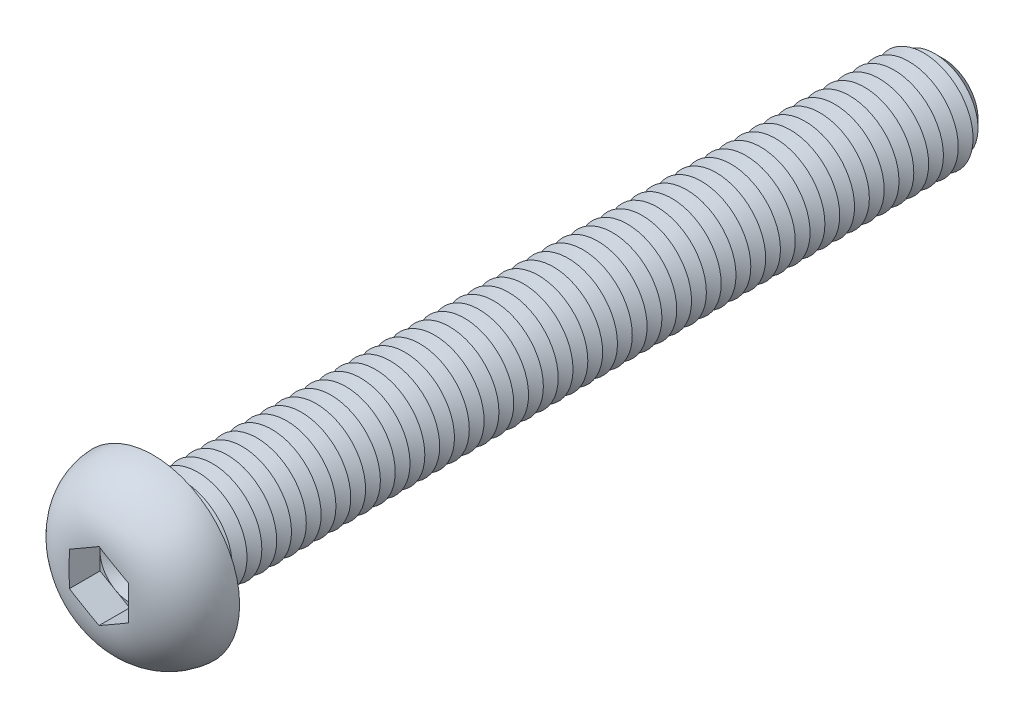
ISO-10303-21;
HEADER;
FILE_DESCRIPTION(('STEP AP214'),'2;1');
FILE_NAME('part.step','',(''),(''),'','','');
FILE_SCHEMA(('AUTOMOTIVE_DESIGN { 1 0 10303 214 1 1 1 1 }'));
ENDSEC;
DATA;
#1=APPLICATION_CONTEXT('core data for automotive mechanical design processes');
#2=APPLICATION_PROTOCOL_DEFINITION('international standard','automotive_design',2000,#1);
#3=PRODUCT_CONTEXT('',#1,'mechanical');
#4=PRODUCT('Part','Part','',(#3));
#5=PRODUCT_RELATED_PRODUCT_CATEGORY('part','',(#4));
#6=PRODUCT_DEFINITION_FORMATION('','',#4);
#7=PRODUCT_DEFINITION_CONTEXT('part definition',#1,'design');
#8=PRODUCT_DEFINITION('design','',#6,#7);
#9=PRODUCT_DEFINITION_SHAPE('','',#8);
#10=(LENGTH_UNIT() NAMED_UNIT(*) SI_UNIT(.MILLI.,.METRE.));
#11=(NAMED_UNIT(*) PLANE_ANGLE_UNIT() SI_UNIT($,.RADIAN.));
#12=(NAMED_UNIT(*) SI_UNIT($,.STERADIAN.) SOLID_ANGLE_UNIT());
#13=UNCERTAINTY_MEASURE_WITH_UNIT(LENGTH_MEASURE(1.E-05),#10,'distance_accuracy_value','');
#14=(GEOMETRIC_REPRESENTATION_CONTEXT(3) GLOBAL_UNCERTAINTY_ASSIGNED_CONTEXT((#13)) GLOBAL_UNIT_ASSIGNED_CONTEXT((#10,
#11,#12)) REPRESENTATION_CONTEXT('',''));
#15=CARTESIAN_POINT('',(0.,0.,0.));
#16=DIRECTION('',(0.,0.,1.));
#17=DIRECTION('',(1.,0.,0.));
#18=AXIS2_PLACEMENT_3D('',#15,#16,#17);
#19=CARTESIAN_POINT('',(0.,0.,2.38));
#20=DIRECTION('',(0.,0.,1.));
#21=DIRECTION('',(1.,0.,0.));
#22=AXIS2_PLACEMENT_3D('',#19,#20,#21);
#23=PLANE('',#22);
#24=CARTESIAN_POINT('',(0.,0.,2.38));
#25=DIRECTION('',(0.,0.,1.));
#26=DIRECTION('',(1.,0.,0.));
#27=AXIS2_PLACEMENT_3D('',#24,#25,#26);
#28=CIRCLE('',#27,3.);
#29=CARTESIAN_POINT('',(3.,0.,2.38));
#30=VERTEX_POINT('',#29);
#31=CARTESIAN_POINT('',(1.5,2.59807621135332,2.38));
#32=VERTEX_POINT('',#31);
#33=EDGE_CURVE('E117',#30,#32,#28,.T.);
#34=ORIENTED_EDGE('',*,*,#33,.F.);
#35=DIRECTION('',(0.,1.,0.));
#36=VECTOR('',#35,1.);
#37=CARTESIAN_POINT('',(3.,-1.73205080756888,2.38));
#38=LINE('',#37,#36);
#39=CARTESIAN_POINT('',(3.,1.73205080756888,2.38));
#40=VERTEX_POINT('',#39);
#41=EDGE_CURVE('E140',#30,#40,#38,.T.);
#42=ORIENTED_EDGE('',*,*,#41,.T.);
#43=DIRECTION('',(-0.866025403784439,0.5,0.));
#44=VECTOR('',#43,1.);
#45=CARTESIAN_POINT('',(3.,1.73205080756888,2.38));
#46=LINE('',#45,#44);
#47=EDGE_CURVE('E136',#40,#32,#46,.T.);
#48=ORIENTED_EDGE('',*,*,#47,.T.);
#49=EDGE_LOOP('',(#34,#42,#48));
#50=FACE_BOUND('',#49,.T.);
#51=ADVANCED_FACE('F39',(#50),#23,.T.);
#52=CARTESIAN_POINT('',(0.,0.,2.38));
#53=DIRECTION('',(0.,0.,1.));
#54=DIRECTION('',(1.,0.,0.));
#55=AXIS2_PLACEMENT_3D('',#52,#53,#54);
#56=CIRCLE('',#55,3.);
#57=CARTESIAN_POINT('',(-1.5,2.59807621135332,2.38));
#58=VERTEX_POINT('',#57);
#59=EDGE_CURVE('E11',#32,#58,#56,.T.);
#60=ORIENTED_EDGE('',*,*,#59,.F.);
#61=CARTESIAN_POINT('',(0.,3.46410161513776,2.38));
#62=VERTEX_POINT('',#61);
#63=EDGE_CURVE('E130',#32,#62,#46,.T.);
#64=ORIENTED_EDGE('',*,*,#63,.T.);
#65=DIRECTION('',(-0.866025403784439,-0.5,0.));
#66=VECTOR('',#65,1.);
#67=CARTESIAN_POINT('',(0.,3.46410161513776,2.38));
#68=LINE('',#67,#66);
#69=EDGE_CURVE('E131',#62,#58,#68,.T.);
#70=ORIENTED_EDGE('',*,*,#69,.T.);
#71=EDGE_LOOP('',(#60,#64,#70));
#72=FACE_BOUND('',#71,.T.);
#73=ADVANCED_FACE('F129',(#72),#23,.T.);
#74=CARTESIAN_POINT('',(-3.,0.,2.38));
#75=VERTEX_POINT('',#74);
#76=EDGE_CURVE('E49',#58,#75,#56,.T.);
#77=ORIENTED_EDGE('',*,*,#76,.F.);
#78=CARTESIAN_POINT('',(-3.,1.73205080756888,2.38));
#79=VERTEX_POINT('',#78);
#80=EDGE_CURVE('E143',#58,#79,#68,.T.);
#81=ORIENTED_EDGE('',*,*,#80,.T.);
#82=DIRECTION('',(0.,-1.,0.));
#83=VECTOR('',#82,1.);
#84=CARTESIAN_POINT('',(-3.,1.73205080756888,2.38));
#85=LINE('',#84,#83);
#86=EDGE_CURVE('E152',#79,#75,#85,.T.);
#87=ORIENTED_EDGE('',*,*,#86,.T.);
#88=EDGE_LOOP('',(#77,#81,#87));
#89=FACE_BOUND('',#88,.T.);
#90=ADVANCED_FACE('F278',(#89),#23,.T.);
#91=CARTESIAN_POINT('',(-1.5,-2.59807621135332,2.38));
#92=VERTEX_POINT('',#91);
#93=EDGE_CURVE('E260',#75,#92,#56,.T.);
#94=ORIENTED_EDGE('',*,*,#93,.F.);
#95=CARTESIAN_POINT('',(-3.,-1.73205080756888,2.38));
#96=VERTEX_POINT('',#95);
#97=EDGE_CURVE('E151',#75,#96,#85,.T.);
#98=ORIENTED_EDGE('',*,*,#97,.T.);
#99=DIRECTION('',(0.866025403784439,-0.5,0.));
#100=VECTOR('',#99,1.);
#101=CARTESIAN_POINT('',(-3.,-1.73205080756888,2.38));
#102=LINE('',#101,#100);
#103=EDGE_CURVE('E157',#96,#92,#102,.T.);
#104=ORIENTED_EDGE('',*,*,#103,.T.);
#105=EDGE_LOOP('',(#94,#98,#104));
#106=FACE_BOUND('',#105,.T.);
#107=ADVANCED_FACE('F272',(#106),#23,.T.);
#108=CARTESIAN_POINT('',(1.5,-2.59807621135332,2.38));
#109=VERTEX_POINT('',#108);
#110=EDGE_CURVE('E56',#92,#109,#56,.T.);
#111=ORIENTED_EDGE('',*,*,#110,.F.);
#112=CARTESIAN_POINT('',(0.,-3.46410161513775,2.38));
#113=VERTEX_POINT('',#112);
#114=EDGE_CURVE('E156',#92,#113,#102,.T.);
#115=ORIENTED_EDGE('',*,*,#114,.T.);
#116=DIRECTION('',(0.866025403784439,0.5,0.));
#117=VECTOR('',#116,1.);
#118=CARTESIAN_POINT('',(0.,-3.46410161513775,2.38));
#119=LINE('',#118,#117);
#120=EDGE_CURVE('E162',#113,#109,#119,.T.);
#121=ORIENTED_EDGE('',*,*,#120,.T.);
#122=EDGE_LOOP('',(#111,#115,#121));
#123=FACE_BOUND('',#122,.T.);
#124=ADVANCED_FACE('F314',(#123),#23,.T.);
#125=CARTESIAN_POINT('',(0.,0.,-80.));
#126=DIRECTION('',(0.,0.,1.));
#127=DIRECTION('',(1.,0.,0.));
#128=AXIS2_PLACEMENT_3D('',#125,#126,#127);
#129=CYLINDRICAL_SURFACE('',#128,5.);
#130=CARTESIAN_POINT('',(0.,0.,-0.600000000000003));
#131=DIRECTION('',(0.,0.,1.));
#132=DIRECTION('',(1.,0.,0.));
#133=AXIS2_PLACEMENT_3D('',#130,#131,#132);
#134=CIRCLE('',#133,5.);
#135=CARTESIAN_POINT('',(5.,0.,-0.600000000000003));
#136=VERTEX_POINT('',#135);
#137=EDGE_CURVE('E241',#136,#136,#134,.F.);
#138=ORIENTED_EDGE('',*,*,#137,.T.);
#139=EDGE_LOOP('',(#138));
#140=FACE_BOUND('',#139,.T.);
#141=CARTESIAN_POINT('',(0.,0.,-1.5));
#142=DIRECTION('',(0.,0.,1.));
#143=DIRECTION('',(1.,0.,0.));
#144=AXIS2_PLACEMENT_3D('',#141,#142,#143);
#145=CIRCLE('',#144,5.00000000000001);
#146=CARTESIAN_POINT('',(5.00000000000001,0.,-1.5));
#147=VERTEX_POINT('',#146);
#148=EDGE_CURVE('E138',#147,#147,#145,.T.);
#149=ORIENTED_EDGE('',*,*,#148,.T.);
#150=EDGE_LOOP('',(#149));
#151=FACE_BOUND('',#150,.T.);
#152=ADVANCED_FACE('F315',(#140,#151),#129,.T.);
#153=CARTESIAN_POINT('',(0.,8.75,0.));
#154=DIRECTION('',(0.,0.,1.));
#155=DIRECTION('',(1.,0.,0.));
#156=AXIS2_PLACEMENT_3D('',#153,#154,#155);
#157=PLANE('',#156);
#158=CARTESIAN_POINT('',(0.,0.,0.));
#159=DIRECTION('',(0.,0.,1.));
#160=DIRECTION('',(1.,0.,0.));
#161=AXIS2_PLACEMENT_3D('',#158,#159,#160);
#162=CIRCLE('',#161,5.6);
#163=CARTESIAN_POINT('',(5.6,0.,0.));
#164=VERTEX_POINT('',#163);
#165=EDGE_CURVE('E250',#164,#164,#162,.T.);
#166=ORIENTED_EDGE('',*,*,#165,.T.);
#167=EDGE_LOOP('',(#166));
#168=FACE_BOUND('',#167,.T.);
#169=CARTESIAN_POINT('',(0.,0.,0.));
#170=DIRECTION('',(0.,0.,1.));
#171=DIRECTION('',(1.,0.,0.));
#172=AXIS2_PLACEMENT_3D('',#169,#170,#171);
#173=CIRCLE('',#172,8.75);
#174=CARTESIAN_POINT('',(8.75,0.,0.));
#175=VERTEX_POINT('',#174);
#176=EDGE_CURVE('E173',#175,#175,#173,.T.);
#177=ORIENTED_EDGE('',*,*,#176,.F.);
#178=EDGE_LOOP('',(#177));
#179=FACE_BOUND('',#178,.T.);
#180=ADVANCED_FACE('F318',(#168,#179),#157,.F.);
#181=CARTESIAN_POINT('',(0.,0.,-0.3));
#182=DIRECTION('',(0.,0.,1.));
#183=DIRECTION('',(1.,0.,0.));
#184=AXIS2_PLACEMENT_3D('',#181,#182,#183);
#185=DEGENERATE_TOROIDAL_SURFACE('',#184,2.95776381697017,5.8,.T.);
#186=CARTESIAN_POINT('',(-3.0002,1.73193533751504,5.47784605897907));
#187=CARTESIAN_POINT('',(-2.87524340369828,1.80407906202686,5.4841525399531));
#188=CARTESIAN_POINT('',(-2.75023731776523,1.87625135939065,5.48853670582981));
#189=CARTESIAN_POINT('',(-2.5001955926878,2.02061301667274,5.49472046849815));
#190=CARTESIAN_POINT('',(-2.37515996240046,2.09280237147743,5.49652051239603));
#191=CARTESIAN_POINT('',(-2.12510741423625,2.23717027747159,5.4987972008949));
#192=CARTESIAN_POINT('',(-2.00009049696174,2.30934882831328,5.49927407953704));
#193=CARTESIAN_POINT('',(-1.75004905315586,2.45371032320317,5.49979859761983));
#194=CARTESIAN_POINT('',(-1.62502452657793,2.52589326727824,5.49984621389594));
#195=CARTESIAN_POINT('',(-1.37497547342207,2.67025915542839,5.49984621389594));
#196=CARTESIAN_POINT('',(-1.24995094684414,2.74244209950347,5.49979859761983));
#197=CARTESIAN_POINT('',(-0.999909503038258,2.88680359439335,5.49927407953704));
#198=CARTESIAN_POINT('',(-0.874892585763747,2.95898214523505,5.4987972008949));
#199=CARTESIAN_POINT('',(-0.624840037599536,3.10335005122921,5.49652051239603));
#200=CARTESIAN_POINT('',(-0.4998044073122,3.1755394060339,5.49472046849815));
#201=CARTESIAN_POINT('',(-0.249762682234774,3.31990106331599,5.48853670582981));
#202=CARTESIAN_POINT('',(-0.124756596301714,3.39207336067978,5.4841525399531));
#203=CARTESIAN_POINT('',(0.00020000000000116,3.46421708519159,5.47784605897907));
#204=B_SPLINE_CURVE_WITH_KNOTS('',3,(#186,#187,#188,#189,#190,#191,#192,#193,#194,#195,#196,
#197,#198,#199,#200,#201,#202,#203),.UNSPECIFIED.,.F.,.F.,(4,2,2,2,2,2,2,2,4),(0.,
0.433225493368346,0.866376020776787,1.29944992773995,1.73254720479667,2.16564448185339,
2.59871838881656,3.031868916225,3.46509440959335),.UNSPECIFIED.);
#205=CARTESIAN_POINT('',(-3.,1.73205080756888,5.4778561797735));
#206=VERTEX_POINT('',#205);
#207=CARTESIAN_POINT('',(0.,3.46410161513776,5.4778561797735));
#208=VERTEX_POINT('',#207);
#209=EDGE_CURVE('E195',#206,#208,#204,.T.);
#210=ORIENTED_EDGE('',*,*,#209,.T.);
#211=CARTESIAN_POINT('',(-0.000200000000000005,3.46421708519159,5.47784605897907));
#212=CARTESIAN_POINT('',(0.124756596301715,3.39207336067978,5.4841525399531));
#213=CARTESIAN_POINT('',(0.249762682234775,3.31990106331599,5.48853670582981));
#214=CARTESIAN_POINT('',(0.4998044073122,3.1755394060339,5.49472046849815));
#215=CARTESIAN_POINT('',(0.624840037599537,3.10335005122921,5.49652051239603));
#216=CARTESIAN_POINT('',(0.874892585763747,2.95898214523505,5.4987972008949));
#217=CARTESIAN_POINT('',(0.999909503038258,2.88680359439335,5.49927407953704));
#218=CARTESIAN_POINT('',(1.24995094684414,2.74244209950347,5.49979859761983));
#219=CARTESIAN_POINT('',(1.37497547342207,2.67025915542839,5.49984621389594));
#220=CARTESIAN_POINT('',(1.62502452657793,2.52589326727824,5.49984621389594));
#221=CARTESIAN_POINT('',(1.75004905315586,2.45371032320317,5.49979859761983));
#222=CARTESIAN_POINT('',(2.00009049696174,2.30934882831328,5.49927407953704));
#223=CARTESIAN_POINT('',(2.12510741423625,2.23717027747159,5.4987972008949));
#224=CARTESIAN_POINT('',(2.37515996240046,2.09280237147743,5.49652051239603));
#225=CARTESIAN_POINT('',(2.5001955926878,2.02061301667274,5.49472046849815));
#226=CARTESIAN_POINT('',(2.75023731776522,1.87625135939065,5.48853670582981));
#227=CARTESIAN_POINT('',(2.87524340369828,1.80407906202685,5.4841525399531));
#228=CARTESIAN_POINT('',(3.0002,1.73193533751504,5.47784605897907));
#229=B_SPLINE_CURVE_WITH_KNOTS('',3,(#211,#212,#213,#214,#215,#216,#217,#218,#219,#220,#221,
#222,#223,#224,#225,#226,#227,#228),.UNSPECIFIED.,.F.,.F.,(4,2,2,2,2,2,2,2,4),(0.,
0.433225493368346,0.866376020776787,1.29944992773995,1.73254720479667,2.16564448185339,
2.59871838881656,3.031868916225,3.46509440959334),.UNSPECIFIED.);
#230=CARTESIAN_POINT('',(3.,1.73205080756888,5.47785617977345));
#231=VERTEX_POINT('',#230);
#232=EDGE_CURVE('E224',#208,#231,#229,.T.);
#233=ORIENTED_EDGE('',*,*,#232,.T.);
#234=CARTESIAN_POINT('',(3.,0.,5.49984621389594));
#235=CARTESIAN_POINT('',(3.,-0.125570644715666,5.49984449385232));
#236=CARTESIAN_POINT('',(3.,-0.251141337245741,5.49980426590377));
#237=CARTESIAN_POINT('',(3.,-0.502283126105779,5.499449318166));
#238=CARTESIAN_POINT('',(3.,-0.62785422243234,5.49913459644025));
#239=CARTESIAN_POINT('',(3.,-0.879037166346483,5.49770394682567));
#240=CARTESIAN_POINT('',(3.,-1.00464901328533,5.49658774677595));
#241=CARTESIAN_POINT('',(3.,-1.2558477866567,5.49279605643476));
#242=CARTESIAN_POINT('',(3.,-1.3814347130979,5.49012056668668));
#243=CARTESIAN_POINT('',(3.,-1.7568847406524,5.47847778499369));
#244=CARTESIAN_POINT('',(3.,-2.00667103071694,5.46590367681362));
#245=CARTESIAN_POINT('',(3.,-2.50488375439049,5.42441448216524));
#246=CARTESIAN_POINT('',(3.,-2.75331093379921,5.3955095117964));
#247=CARTESIAN_POINT('',(3.,-3.18719021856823,5.32582626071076));
#248=CARTESIAN_POINT('',(3.,-3.3733635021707,5.28960049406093));
#249=CARTESIAN_POINT('',(3.,-3.74245496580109,5.20330651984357));
#250=CARTESIAN_POINT('',(3.,-3.92537417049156,5.15324275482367));
#251=CARTESIAN_POINT('',(3.,-4.28675502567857,5.03819885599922));
#252=CARTESIAN_POINT('',(3.,-4.46521058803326,4.97319946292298));
#253=CARTESIAN_POINT('',(3.,-4.81576789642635,4.82782766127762));
#254=CARTESIAN_POINT('',(3.,-4.98786985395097,4.74745576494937));
#255=CARTESIAN_POINT('',(3.,-5.3254008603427,4.5705398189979));
#256=CARTESIAN_POINT('',(3.,-5.49076268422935,4.47386710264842));
#257=CARTESIAN_POINT('',(3.,-5.81151175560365,4.26514040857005));
#258=CARTESIAN_POINT('',(3.,-5.96689840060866,4.15308550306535));
#259=CARTESIAN_POINT('',(3.,-6.26591787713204,3.91428862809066));
#260=CARTESIAN_POINT('',(3.,-6.40955257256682,3.78754899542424));
#261=CARTESIAN_POINT('',(3.,-6.68342295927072,3.52034797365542));
#262=CARTESIAN_POINT('',(3.,-6.81366070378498,3.37988869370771));
#263=CARTESIAN_POINT('',(3.,-7.0426666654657,3.10626157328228));
#264=CARTESIAN_POINT('',(3.,-7.14331093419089,2.97465879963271));
#265=CARTESIAN_POINT('',(3.,-7.33253056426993,2.70304716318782));
#266=CARTESIAN_POINT('',(3.,-7.42110686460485,2.56303895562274));
#267=CARTESIAN_POINT('',(3.,-7.58534868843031,2.27573732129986));
#268=CARTESIAN_POINT('',(3.,-7.66102067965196,2.12844759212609));
#269=CARTESIAN_POINT('',(3.,-7.79881901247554,1.82765987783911));
#270=CARTESIAN_POINT('',(3.,-7.86094563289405,1.67416202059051));
#271=CARTESIAN_POINT('',(3.,-7.96803488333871,1.37082076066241));
#272=CARTESIAN_POINT('',(3.,-8.0137568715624,1.22124490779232));
#273=CARTESIAN_POINT('',(3.,-8.09224398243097,0.918674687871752));
#274=CARTESIAN_POINT('',(3.,-8.12500479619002,0.765679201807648));
#275=CARTESIAN_POINT('',(3.,-8.17726457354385,0.457507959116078));
#276=CARTESIAN_POINT('',(3.,-8.1967692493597,0.302333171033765));
#277=CARTESIAN_POINT('',(3.,-8.22238322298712,-0.00917738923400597));
#278=CARTESIAN_POINT('',(3.,-8.22848754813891,-0.165513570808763));
#279=CARTESIAN_POINT('',(3.,-8.22724693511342,-0.475358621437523));
#280=CARTESIAN_POINT('',(3.,-8.2201384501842,-0.62886849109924));
#281=CARTESIAN_POINT('',(3.,-8.1929851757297,-0.934809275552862));
#282=CARTESIAN_POINT('',(3.,-8.17293462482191,-1.08723967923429));
#283=CARTESIAN_POINT('',(3.,-8.1200547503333,-1.38984943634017));
#284=CARTESIAN_POINT('',(3.,-8.08722683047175,-1.54002903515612));
#285=CARTESIAN_POINT('',(3.,-8.0090712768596,-1.83702738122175));
#286=CARTESIAN_POINT('',(3.,-7.96374919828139,-1.98384759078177));
#287=CARTESIAN_POINT('',(3.,-7.86096457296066,-2.27315566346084));
#288=CARTESIAN_POINT('',(3.,-7.80350334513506,-2.41564399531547));
#289=CARTESIAN_POINT('',(3.,-7.67691451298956,-2.69527705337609));
#290=CARTESIAN_POINT('',(3.,-7.60779108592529,-2.83242367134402));
#291=CARTESIAN_POINT('',(3.,-7.45837210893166,-3.10056990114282));
#292=CARTESIAN_POINT('',(3.,-7.37807144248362,-3.23156666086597));
#293=CARTESIAN_POINT('',(3.,-7.20697634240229,-3.48645411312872));
#294=CARTESIAN_POINT('',(3.,-7.11618520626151,-3.61034702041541));
#295=CARTESIAN_POINT('',(3.,-6.92334779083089,-3.85210954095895));
#296=CARTESIAN_POINT('',(3.,-6.82115263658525,-3.96986038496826));
#297=CARTESIAN_POINT('',(3.,-6.60745266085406,-4.19658717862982));
#298=CARTESIAN_POINT('',(3.,-6.49594754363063,-4.30556284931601));
#299=CARTESIAN_POINT('',(3.,-6.26450055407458,-4.51413072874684));
#300=CARTESIAN_POINT('',(3.,-6.14455919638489,-4.61372350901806));
#301=CARTESIAN_POINT('',(3.,-5.8971402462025,-4.80306090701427));
#302=CARTESIAN_POINT('',(3.,-5.76966228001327,-4.89280503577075));
#303=CARTESIAN_POINT('',(3.,-5.50268934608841,-5.06561354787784));
#304=CARTESIAN_POINT('',(3.,-5.36291526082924,-5.14824654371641));
#305=CARTESIAN_POINT('',(3.,-5.07726499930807,-5.30226841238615));
#306=CARTESIAN_POINT('',(3.,-4.93138704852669,-5.37365398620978));
#307=CARTESIAN_POINT('',(3.,-4.63484455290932,-5.50505544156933));
#308=CARTESIAN_POINT('',(3.,-4.48418671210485,-5.56508649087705));
#309=CARTESIAN_POINT('',(3.,-4.17906596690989,-5.6740700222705));
#310=CARTESIAN_POINT('',(3.,-4.02460600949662,-5.72303080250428));
#311=CARTESIAN_POINT('',(3.,-3.67392478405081,-5.82125760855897));
#312=CARTESIAN_POINT('',(3.,-3.47687521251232,-5.86756841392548));
#313=CARTESIAN_POINT('',(3.,-3.07981530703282,-5.94521593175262));
#314=CARTESIAN_POINT('',(3.,-2.87980357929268,-5.97654534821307));
#315=CARTESIAN_POINT('',(3.,-2.47751859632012,-6.02656554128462));
#316=CARTESIAN_POINT('',(3.,-2.27523974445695,-6.0452096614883));
#317=CARTESIAN_POINT('',(3.,-1.87007862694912,-6.07274849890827));
#318=CARTESIAN_POINT('',(3.,-1.66719636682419,-6.08164330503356));
#319=CARTESIAN_POINT('',(3.,-1.25887867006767,-6.09343726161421));
#320=CARTESIAN_POINT('',(3.,-1.0534415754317,-6.09626381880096));
#321=CARTESIAN_POINT('',(3.,-0.745285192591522,-6.0985660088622));
#322=CARTESIAN_POINT('',(3.,-0.642567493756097,-6.09901047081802));
#323=CARTESIAN_POINT('',(3.,-0.43713103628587,-6.09957976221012));
#324=CARTESIAN_POINT('',(3.,-0.334412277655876,-6.09970459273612));
#325=CARTESIAN_POINT('',(3.,-0.12913213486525,-6.09984385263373));
#326=CARTESIAN_POINT('',(3.,-0.0265707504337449,-6.09985845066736));
#327=CARTESIAN_POINT('',(3.,0.178552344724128,-6.09981980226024));
#328=CARTESIAN_POINT('',(3.,0.281114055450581,-6.09976655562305));
#329=CARTESIAN_POINT('',(3.,0.486235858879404,-6.09946703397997));
#330=CARTESIAN_POINT('',(3.,0.588795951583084,-6.0992207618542));
#331=CARTESIAN_POINT('',(3.,0.793913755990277,-6.09826017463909));
#332=CARTESIAN_POINT('',(3.,0.896471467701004,-6.097545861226));
#333=CARTESIAN_POINT('',(3.,1.11088851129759,-6.0951586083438));
#334=CARTESIAN_POINT('',(3.,1.2227471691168,-6.0934045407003));
#335=CARTESIAN_POINT('',(3.,1.44642575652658,-6.08829151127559));
#336=CARTESIAN_POINT('',(3.,1.55824568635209,-6.08493255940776));
#337=CARTESIAN_POINT('',(3.,1.89360474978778,-6.07150074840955));
#338=CARTESIAN_POINT('',(3.,2.11703989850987,-6.05807293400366));
#339=CARTESIAN_POINT('',(3.,2.56083256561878,-6.01778675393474));
#340=CARTESIAN_POINT('',(3.,2.78120000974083,-5.99104517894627));
#341=CARTESIAN_POINT('',(3.,3.21928669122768,-5.92065658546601));
#342=CARTESIAN_POINT('',(3.,3.43700630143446,-5.8770119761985));
#343=CARTESIAN_POINT('',(3.,3.82666678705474,-5.78060449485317));
#344=CARTESIAN_POINT('',(3.,3.99942726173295,-5.73116262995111));
#345=CARTESIAN_POINT('',(3.,4.34055676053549,-5.61888897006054));
#346=CARTESIAN_POINT('',(3.,4.50892617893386,-5.55605838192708));
#347=CARTESIAN_POINT('',(3.,4.84049143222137,-5.41635874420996));
#348=CARTESIAN_POINT('',(3.,5.00366586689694,-5.33943871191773));
#349=CARTESIAN_POINT('',(3.,5.32271829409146,-5.17167128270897));
#350=CARTESIAN_POINT('',(3.,5.47859600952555,-5.08082335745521));
#351=CARTESIAN_POINT('',(3.,5.78228295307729,-4.88500135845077));
#352=CARTESIAN_POINT('',(3.,5.9300501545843,-4.77996197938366));
#353=CARTESIAN_POINT('',(3.,6.21523046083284,-4.55663689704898));
#354=CARTESIAN_POINT('',(3.,6.35264336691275,-4.43835093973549));
#355=CARTESIAN_POINT('',(3.,6.61552762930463,-4.18948618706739));
#356=CARTESIAN_POINT('',(3.,6.74101380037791,-4.0589230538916));
#357=CARTESIAN_POINT('',(3.,6.97891308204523,-3.78639059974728));
#358=CARTESIAN_POINT('',(3.,7.09132750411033,-3.64442242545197));
#359=CARTESIAN_POINT('',(3.,7.29113623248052,-3.36530209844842));
#360=CARTESIAN_POINT('',(3.,7.37991316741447,-3.22913733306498));
#361=CARTESIAN_POINT('',(3.,7.54519682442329,-2.94955428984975));
#362=CARTESIAN_POINT('',(3.,7.62170419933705,-2.80613639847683));
#363=CARTESIAN_POINT('',(3.,7.76177641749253,-2.51311689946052));
#364=CARTESIAN_POINT('',(3.,7.82534152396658,-2.36351541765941));
#365=CARTESIAN_POINT('',(3.,7.93897019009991,-2.05926799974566));
#366=CARTESIAN_POINT('',(3.,7.98903395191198,-1.90462213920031));
#367=CARTESIAN_POINT('',(3.,8.07336540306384,-1.59821781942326));
#368=CARTESIAN_POINT('',(3.,8.10821878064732,-1.44662026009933));
#369=CARTESIAN_POINT('',(3.,8.16487862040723,-1.14095089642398));
#370=CARTESIAN_POINT('',(3.,8.18668070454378,-0.986878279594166));
#371=CARTESIAN_POINT('',(3.,8.21703234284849,-0.677515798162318));
#372=CARTESIAN_POINT('',(3.,8.22558889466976,-0.522226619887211));
#373=CARTESIAN_POINT('',(3.,8.22940229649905,-0.211427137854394));
#374=CARTESIAN_POINT('',(3.,8.22465425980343,-0.0559167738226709));
#375=CARTESIAN_POINT('',(3.,8.20204101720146,0.252033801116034));
#376=CARTESIAN_POINT('',(3.,8.18435378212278,0.404487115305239));
#377=CARTESIAN_POINT('',(3.,8.136196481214,0.707418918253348));
#378=CARTESIAN_POINT('',(3.,8.10572170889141,0.857896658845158));
#379=CARTESIAN_POINT('',(3.,8.03224632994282,1.15569567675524));
#380=CARTESIAN_POINT('',(3.,7.9892508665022,1.30301822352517));
#381=CARTESIAN_POINT('',(3.,7.89104818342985,1.59360769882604));
#382=CARTESIAN_POINT('',(3.,7.83583549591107,1.73687277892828));
#383=CARTESIAN_POINT('',(3.,7.7134949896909,2.01864020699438));
#384=CARTESIAN_POINT('',(3.,7.64633814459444,2.15712994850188));
#385=CARTESIAN_POINT('',(3.,7.50076383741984,2.42797950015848));
#386=CARTESIAN_POINT('',(3.,7.42235122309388,2.56034191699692));
#387=CARTESIAN_POINT('',(3.,7.2548328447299,2.81817153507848));
#388=CARTESIAN_POINT('',(3.,7.16572386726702,2.94363664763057));
#389=CARTESIAN_POINT('',(3.,6.97755598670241,3.18679794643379));
#390=CARTESIAN_POINT('',(3.,6.87850037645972,3.3044966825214));
#391=CARTESIAN_POINT('',(3.,6.6691974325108,3.5336364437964));
#392=CARTESIAN_POINT('',(3.,6.55877281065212,3.64491549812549));
#393=CARTESIAN_POINT('',(3.,6.32925753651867,3.85806320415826));
#394=CARTESIAN_POINT('',(3.,6.21016952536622,3.95993470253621));
#395=CARTESIAN_POINT('',(3.,5.96413069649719,4.15386505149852));
#396=CARTESIAN_POINT('',(3.,5.83717459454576,4.24591719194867));
#397=CARTESIAN_POINT('',(3.,5.57646530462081,4.41973423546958));
#398=CARTESIAN_POINT('',(3.,5.44271394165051,4.50150188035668));
#399=CARTESIAN_POINT('',(3.,5.16249709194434,4.65840017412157));
#400=CARTESIAN_POINT('',(3.,5.01573037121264,4.73299250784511));
#401=CARTESIAN_POINT('',(3.,4.71685583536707,4.87057528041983));
#402=CARTESIAN_POINT('',(3.,4.56474751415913,4.93356461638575));
#403=CARTESIAN_POINT('',(3.,4.25657035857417,5.04801407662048));
#404=CARTESIAN_POINT('',(3.,4.10050882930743,5.09949395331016));
#405=CARTESIAN_POINT('',(3.,3.7852328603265,5.19149003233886));
#406=CARTESIAN_POINT('',(3.,3.62601895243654,5.23200806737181));
#407=CARTESIAN_POINT('',(3.,3.32461902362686,5.29856444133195));
#408=CARTESIAN_POINT('',(3.,3.18268434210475,5.32575733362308));
#409=CARTESIAN_POINT('',(3.,2.89760844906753,5.3729307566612));
#410=CARTESIAN_POINT('',(3.,2.75446703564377,5.39291005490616));
#411=CARTESIAN_POINT('',(3.,2.46730946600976,5.42656527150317));
#412=CARTESIAN_POINT('',(3.,2.32329255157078,5.44023457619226));
#413=CARTESIAN_POINT('',(3.,2.03487642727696,5.46234228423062));
#414=CARTESIAN_POINT('',(3.,1.89047722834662,5.4707808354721));
#415=CARTESIAN_POINT('',(3.,1.60058090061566,5.48373897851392));
#416=CARTESIAN_POINT('',(3.,1.45508270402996,5.48823290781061));
#417=CARTESIAN_POINT('',(3.,1.1640267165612,5.49458098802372));
#418=CARTESIAN_POINT('',(3.,1.01846892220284,5.49643495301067));
#419=CARTESIAN_POINT('',(3.,0.727424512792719,5.49877506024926));
#420=CARTESIAN_POINT('',(3.,0.581937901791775,5.49926194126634));
#421=CARTESIAN_POINT('',(3.,0.290967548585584,5.49979850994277));
#422=CARTESIAN_POINT('',(3.,0.145483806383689,5.49984820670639));
#423=CARTESIAN_POINT('',(3.,0.,5.49984621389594));
#424=B_SPLINE_CURVE_WITH_KNOTS('',3,(#234,#235,#236,#237,#238,#239,#240,#241,#242,#243,#244,
#245,#246,#247,#248,#249,#250,#251,#252,#253,#254,#255,#256,#257,#258,#259,#260,#261,#262,#263,
#264,#265,#266,#267,#268,#269,#270,#271,#272,#273,#274,#275,#276,#277,#278,#279,#280,#281,#282,
#283,#284,#285,#286,#287,#288,#289,#290,#291,#292,#293,#294,#295,#296,#297,#298,#299,#300,#301,
#302,#303,#304,#305,#306,#307,#308,#309,#310,#311,#312,#313,#314,#315,#316,#317,#318,#319,#320,
#321,#322,#323,#324,#325,#326,#327,#328,#329,#330,#331,#332,#333,#334,#335,#336,#337,#338,#339,
#340,#341,#342,#343,#344,#345,#346,#347,#348,#349,#350,#351,#352,#353,#354,#355,#356,#357,#358,
#359,#360,#361,#362,#363,#364,#365,#366,#367,#368,#369,#370,#371,#372,#373,#374,#375,#376,#377,
#378,#379,#380,#381,#382,#383,#384,#385,#386,#387,#388,#389,#390,#391,#392,#393,#394,#395,#396,
#397,#398,#399,#400,#401,#402,#403,#404,#405,#406,#407,#408,#409,#410,#411,#412,#413,#414,#415,
#416,#417,#418,#419,#420,#421,#422,#423),.UNSPECIFIED.,.T.,.F.,(4,2,2,2,2,2,2,2,2,2,2,2,2,2,2,2,
2,2,2,2,2,2,2,2,2,2,2,2,2,2,2,2,2,2,2,2,2,2,2,2,2,2,2,2,2,2,2,2,2,2,2,2,2,2,2,2,2,2,2,2,2,2,2,2,
2,2,2,2,2,2,2,2,2,2,2,2,2,2,2,2,2,2,2,2,2,2,2,2,2,2,2,2,2,2,4),(0.,0.376711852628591,
0.753426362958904,1.13026885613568,1.50711121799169,2.257095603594,3.00661592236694,
3.57514719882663,4.14349616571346,4.71258216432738,5.28164920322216,5.85543852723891,
6.42926247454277,7.00299523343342,7.57663992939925,8.07303876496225,8.56939895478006,
9.06550962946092,9.56161009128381,10.030267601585,10.4990807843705,10.9676918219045,
11.4364767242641,11.8969530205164,12.3576344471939,12.8182652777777,13.2786916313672,
13.7390679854,14.1992797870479,14.6597029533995,15.1199817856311,15.5871904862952,
16.0544140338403,16.5216091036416,16.9888273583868,17.4754224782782,17.9621600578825,
18.4482427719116,18.9339599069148,19.5405320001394,20.1473991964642,20.7564865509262,
21.3655683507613,21.9818967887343,22.2900536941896,22.5982095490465,22.905893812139,
23.2135789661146,23.5212595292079,23.8289389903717,24.1645461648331,24.5001512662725,
25.171371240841,25.8368042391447,26.5021424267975,27.0407309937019,27.5792710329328,
28.1197997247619,28.6603489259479,29.2034761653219,29.7466138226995,30.2890677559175,
30.831467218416,31.3185063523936,31.8055195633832,32.2925228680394,32.779518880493,
33.2456153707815,33.711868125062,34.1778744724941,34.6440520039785,35.103935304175,
35.563988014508,36.0238520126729,36.4839222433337,36.9451261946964,37.4061321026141,
37.8672768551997,38.3282694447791,38.7980460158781,39.2676799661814,39.7376328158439,
40.207460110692,40.7008436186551,41.194273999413,41.6868509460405,42.1793454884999,
42.6126940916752,43.0461167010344,43.479992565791,43.9138561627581,44.3505218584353,
44.7872183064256,45.2236787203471,45.6601300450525),.UNSPECIFIED.);
#425=CARTESIAN_POINT('',(3.,-1.73205080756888,5.4778561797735));
#426=VERTEX_POINT('',#425);
#427=EDGE_CURVE('E233',#231,#426,#424,.T.);
#428=ORIENTED_EDGE('',*,*,#427,.T.);
#429=CARTESIAN_POINT('',(3.0002,-1.73193533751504,5.47784605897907));
#430=CARTESIAN_POINT('',(2.87524340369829,-1.80407906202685,5.4841525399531));
#431=CARTESIAN_POINT('',(2.75023731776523,-1.87625135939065,5.48853670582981));
#432=CARTESIAN_POINT('',(2.5001955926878,-2.02061301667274,5.49472046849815));
#433=CARTESIAN_POINT('',(2.37515996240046,-2.09280237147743,5.49652051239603));
#434=CARTESIAN_POINT('',(2.12510741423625,-2.23717027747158,5.4987972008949));
#435=CARTESIAN_POINT('',(2.00009049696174,-2.30934882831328,5.49927407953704));
#436=CARTESIAN_POINT('',(1.75004905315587,-2.45371032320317,5.49979859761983));
#437=CARTESIAN_POINT('',(1.62502452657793,-2.52589326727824,5.49984621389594));
#438=CARTESIAN_POINT('',(1.37497547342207,-2.67025915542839,5.49984621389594));
#439=CARTESIAN_POINT('',(1.24995094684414,-2.74244209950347,5.49979859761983));
#440=CARTESIAN_POINT('',(0.999909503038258,-2.88680359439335,5.49927407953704));
#441=CARTESIAN_POINT('',(0.874892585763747,-2.95898214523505,5.4987972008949));
#442=CARTESIAN_POINT('',(0.624840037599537,-3.10335005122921,5.49652051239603));
#443=CARTESIAN_POINT('',(0.4998044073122,-3.17553940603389,5.49472046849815));
#444=CARTESIAN_POINT('',(0.249762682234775,-3.31990106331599,5.48853670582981));
#445=CARTESIAN_POINT('',(0.124756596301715,-3.39207336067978,5.4841525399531));
#446=CARTESIAN_POINT('',(-0.000200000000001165,-3.46421708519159,5.47784605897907));
#447=B_SPLINE_CURVE_WITH_KNOTS('',3,(#429,#430,#431,#432,#433,#434,#435,#436,#437,#438,#439,
#440,#441,#442,#443,#444,#445,#446),.UNSPECIFIED.,.F.,.F.,(4,2,2,2,2,2,2,2,4),(0.,
0.433225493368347,0.866376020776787,1.29944992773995,1.73254720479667,2.16564448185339,
2.59871838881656,3.031868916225,3.46509440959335),.UNSPECIFIED.);
#448=CARTESIAN_POINT('',(0.,-3.46410161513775,5.4778561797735));
#449=VERTEX_POINT('',#448);
#450=EDGE_CURVE('E288',#426,#449,#447,.T.);
#451=ORIENTED_EDGE('',*,*,#450,.T.);
#452=CARTESIAN_POINT('',(0.000199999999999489,-3.46421708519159,5.47784605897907));
#453=CARTESIAN_POINT('',(-0.124756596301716,-3.39207336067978,5.4841525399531));
#454=CARTESIAN_POINT('',(-0.249762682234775,-3.31990106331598,5.48853670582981));
#455=CARTESIAN_POINT('',(-0.499804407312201,-3.17553940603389,5.49472046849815));
#456=CARTESIAN_POINT('',(-0.624840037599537,-3.10335005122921,5.49652051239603));
#457=CARTESIAN_POINT('',(-0.874892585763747,-2.95898214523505,5.4987972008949));
#458=CARTESIAN_POINT('',(-0.999909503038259,-2.88680359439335,5.49927407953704));
#459=CARTESIAN_POINT('',(-1.24995094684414,-2.74244209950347,5.49979859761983));
#460=CARTESIAN_POINT('',(-1.37497547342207,-2.67025915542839,5.49984621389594));
#461=CARTESIAN_POINT('',(-1.62502452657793,-2.52589326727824,5.49984621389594));
#462=CARTESIAN_POINT('',(-1.75004905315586,-2.45371032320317,5.49979859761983));
#463=CARTESIAN_POINT('',(-2.00009049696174,-2.30934882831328,5.49927407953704));
#464=CARTESIAN_POINT('',(-2.12510741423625,-2.23717027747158,5.4987972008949));
#465=CARTESIAN_POINT('',(-2.37515996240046,-2.09280237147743,5.49652051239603));
#466=CARTESIAN_POINT('',(-2.5001955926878,-2.02061301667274,5.49472046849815));
#467=CARTESIAN_POINT('',(-2.75023731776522,-1.87625135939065,5.48853670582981));
#468=CARTESIAN_POINT('',(-2.87524340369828,-1.80407906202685,5.4841525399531));
#469=CARTESIAN_POINT('',(-3.0002,-1.73193533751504,5.47784605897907));
#470=B_SPLINE_CURVE_WITH_KNOTS('',3,(#452,#453,#454,#455,#456,#457,#458,#459,#460,#461,#462,
#463,#464,#465,#466,#467,#468,#469),.UNSPECIFIED.,.F.,.F.,(4,2,2,2,2,2,2,2,4),(0.,
0.433225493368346,0.866376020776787,1.29944992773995,1.73254720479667,2.16564448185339,
2.59871838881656,3.031868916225,3.46509440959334),.UNSPECIFIED.);
#471=CARTESIAN_POINT('',(-3.,-1.73205080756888,5.47785617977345));
#472=VERTEX_POINT('',#471);
#473=EDGE_CURVE('E285',#449,#472,#470,.T.);
#474=ORIENTED_EDGE('',*,*,#473,.T.);
#475=CARTESIAN_POINT('',(-3.,0.,5.49984621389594));
#476=CARTESIAN_POINT('',(-3.,0.125570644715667,5.49984449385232));
#477=CARTESIAN_POINT('',(-3.,0.251141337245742,5.49980426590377));
#478=CARTESIAN_POINT('',(-3.,0.50228312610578,5.499449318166));
#479=CARTESIAN_POINT('',(-3.,0.627854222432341,5.49913459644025));
#480=CARTESIAN_POINT('',(-3.,0.879037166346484,5.49770394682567));
#481=CARTESIAN_POINT('',(-3.,1.00464901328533,5.49658774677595));
#482=CARTESIAN_POINT('',(-3.,1.2558477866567,5.49279605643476));
#483=CARTESIAN_POINT('',(-3.,1.3814347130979,5.49012056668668));
#484=CARTESIAN_POINT('',(-3.,1.7568847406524,5.47847778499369));
#485=CARTESIAN_POINT('',(-3.,2.00667103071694,5.46590367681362));
#486=CARTESIAN_POINT('',(-3.,2.50488375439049,5.42441448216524));
#487=CARTESIAN_POINT('',(-3.,2.75331093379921,5.3955095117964));
#488=CARTESIAN_POINT('',(-3.,3.18719021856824,5.32582626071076));
#489=CARTESIAN_POINT('',(-3.,3.3733635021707,5.28960049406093));
#490=CARTESIAN_POINT('',(-3.,3.74245496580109,5.20330651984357));
#491=CARTESIAN_POINT('',(-3.,3.92537417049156,5.15324275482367));
#492=CARTESIAN_POINT('',(-3.,4.28675502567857,5.03819885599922));
#493=CARTESIAN_POINT('',(-3.,4.46521058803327,4.97319946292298));
#494=CARTESIAN_POINT('',(-3.,4.81576789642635,4.82782766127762));
#495=CARTESIAN_POINT('',(-3.,4.98786985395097,4.74745576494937));
#496=CARTESIAN_POINT('',(-3.,5.3254008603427,4.5705398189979));
#497=CARTESIAN_POINT('',(-3.,5.49076268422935,4.47386710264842));
#498=CARTESIAN_POINT('',(-3.,5.81151175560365,4.26514040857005));
#499=CARTESIAN_POINT('',(-3.,5.96689840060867,4.15308550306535));
#500=CARTESIAN_POINT('',(-3.,6.26591787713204,3.91428862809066));
#501=CARTESIAN_POINT('',(-3.,6.40955257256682,3.78754899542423));
#502=CARTESIAN_POINT('',(-3.,6.68342295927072,3.52034797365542));
#503=CARTESIAN_POINT('',(-3.,6.81366070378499,3.3798886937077));
#504=CARTESIAN_POINT('',(-3.,7.0426666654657,3.10626157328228));
#505=CARTESIAN_POINT('',(-3.,7.14331093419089,2.97465879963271));
#506=CARTESIAN_POINT('',(-3.,7.33253056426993,2.70304716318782));
#507=CARTESIAN_POINT('',(-3.,7.42110686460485,2.56303895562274));
#508=CARTESIAN_POINT('',(-3.,7.58534868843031,2.27573732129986));
#509=CARTESIAN_POINT('',(-3.,7.66102067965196,2.12844759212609));
#510=CARTESIAN_POINT('',(-3.,7.79881901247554,1.82765987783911));
#511=CARTESIAN_POINT('',(-3.,7.86094563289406,1.67416202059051));
#512=CARTESIAN_POINT('',(-3.,7.96803488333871,1.37082076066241));
#513=CARTESIAN_POINT('',(-3.,8.01375687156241,1.22124490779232));
#514=CARTESIAN_POINT('',(-3.,8.09224398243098,0.918674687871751));
#515=CARTESIAN_POINT('',(-3.,8.12500479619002,0.765679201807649));
#516=CARTESIAN_POINT('',(-3.,8.17726457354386,0.457507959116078));
#517=CARTESIAN_POINT('',(-3.,8.1967692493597,0.302333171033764));
#518=CARTESIAN_POINT('',(-3.,8.22238322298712,-0.00917738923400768));
#519=CARTESIAN_POINT('',(-3.,8.22848754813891,-0.165513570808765));
#520=CARTESIAN_POINT('',(-3.,8.22724693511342,-0.475358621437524));
#521=CARTESIAN_POINT('',(-3.,8.2201384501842,-0.628868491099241));
#522=CARTESIAN_POINT('',(-3.,8.1929851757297,-0.934809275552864));
#523=CARTESIAN_POINT('',(-3.,8.17293462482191,-1.08723967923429));
#524=CARTESIAN_POINT('',(-3.,8.1200547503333,-1.38984943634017));
#525=CARTESIAN_POINT('',(-3.,8.08722683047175,-1.54002903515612));
#526=CARTESIAN_POINT('',(-3.,8.0090712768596,-1.83702738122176));
#527=CARTESIAN_POINT('',(-3.,7.96374919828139,-1.98384759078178));
#528=CARTESIAN_POINT('',(-3.,7.86096457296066,-2.27315566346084));
#529=CARTESIAN_POINT('',(-3.,7.80350334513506,-2.41564399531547));
#530=CARTESIAN_POINT('',(-3.,7.67691451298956,-2.69527705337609));
#531=CARTESIAN_POINT('',(-3.,7.60779108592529,-2.83242367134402));
#532=CARTESIAN_POINT('',(-3.,7.45837210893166,-3.10056990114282));
#533=CARTESIAN_POINT('',(-3.,7.37807144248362,-3.23156666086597));
#534=CARTESIAN_POINT('',(-3.,7.20697634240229,-3.48645411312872));
#535=CARTESIAN_POINT('',(-3.,7.11618520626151,-3.61034702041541));
#536=CARTESIAN_POINT('',(-3.,6.92334779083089,-3.85210954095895));
#537=CARTESIAN_POINT('',(-3.,6.82115263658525,-3.96986038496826));
#538=CARTESIAN_POINT('',(-3.,6.60745266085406,-4.19658717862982));
#539=CARTESIAN_POINT('',(-3.,6.49594754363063,-4.30556284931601));
#540=CARTESIAN_POINT('',(-3.,6.26450055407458,-4.51413072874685));
#541=CARTESIAN_POINT('',(-3.,6.14455919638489,-4.61372350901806));
#542=CARTESIAN_POINT('',(-3.,5.8971402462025,-4.80306090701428));
#543=CARTESIAN_POINT('',(-3.,5.76966228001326,-4.89280503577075));
#544=CARTESIAN_POINT('',(-3.,5.50268934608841,-5.06561354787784));
#545=CARTESIAN_POINT('',(-3.,5.36291526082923,-5.14824654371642));
#546=CARTESIAN_POINT('',(-3.,5.07726499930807,-5.30226841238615));
#547=CARTESIAN_POINT('',(-3.,4.93138704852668,-5.37365398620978));
#548=CARTESIAN_POINT('',(-3.,4.63484455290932,-5.50505544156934));
#549=CARTESIAN_POINT('',(-3.,4.48418671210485,-5.56508649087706));
#550=CARTESIAN_POINT('',(-3.,4.17906596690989,-5.6740700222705));
#551=CARTESIAN_POINT('',(-3.,4.02460600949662,-5.72303080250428));
#552=CARTESIAN_POINT('',(-3.,3.6739247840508,-5.82125760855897));
#553=CARTESIAN_POINT('',(-3.,3.47687521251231,-5.86756841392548));
#554=CARTESIAN_POINT('',(-3.,3.07981530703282,-5.94521593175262));
#555=CARTESIAN_POINT('',(-3.,2.87980357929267,-5.97654534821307));
#556=CARTESIAN_POINT('',(-3.,2.47751859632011,-6.02656554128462));
#557=CARTESIAN_POINT('',(-3.,2.27523974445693,-6.0452096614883));
#558=CARTESIAN_POINT('',(-3.,1.87007862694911,-6.07274849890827));
#559=CARTESIAN_POINT('',(-3.,1.66719636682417,-6.08164330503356));
#560=CARTESIAN_POINT('',(-3.,1.25887867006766,-6.09343726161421));
#561=CARTESIAN_POINT('',(-3.,1.05344157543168,-6.09626381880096));
#562=CARTESIAN_POINT('',(-3.,0.745285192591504,-6.0985660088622));
#563=CARTESIAN_POINT('',(-3.,0.642567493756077,-6.09901047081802));
#564=CARTESIAN_POINT('',(-3.,0.437131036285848,-6.09957976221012));
#565=CARTESIAN_POINT('',(-3.,0.334412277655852,-6.09970459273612));
#566=CARTESIAN_POINT('',(-3.,0.129132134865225,-6.09984385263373));
#567=CARTESIAN_POINT('',(-3.,0.0265707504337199,-6.09985845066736));
#568=CARTESIAN_POINT('',(-3.,-0.178552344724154,-6.09981980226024));
#569=CARTESIAN_POINT('',(-3.,-0.281114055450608,-6.09976655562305));
#570=CARTESIAN_POINT('',(-3.,-0.486235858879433,-6.09946703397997));
#571=CARTESIAN_POINT('',(-3.,-0.588795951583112,-6.0992207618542));
#572=CARTESIAN_POINT('',(-3.,-0.793913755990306,-6.09826017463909));
#573=CARTESIAN_POINT('',(-3.,-0.896471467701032,-6.097545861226));
#574=CARTESIAN_POINT('',(-3.,-1.11088851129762,-6.0951586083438));
#575=CARTESIAN_POINT('',(-3.,-1.22274716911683,-6.0934045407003));
#576=CARTESIAN_POINT('',(-3.,-1.4464257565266,-6.08829151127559));
#577=CARTESIAN_POINT('',(-3.,-1.55824568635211,-6.08493255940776));
#578=CARTESIAN_POINT('',(-3.,-1.8936047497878,-6.07150074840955));
#579=CARTESIAN_POINT('',(-3.,-2.11703989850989,-6.05807293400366));
#580=CARTESIAN_POINT('',(-3.,-2.56083256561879,-6.01778675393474));
#581=CARTESIAN_POINT('',(-3.,-2.78120000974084,-5.99104517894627));
#582=CARTESIAN_POINT('',(-3.,-3.21928669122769,-5.92065658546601));
#583=CARTESIAN_POINT('',(-3.,-3.43700630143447,-5.8770119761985));
#584=CARTESIAN_POINT('',(-3.,-3.82666678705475,-5.78060449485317));
#585=CARTESIAN_POINT('',(-3.,-3.99942726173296,-5.73116262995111));
#586=CARTESIAN_POINT('',(-3.,-4.3405567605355,-5.61888897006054));
#587=CARTESIAN_POINT('',(-3.,-4.50892617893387,-5.55605838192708));
#588=CARTESIAN_POINT('',(-3.,-4.84049143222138,-5.41635874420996));
#589=CARTESIAN_POINT('',(-3.,-5.00366586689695,-5.33943871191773));
#590=CARTESIAN_POINT('',(-3.,-5.32271829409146,-5.17167128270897));
#591=CARTESIAN_POINT('',(-3.,-5.47859600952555,-5.08082335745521));
#592=CARTESIAN_POINT('',(-3.,-5.7822829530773,-4.88500135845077));
#593=CARTESIAN_POINT('',(-3.,-5.9300501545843,-4.77996197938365));
#594=CARTESIAN_POINT('',(-3.,-6.21523046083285,-4.55663689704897));
#595=CARTESIAN_POINT('',(-3.,-6.35264336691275,-4.43835093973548));
#596=CARTESIAN_POINT('',(-3.,-6.61552762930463,-4.18948618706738));
#597=CARTESIAN_POINT('',(-3.,-6.74101380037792,-4.05892305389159));
#598=CARTESIAN_POINT('',(-3.,-6.97891308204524,-3.78639059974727));
#599=CARTESIAN_POINT('',(-3.,-7.09132750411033,-3.64442242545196));
#600=CARTESIAN_POINT('',(-3.,-7.29113623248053,-3.36530209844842));
#601=CARTESIAN_POINT('',(-3.,-7.37991316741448,-3.22913733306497));
#602=CARTESIAN_POINT('',(-3.,-7.54519682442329,-2.94955428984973));
#603=CARTESIAN_POINT('',(-3.,-7.62170419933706,-2.80613639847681));
#604=CARTESIAN_POINT('',(-3.,-7.76177641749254,-2.5131168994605));
#605=CARTESIAN_POINT('',(-3.,-7.82534152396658,-2.36351541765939));
#606=CARTESIAN_POINT('',(-3.,-7.93897019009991,-2.05926799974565));
#607=CARTESIAN_POINT('',(-3.,-7.98903395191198,-1.9046221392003));
#608=CARTESIAN_POINT('',(-3.,-8.07336540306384,-1.59821781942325));
#609=CARTESIAN_POINT('',(-3.,-8.10821878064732,-1.44662026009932));
#610=CARTESIAN_POINT('',(-3.,-8.16487862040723,-1.14095089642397));
#611=CARTESIAN_POINT('',(-3.,-8.18668070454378,-0.986878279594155));
#612=CARTESIAN_POINT('',(-3.,-8.21703234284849,-0.677515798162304));
#613=CARTESIAN_POINT('',(-3.,-8.22558889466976,-0.522226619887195));
#614=CARTESIAN_POINT('',(-3.,-8.22940229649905,-0.211427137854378));
#615=CARTESIAN_POINT('',(-3.,-8.22465425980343,-0.0559167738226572));
#616=CARTESIAN_POINT('',(-3.,-8.20204101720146,0.252033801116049));
#617=CARTESIAN_POINT('',(-3.,-8.18435378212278,0.404487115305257));
#618=CARTESIAN_POINT('',(-3.,-8.136196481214,0.707418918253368));
#619=CARTESIAN_POINT('',(-3.,-8.1057217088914,0.857896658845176));
#620=CARTESIAN_POINT('',(-3.,-8.03224632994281,1.15569567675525));
#621=CARTESIAN_POINT('',(-3.,-7.98925086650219,1.30301822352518));
#622=CARTESIAN_POINT('',(-3.,-7.89104818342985,1.59360769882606));
#623=CARTESIAN_POINT('',(-3.,-7.83583549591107,1.73687277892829));
#624=CARTESIAN_POINT('',(-3.,-7.71349498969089,2.01864020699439));
#625=CARTESIAN_POINT('',(-3.,-7.64633814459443,2.15712994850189));
#626=CARTESIAN_POINT('',(-3.,-7.50076383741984,2.42797950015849));
#627=CARTESIAN_POINT('',(-3.,-7.42235122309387,2.56034191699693));
#628=CARTESIAN_POINT('',(-3.,-7.25483284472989,2.81817153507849));
#629=CARTESIAN_POINT('',(-3.,-7.16572386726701,2.94363664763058));
#630=CARTESIAN_POINT('',(-3.,-6.9775559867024,3.1867979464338));
#631=CARTESIAN_POINT('',(-3.,-6.87850037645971,3.30449668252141));
#632=CARTESIAN_POINT('',(-3.,-6.66919743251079,3.53363644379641));
#633=CARTESIAN_POINT('',(-3.,-6.55877281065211,3.64491549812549));
#634=CARTESIAN_POINT('',(-3.,-6.32925753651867,3.85806320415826));
#635=CARTESIAN_POINT('',(-3.,-6.21016952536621,3.95993470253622));
#636=CARTESIAN_POINT('',(-3.,-5.96413069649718,4.15386505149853));
#637=CARTESIAN_POINT('',(-3.,-5.83717459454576,4.24591719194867));
#638=CARTESIAN_POINT('',(-3.,-5.57646530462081,4.41973423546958));
#639=CARTESIAN_POINT('',(-3.,-5.4427139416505,4.50150188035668));
#640=CARTESIAN_POINT('',(-3.,-5.16249709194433,4.65840017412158));
#641=CARTESIAN_POINT('',(-3.,-5.01573037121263,4.73299250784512));
#642=CARTESIAN_POINT('',(-3.,-4.71685583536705,4.87057528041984));
#643=CARTESIAN_POINT('',(-3.,-4.56474751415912,4.93356461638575));
#644=CARTESIAN_POINT('',(-3.,-4.25657035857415,5.04801407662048));
#645=CARTESIAN_POINT('',(-3.,-4.10050882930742,5.09949395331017));
#646=CARTESIAN_POINT('',(-3.,-3.78523286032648,5.19149003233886));
#647=CARTESIAN_POINT('',(-3.,-3.62601895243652,5.23200806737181));
#648=CARTESIAN_POINT('',(-3.,-3.32461902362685,5.29856444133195));
#649=CARTESIAN_POINT('',(-3.,-3.18268434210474,5.32575733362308));
#650=CARTESIAN_POINT('',(-3.,-2.89760844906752,5.3729307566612));
#651=CARTESIAN_POINT('',(-3.,-2.75446703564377,5.39291005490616));
#652=CARTESIAN_POINT('',(-3.,-2.46730946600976,5.42656527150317));
#653=CARTESIAN_POINT('',(-3.,-2.32329255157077,5.44023457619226));
#654=CARTESIAN_POINT('',(-3.,-2.03487642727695,5.46234228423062));
#655=CARTESIAN_POINT('',(-3.,-1.89047722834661,5.4707808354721));
#656=CARTESIAN_POINT('',(-3.,-1.60058090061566,5.48373897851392));
#657=CARTESIAN_POINT('',(-3.,-1.45508270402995,5.48823290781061));
#658=CARTESIAN_POINT('',(-3.,-1.1640267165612,5.49458098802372));
#659=CARTESIAN_POINT('',(-3.,-1.01846892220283,5.49643495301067));
#660=CARTESIAN_POINT('',(-3.,-0.727424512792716,5.49877506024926));
#661=CARTESIAN_POINT('',(-3.,-0.581937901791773,5.49926194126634));
#662=CARTESIAN_POINT('',(-3.,-0.290967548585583,5.49979850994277));
#663=CARTESIAN_POINT('',(-3.,-0.145483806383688,5.49984820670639));
#664=CARTESIAN_POINT('',(-3.,0.,5.49984621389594));
#665=B_SPLINE_CURVE_WITH_KNOTS('',3,(#475,#476,#477,#478,#479,#480,#481,#482,#483,#484,#485,
#486,#487,#488,#489,#490,#491,#492,#493,#494,#495,#496,#497,#498,#499,#500,#501,#502,#503,#504,
#505,#506,#507,#508,#509,#510,#511,#512,#513,#514,#515,#516,#517,#518,#519,#520,#521,#522,#523,
#524,#525,#526,#527,#528,#529,#530,#531,#532,#533,#534,#535,#536,#537,#538,#539,#540,#541,#542,
#543,#544,#545,#546,#547,#548,#549,#550,#551,#552,#553,#554,#555,#556,#557,#558,#559,#560,#561,
#562,#563,#564,#565,#566,#567,#568,#569,#570,#571,#572,#573,#574,#575,#576,#577,#578,#579,#580,
#581,#582,#583,#584,#585,#586,#587,#588,#589,#590,#591,#592,#593,#594,#595,#596,#597,#598,#599,
#600,#601,#602,#603,#604,#605,#606,#607,#608,#609,#610,#611,#612,#613,#614,#615,#616,#617,#618,
#619,#620,#621,#622,#623,#624,#625,#626,#627,#628,#629,#630,#631,#632,#633,#634,#635,#636,#637,
#638,#639,#640,#641,#642,#643,#644,#645,#646,#647,#648,#649,#650,#651,#652,#653,#654,#655,#656,
#657,#658,#659,#660,#661,#662,#663,#664),.UNSPECIFIED.,.T.,.F.,(4,2,2,2,2,2,2,2,2,2,2,2,2,2,2,2,
2,2,2,2,2,2,2,2,2,2,2,2,2,2,2,2,2,2,2,2,2,2,2,2,2,2,2,2,2,2,2,2,2,2,2,2,2,2,2,2,2,2,2,2,2,2,2,2,
2,2,2,2,2,2,2,2,2,2,2,2,2,2,2,2,2,2,2,2,2,2,2,2,2,2,2,2,2,2,4),(0.,0.376711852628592,
0.753426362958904,1.13026885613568,1.50711121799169,2.257095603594,3.00661592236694,
3.57514719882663,4.14349616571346,4.71258216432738,5.28164920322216,5.85543852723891,
6.42926247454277,7.00299523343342,7.57663992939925,8.07303876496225,8.56939895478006,
9.06550962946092,9.56161009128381,10.030267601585,10.4990807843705,10.9676918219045,
11.4364767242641,11.8969530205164,12.3576344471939,12.8182652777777,13.2786916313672,
13.7390679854,14.1992797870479,14.6597029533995,15.1199817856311,15.5871904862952,
16.0544140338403,16.5216091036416,16.9888273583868,17.4754224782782,17.9621600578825,
18.4482427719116,18.9339599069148,19.5405320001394,20.1473991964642,20.7564865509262,
21.3655683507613,21.9818967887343,22.2900536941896,22.5982095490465,22.905893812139,
23.2135789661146,23.5212595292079,23.8289389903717,24.1645461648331,24.5001512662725,
25.171371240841,25.8368042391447,26.5021424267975,27.0407309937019,27.5792710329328,
28.1197997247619,28.6603489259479,29.2034761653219,29.7466138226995,30.2890677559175,
30.831467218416,31.3185063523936,31.8055195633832,32.2925228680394,32.779518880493,
33.2456153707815,33.711868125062,34.1778744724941,34.6440520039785,35.103935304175,
35.563988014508,36.0238520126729,36.4839222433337,36.9451261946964,37.4061321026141,
37.8672768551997,38.3282694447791,38.7980460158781,39.2676799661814,39.7376328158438,
40.207460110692,40.7008436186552,41.194273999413,41.6868509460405,42.1793454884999,
42.6126940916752,43.0461167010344,43.479992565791,43.9138561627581,44.3505218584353,
44.7872183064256,45.2236787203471,45.6601300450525),.UNSPECIFIED.);
#666=EDGE_CURVE('E204',#472,#206,#665,.T.);
#667=ORIENTED_EDGE('',*,*,#666,.T.);
#668=EDGE_LOOP('',(#210,#233,#428,#451,#474,#667));
#669=FACE_BOUND('',#668,.T.);
#670=ORIENTED_EDGE('',*,*,#176,.T.);
#671=EDGE_LOOP('',(#670));
#672=FACE_BOUND('',#671,.T.);
#673=ADVANCED_FACE('F209',(#669,#672),#185,.T.);
#674=CARTESIAN_POINT('',(3.,1.73205080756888,2.38));
#675=DIRECTION('',(0.5,0.866025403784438,0.));
#676=DIRECTION('',(-0.866025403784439,0.5,0.));
#677=AXIS2_PLACEMENT_3D('',#674,#675,#676);
#678=PLANE('',#677);
#679=DIRECTION('',(0.,0.,1.));
#680=VECTOR('',#679,1.);
#681=CARTESIAN_POINT('',(0.,3.46410161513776,2.38));
#682=LINE('',#681,#680);
#683=EDGE_CURVE('E64',#62,#208,#682,.T.);
#684=ORIENTED_EDGE('',*,*,#683,.F.);
#685=ORIENTED_EDGE('',*,*,#63,.F.);
#686=ORIENTED_EDGE('',*,*,#47,.F.);
#687=DIRECTION('',(0.,0.,1.));
#688=VECTOR('',#687,1.);
#689=CARTESIAN_POINT('',(3.,1.73205080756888,2.38));
#690=LINE('',#689,#688);
#691=EDGE_CURVE('E170',#40,#231,#690,.T.);
#692=ORIENTED_EDGE('',*,*,#691,.T.);
#693=ORIENTED_EDGE('',*,*,#232,.F.);
#694=EDGE_LOOP('',(#684,#685,#686,#692,#693));
#695=FACE_BOUND('',#694,.T.);
#696=ADVANCED_FACE('F134',(#695),#678,.F.);
#697=CARTESIAN_POINT('',(3.,-1.73205080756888,2.38));
#698=DIRECTION('',(1.,0.,0.));
#699=DIRECTION('',(0.,1.,0.));
#700=AXIS2_PLACEMENT_3D('',#697,#698,#699);
#701=PLANE('',#700);
#702=ORIENTED_EDGE('',*,*,#691,.F.);
#703=ORIENTED_EDGE('',*,*,#41,.F.);
#704=CARTESIAN_POINT('',(3.,-1.73205080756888,2.38));
#705=VERTEX_POINT('',#704);
#706=EDGE_CURVE('E166',#705,#30,#38,.T.);
#707=ORIENTED_EDGE('',*,*,#706,.F.);
#708=DIRECTION('',(0.,0.,1.));
#709=VECTOR('',#708,1.);
#710=CARTESIAN_POINT('',(3.,-1.73205080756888,2.38));
#711=LINE('',#710,#709);
#712=EDGE_CURVE('E174',#705,#426,#711,.T.);
#713=ORIENTED_EDGE('',*,*,#712,.T.);
#714=ORIENTED_EDGE('',*,*,#427,.F.);
#715=EDGE_LOOP('',(#702,#703,#707,#713,#714));
#716=FACE_BOUND('',#715,.T.);
#717=ADVANCED_FACE('F222',(#716),#701,.F.);
#718=CARTESIAN_POINT('',(0.,-3.46410161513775,2.38));
#719=DIRECTION('',(0.5,-0.866025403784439,0.));
#720=DIRECTION('',(0.866025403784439,0.5,0.));
#721=AXIS2_PLACEMENT_3D('',#718,#719,#720);
#722=PLANE('',#721);
#723=ORIENTED_EDGE('',*,*,#712,.F.);
#724=EDGE_CURVE('E161',#109,#705,#119,.T.);
#725=ORIENTED_EDGE('',*,*,#724,.F.);
#726=ORIENTED_EDGE('',*,*,#120,.F.);
#727=DIRECTION('',(0.,0.,1.));
#728=VECTOR('',#727,1.);
#729=CARTESIAN_POINT('',(0.,-3.46410161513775,2.38));
#730=LINE('',#729,#728);
#731=EDGE_CURVE('E178',#113,#449,#730,.T.);
#732=ORIENTED_EDGE('',*,*,#731,.T.);
#733=ORIENTED_EDGE('',*,*,#450,.F.);
#734=EDGE_LOOP('',(#723,#725,#726,#732,#733));
#735=FACE_BOUND('',#734,.T.);
#736=ADVANCED_FACE('F301',(#735),#722,.F.);
#737=CARTESIAN_POINT('',(-3.,-1.73205080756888,2.38));
#738=DIRECTION('',(-0.5,-0.866025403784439,0.));
#739=DIRECTION('',(0.866025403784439,-0.5,0.));
#740=AXIS2_PLACEMENT_3D('',#737,#738,#739);
#741=PLANE('',#740);
#742=ORIENTED_EDGE('',*,*,#731,.F.);
#743=ORIENTED_EDGE('',*,*,#114,.F.);
#744=ORIENTED_EDGE('',*,*,#103,.F.);
#745=DIRECTION('',(0.,0.,1.));
#746=VECTOR('',#745,1.);
#747=CARTESIAN_POINT('',(-3.,-1.73205080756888,2.38));
#748=LINE('',#747,#746);
#749=EDGE_CURVE('E182',#96,#472,#748,.T.);
#750=ORIENTED_EDGE('',*,*,#749,.T.);
#751=ORIENTED_EDGE('',*,*,#473,.F.);
#752=EDGE_LOOP('',(#742,#743,#744,#750,#751));
#753=FACE_BOUND('',#752,.T.);
#754=ADVANCED_FACE('F298',(#753),#741,.F.);
#755=CARTESIAN_POINT('',(-3.,1.73205080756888,2.38));
#756=DIRECTION('',(-1.,0.,0.));
#757=DIRECTION('',(0.,-1.,0.));
#758=AXIS2_PLACEMENT_3D('',#755,#756,#757);
#759=PLANE('',#758);
#760=ORIENTED_EDGE('',*,*,#749,.F.);
#761=ORIENTED_EDGE('',*,*,#97,.F.);
#762=ORIENTED_EDGE('',*,*,#86,.F.);
#763=DIRECTION('',(0.,0.,1.));
#764=VECTOR('',#763,1.);
#765=CARTESIAN_POINT('',(-3.,1.73205080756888,2.38));
#766=LINE('',#765,#764);
#767=EDGE_CURVE('E186',#79,#206,#766,.T.);
#768=ORIENTED_EDGE('',*,*,#767,.T.);
#769=ORIENTED_EDGE('',*,*,#666,.F.);
#770=EDGE_LOOP('',(#760,#761,#762,#768,#769));
#771=FACE_BOUND('',#770,.T.);
#772=ADVANCED_FACE('F217',(#771),#759,.F.);
#773=CARTESIAN_POINT('',(0.,3.46410161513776,2.38));
#774=DIRECTION('',(-0.5,0.866025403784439,0.));
#775=DIRECTION('',(-0.866025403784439,-0.5,0.));
#776=AXIS2_PLACEMENT_3D('',#773,#774,#775);
#777=PLANE('',#776);
#778=ORIENTED_EDGE('',*,*,#767,.F.);
#779=ORIENTED_EDGE('',*,*,#80,.F.);
#780=ORIENTED_EDGE('',*,*,#69,.F.);
#781=ORIENTED_EDGE('',*,*,#683,.T.);
#782=ORIENTED_EDGE('',*,*,#209,.F.);
#783=EDGE_LOOP('',(#778,#779,#780,#781,#782));
#784=FACE_BOUND('',#783,.T.);
#785=ADVANCED_FACE('F213',(#784),#777,.F.);
#786=EDGE_CURVE('E43',#109,#30,#56,.T.);
#787=ORIENTED_EDGE('',*,*,#786,.F.);
#788=ORIENTED_EDGE('',*,*,#724,.T.);
#789=ORIENTED_EDGE('',*,*,#706,.T.);
#790=EDGE_LOOP('',(#787,#788,#789));
#791=FACE_BOUND('',#790,.T.);
#792=ADVANCED_FACE('F216',(#791),#23,.T.);
#793=CARTESIAN_POINT('',(0.,0.,-1.5));
#794=DIRECTION('',(0.,0.,1.));
#795=DIRECTION('',(1.,0.,0.));
#796=AXIS2_PLACEMENT_3D('',#793,#794,#795);
#797=CONICAL_SURFACE('',#796,5.00000000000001,1.0471975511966);
#798=CARTESIAN_POINT('',(0.,0.,-2.25));
#799=DIRECTION('',(0.,0.,1.));
#800=DIRECTION('',(1.,0.,0.));
#801=AXIS2_PLACEMENT_3D('',#798,#799,#800);
#802=CIRCLE('',#801,3.70096189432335);
#803=CARTESIAN_POINT('',(3.70096189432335,0.,-2.25));
#804=VERTEX_POINT('',#803);
#805=EDGE_CURVE('E805',#804,#804,#802,.T.);
#806=ORIENTED_EDGE('',*,*,#805,.T.);
#807=EDGE_LOOP('',(#806));
#808=FACE_BOUND('',#807,.T.);
#809=ORIENTED_EDGE('',*,*,#148,.F.);
#810=EDGE_LOOP('',(#809));
#811=FACE_BOUND('',#810,.T.);
#812=ADVANCED_FACE('F312',(#808,#811),#797,.T.);
#813=CARTESIAN_POINT('',(0.,0.,-2.25));
#814=DIRECTION('',(0.,0.,-1.));
#815=DIRECTION('',(-1.,0.,0.));
#816=AXIS2_PLACEMENT_3D('',#813,#814,#815);
#817=CONICAL_SURFACE('',#816,3.70096189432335,1.0471975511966);
#818=CARTESIAN_POINT('',(0.,0.,-3.));
#819=DIRECTION('',(0.,0.,1.));
#820=DIRECTION('',(1.,0.,0.));
#821=AXIS2_PLACEMENT_3D('',#818,#819,#820);
#822=CIRCLE('',#821,5.00000000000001);
#823=CARTESIAN_POINT('',(5.00000000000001,0.,-3.));
#824=VERTEX_POINT('',#823);
#825=EDGE_CURVE('E803',#824,#824,#822,.T.);
#826=ORIENTED_EDGE('',*,*,#825,.T.);
#827=EDGE_LOOP('',(#826));
#828=FACE_BOUND('',#827,.T.);
#829=ORIENTED_EDGE('',*,*,#805,.F.);
#830=EDGE_LOOP('',(#829));
#831=FACE_BOUND('',#830,.T.);
#832=ADVANCED_FACE('F328',(#828,#831),#817,.T.);
#833=CARTESIAN_POINT('',(0.,0.,-3.));
#834=DIRECTION('',(0.,0.,1.));
#835=DIRECTION('',(1.,0.,0.));
#836=AXIS2_PLACEMENT_3D('',#833,#834,#835);
#837=CONICAL_SURFACE('',#836,5.00000000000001,1.0471975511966);
#838=CARTESIAN_POINT('',(0.,0.,-3.75));
#839=DIRECTION('',(0.,0.,1.));
#840=DIRECTION('',(1.,0.,0.));
#841=AXIS2_PLACEMENT_3D('',#838,#839,#840);
#842=CIRCLE('',#841,3.70096189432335);
#843=CARTESIAN_POINT('',(3.70096189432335,0.,-3.75));
#844=VERTEX_POINT('',#843);
#845=EDGE_CURVE('E806',#844,#844,#842,.T.);
#846=ORIENTED_EDGE('',*,*,#845,.T.);
#847=EDGE_LOOP('',(#846));
#848=FACE_BOUND('',#847,.T.);
#849=ORIENTED_EDGE('',*,*,#825,.F.);
#850=EDGE_LOOP('',(#849));
#851=FACE_BOUND('',#850,.T.);
#852=ADVANCED_FACE('F332',(#848,#851),#837,.T.);
#853=CARTESIAN_POINT('',(0.,0.,-3.75));
#854=DIRECTION('',(0.,0.,-1.));
#855=DIRECTION('',(-1.,0.,0.));
#856=AXIS2_PLACEMENT_3D('',#853,#854,#855);
#857=CONICAL_SURFACE('',#856,3.70096189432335,1.0471975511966);
#858=CARTESIAN_POINT('',(0.,0.,-4.5));
#859=DIRECTION('',(0.,0.,1.));
#860=DIRECTION('',(1.,0.,0.));
#861=AXIS2_PLACEMENT_3D('',#858,#859,#860);
#862=CIRCLE('',#861,5.00000000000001);
#863=CARTESIAN_POINT('',(5.00000000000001,0.,-4.5));
#864=VERTEX_POINT('',#863);
#865=EDGE_CURVE('E800',#864,#864,#862,.T.);
#866=ORIENTED_EDGE('',*,*,#865,.T.);
#867=EDGE_LOOP('',(#866));
#868=FACE_BOUND('',#867,.T.);
#869=ORIENTED_EDGE('',*,*,#845,.F.);
#870=EDGE_LOOP('',(#869));
#871=FACE_BOUND('',#870,.T.);
#872=ADVANCED_FACE('F336',(#868,#871),#857,.T.);
#873=CARTESIAN_POINT('',(0.,0.,-4.5));
#874=DIRECTION('',(0.,0.,1.));
#875=DIRECTION('',(1.,0.,0.));
#876=AXIS2_PLACEMENT_3D('',#873,#874,#875);
#877=CONICAL_SURFACE('',#876,5.00000000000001,1.0471975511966);
#878=CARTESIAN_POINT('',(0.,0.,-5.25));
#879=DIRECTION('',(0.,0.,1.));
#880=DIRECTION('',(1.,0.,0.));
#881=AXIS2_PLACEMENT_3D('',#878,#879,#880);
#882=CIRCLE('',#881,3.70096189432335);
#883=CARTESIAN_POINT('',(3.70096189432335,0.,-5.25));
#884=VERTEX_POINT('',#883);
#885=EDGE_CURVE('E797',#884,#884,#882,.T.);
#886=ORIENTED_EDGE('',*,*,#885,.T.);
#887=EDGE_LOOP('',(#886));
#888=FACE_BOUND('',#887,.T.);
#889=ORIENTED_EDGE('',*,*,#865,.F.);
#890=EDGE_LOOP('',(#889));
#891=FACE_BOUND('',#890,.T.);
#892=ADVANCED_FACE('F340',(#888,#891),#877,.T.);
#893=CARTESIAN_POINT('',(0.,0.,-5.25));
#894=DIRECTION('',(0.,0.,-1.));
#895=DIRECTION('',(-1.,0.,0.));
#896=AXIS2_PLACEMENT_3D('',#893,#894,#895);
#897=CONICAL_SURFACE('',#896,3.70096189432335,1.0471975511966);
#898=CARTESIAN_POINT('',(0.,0.,-6.));
#899=DIRECTION('',(0.,0.,1.));
#900=DIRECTION('',(1.,0.,0.));
#901=AXIS2_PLACEMENT_3D('',#898,#899,#900);
#902=CIRCLE('',#901,5.00000000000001);
#903=CARTESIAN_POINT('',(5.00000000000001,0.,-6.));
#904=VERTEX_POINT('',#903);
#905=EDGE_CURVE('E801',#904,#904,#902,.T.);
#906=ORIENTED_EDGE('',*,*,#905,.T.);
#907=EDGE_LOOP('',(#906));
#908=FACE_BOUND('',#907,.T.);
#909=ORIENTED_EDGE('',*,*,#885,.F.);
#910=EDGE_LOOP('',(#909));
#911=FACE_BOUND('',#910,.T.);
#912=ADVANCED_FACE('F344',(#908,#911),#897,.T.);
#913=CARTESIAN_POINT('',(0.,0.,-6.));
#914=DIRECTION('',(0.,0.,1.));
#915=DIRECTION('',(1.,0.,0.));
#916=AXIS2_PLACEMENT_3D('',#913,#914,#915);
#917=CONICAL_SURFACE('',#916,5.00000000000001,1.0471975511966);
#918=CARTESIAN_POINT('',(0.,0.,-6.75));
#919=DIRECTION('',(0.,0.,1.));
#920=DIRECTION('',(1.,0.,0.));
#921=AXIS2_PLACEMENT_3D('',#918,#919,#920);
#922=CIRCLE('',#921,3.70096189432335);
#923=CARTESIAN_POINT('',(3.70096189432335,0.,-6.75));
#924=VERTEX_POINT('',#923);
#925=EDGE_CURVE('E872',#924,#924,#922,.T.);
#926=ORIENTED_EDGE('',*,*,#925,.T.);
#927=EDGE_LOOP('',(#926));
#928=FACE_BOUND('',#927,.T.);
#929=ORIENTED_EDGE('',*,*,#905,.F.);
#930=EDGE_LOOP('',(#929));
#931=FACE_BOUND('',#930,.T.);
#932=ADVANCED_FACE('F348',(#928,#931),#917,.T.);
#933=CARTESIAN_POINT('',(0.,0.,-6.75));
#934=DIRECTION('',(0.,0.,-1.));
#935=DIRECTION('',(-1.,0.,0.));
#936=AXIS2_PLACEMENT_3D('',#933,#934,#935);
#937=CONICAL_SURFACE('',#936,3.70096189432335,1.0471975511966);
#938=CARTESIAN_POINT('',(0.,0.,-7.5));
#939=DIRECTION('',(0.,0.,1.));
#940=DIRECTION('',(1.,0.,0.));
#941=AXIS2_PLACEMENT_3D('',#938,#939,#940);
#942=CIRCLE('',#941,5.00000000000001);
#943=CARTESIAN_POINT('',(5.00000000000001,0.,-7.5));
#944=VERTEX_POINT('',#943);
#945=EDGE_CURVE('E869',#944,#944,#942,.T.);
#946=ORIENTED_EDGE('',*,*,#945,.T.);
#947=EDGE_LOOP('',(#946));
#948=FACE_BOUND('',#947,.T.);
#949=ORIENTED_EDGE('',*,*,#925,.F.);
#950=EDGE_LOOP('',(#949));
#951=FACE_BOUND('',#950,.T.);
#952=ADVANCED_FACE('F352',(#948,#951),#937,.T.);
#953=CARTESIAN_POINT('',(0.,0.,-7.5));
#954=DIRECTION('',(0.,0.,1.));
#955=DIRECTION('',(1.,0.,0.));
#956=AXIS2_PLACEMENT_3D('',#953,#954,#955);
#957=CONICAL_SURFACE('',#956,5.00000000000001,1.0471975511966);
#958=CARTESIAN_POINT('',(0.,0.,-8.25));
#959=DIRECTION('',(0.,0.,1.));
#960=DIRECTION('',(1.,0.,0.));
#961=AXIS2_PLACEMENT_3D('',#958,#959,#960);
#962=CIRCLE('',#961,3.70096189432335);
#963=CARTESIAN_POINT('',(3.70096189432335,0.,-8.25));
#964=VERTEX_POINT('',#963);
#965=EDGE_CURVE('E873',#964,#964,#962,.T.);
#966=ORIENTED_EDGE('',*,*,#965,.T.);
#967=EDGE_LOOP('',(#966));
#968=FACE_BOUND('',#967,.T.);
#969=ORIENTED_EDGE('',*,*,#945,.F.);
#970=EDGE_LOOP('',(#969));
#971=FACE_BOUND('',#970,.T.);
#972=ADVANCED_FACE('F356',(#968,#971),#957,.T.);
#973=CARTESIAN_POINT('',(0.,0.,-8.25));
#974=DIRECTION('',(0.,0.,-1.));
#975=DIRECTION('',(-1.,0.,0.));
#976=AXIS2_PLACEMENT_3D('',#973,#974,#975);
#977=CONICAL_SURFACE('',#976,3.70096189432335,1.0471975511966);
#978=CARTESIAN_POINT('',(0.,0.,-9.));
#979=DIRECTION('',(0.,0.,1.));
#980=DIRECTION('',(1.,0.,0.));
#981=AXIS2_PLACEMENT_3D('',#978,#979,#980);
#982=CIRCLE('',#981,5.00000000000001);
#983=CARTESIAN_POINT('',(5.00000000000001,0.,-9.));
#984=VERTEX_POINT('',#983);
#985=EDGE_CURVE('E951',#984,#984,#982,.T.);
#986=ORIENTED_EDGE('',*,*,#985,.T.);
#987=EDGE_LOOP('',(#986));
#988=FACE_BOUND('',#987,.T.);
#989=ORIENTED_EDGE('',*,*,#965,.F.);
#990=EDGE_LOOP('',(#989));
#991=FACE_BOUND('',#990,.T.);
#992=ADVANCED_FACE('F360',(#988,#991),#977,.T.);
#993=CARTESIAN_POINT('',(0.,0.,-9.));
#994=DIRECTION('',(0.,0.,1.));
#995=DIRECTION('',(1.,0.,0.));
#996=AXIS2_PLACEMENT_3D('',#993,#994,#995);
#997=CONICAL_SURFACE('',#996,5.00000000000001,1.0471975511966);
#998=CARTESIAN_POINT('',(0.,0.,-9.75));
#999=DIRECTION('',(0.,0.,1.));
#1000=DIRECTION('',(1.,0.,0.));
#1001=AXIS2_PLACEMENT_3D('',#998,#999,#1000);
#1002=CIRCLE('',#1001,3.70096189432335);
#1003=CARTESIAN_POINT('',(3.70096189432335,0.,-9.75));
#1004=VERTEX_POINT('',#1003);
#1005=EDGE_CURVE('E866',#1004,#1004,#1002,.T.);
#1006=ORIENTED_EDGE('',*,*,#1005,.T.);
#1007=EDGE_LOOP('',(#1006));
#1008=FACE_BOUND('',#1007,.T.);
#1009=ORIENTED_EDGE('',*,*,#985,.F.);
#1010=EDGE_LOOP('',(#1009));
#1011=FACE_BOUND('',#1010,.T.);
#1012=ADVANCED_FACE('F364',(#1008,#1011),#997,.T.);
#1013=CARTESIAN_POINT('',(0.,0.,-9.75));
#1014=DIRECTION('',(0.,0.,-1.));
#1015=DIRECTION('',(-1.,0.,0.));
#1016=AXIS2_PLACEMENT_3D('',#1013,#1014,#1015);
#1017=CONICAL_SURFACE('',#1016,3.70096189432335,1.0471975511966);
#1018=CARTESIAN_POINT('',(0.,0.,-10.5));
#1019=DIRECTION('',(0.,0.,1.));
#1020=DIRECTION('',(1.,0.,0.));
#1021=AXIS2_PLACEMENT_3D('',#1018,#1019,#1020);
#1022=CIRCLE('',#1021,5.00000000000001);
#1023=CARTESIAN_POINT('',(5.00000000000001,0.,-10.5));
#1024=VERTEX_POINT('',#1023);
#1025=EDGE_CURVE('E863',#1024,#1024,#1022,.T.);
#1026=ORIENTED_EDGE('',*,*,#1025,.T.);
#1027=EDGE_LOOP('',(#1026));
#1028=FACE_BOUND('',#1027,.T.);
#1029=ORIENTED_EDGE('',*,*,#1005,.F.);
#1030=EDGE_LOOP('',(#1029));
#1031=FACE_BOUND('',#1030,.T.);
#1032=ADVANCED_FACE('F368',(#1028,#1031),#1017,.T.);
#1033=CARTESIAN_POINT('',(0.,0.,-10.5));
#1034=DIRECTION('',(0.,0.,1.));
#1035=DIRECTION('',(1.,0.,0.));
#1036=AXIS2_PLACEMENT_3D('',#1033,#1034,#1035);
#1037=CONICAL_SURFACE('',#1036,5.00000000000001,1.0471975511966);
#1038=CARTESIAN_POINT('',(0.,0.,-11.25));
#1039=DIRECTION('',(0.,0.,1.));
#1040=DIRECTION('',(1.,0.,0.));
#1041=AXIS2_PLACEMENT_3D('',#1038,#1039,#1040);
#1042=CIRCLE('',#1041,3.70096189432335);
#1043=CARTESIAN_POINT('',(3.70096189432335,0.,-11.25));
#1044=VERTEX_POINT('',#1043);
#1045=EDGE_CURVE('E867',#1044,#1044,#1042,.T.);
#1046=ORIENTED_EDGE('',*,*,#1045,.T.);
#1047=EDGE_LOOP('',(#1046));
#1048=FACE_BOUND('',#1047,.T.);
#1049=ORIENTED_EDGE('',*,*,#1025,.F.);
#1050=EDGE_LOOP('',(#1049));
#1051=FACE_BOUND('',#1050,.T.);
#1052=ADVANCED_FACE('F372',(#1048,#1051),#1037,.T.);
#1053=CARTESIAN_POINT('',(0.,0.,-11.25));
#1054=DIRECTION('',(0.,0.,-1.));
#1055=DIRECTION('',(-1.,0.,0.));
#1056=AXIS2_PLACEMENT_3D('',#1053,#1054,#1055);
#1057=CONICAL_SURFACE('',#1056,3.70096189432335,1.0471975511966);
#1058=CARTESIAN_POINT('',(0.,0.,-12.));
#1059=DIRECTION('',(0.,0.,1.));
#1060=DIRECTION('',(1.,0.,0.));
#1061=AXIS2_PLACEMENT_3D('',#1058,#1059,#1060);
#1062=CIRCLE('',#1061,5.00000000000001);
#1063=CARTESIAN_POINT('',(5.00000000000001,0.,-12.));
#1064=VERTEX_POINT('',#1063);
#1065=EDGE_CURVE('E942',#1064,#1064,#1062,.T.);
#1066=ORIENTED_EDGE('',*,*,#1065,.T.);
#1067=EDGE_LOOP('',(#1066));
#1068=FACE_BOUND('',#1067,.T.);
#1069=ORIENTED_EDGE('',*,*,#1045,.F.);
#1070=EDGE_LOOP('',(#1069));
#1071=FACE_BOUND('',#1070,.T.);
#1072=ADVANCED_FACE('F376',(#1068,#1071),#1057,.T.);
#1073=CARTESIAN_POINT('',(0.,0.,-12.));
#1074=DIRECTION('',(0.,0.,1.));
#1075=DIRECTION('',(1.,0.,0.));
#1076=AXIS2_PLACEMENT_3D('',#1073,#1074,#1075);
#1077=CONICAL_SURFACE('',#1076,5.00000000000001,1.0471975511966);
#1078=CARTESIAN_POINT('',(0.,0.,-12.75));
#1079=DIRECTION('',(0.,0.,1.));
#1080=DIRECTION('',(1.,0.,0.));
#1081=AXIS2_PLACEMENT_3D('',#1078,#1079,#1080);
#1082=CIRCLE('',#1081,3.70096189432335);
#1083=CARTESIAN_POINT('',(3.70096189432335,0.,-12.75));
#1084=VERTEX_POINT('',#1083);
#1085=EDGE_CURVE('E794',#1084,#1084,#1082,.T.);
#1086=ORIENTED_EDGE('',*,*,#1085,.T.);
#1087=EDGE_LOOP('',(#1086));
#1088=FACE_BOUND('',#1087,.T.);
#1089=ORIENTED_EDGE('',*,*,#1065,.F.);
#1090=EDGE_LOOP('',(#1089));
#1091=FACE_BOUND('',#1090,.T.);
#1092=ADVANCED_FACE('F380',(#1088,#1091),#1077,.T.);
#1093=CARTESIAN_POINT('',(0.,0.,-12.75));
#1094=DIRECTION('',(0.,0.,-1.));
#1095=DIRECTION('',(-1.,0.,0.));
#1096=AXIS2_PLACEMENT_3D('',#1093,#1094,#1095);
#1097=CONICAL_SURFACE('',#1096,3.70096189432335,1.0471975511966);
#1098=CARTESIAN_POINT('',(0.,0.,-13.5));
#1099=DIRECTION('',(0.,0.,1.));
#1100=DIRECTION('',(1.,0.,0.));
#1101=AXIS2_PLACEMENT_3D('',#1098,#1099,#1100);
#1102=CIRCLE('',#1101,5.00000000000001);
#1103=CARTESIAN_POINT('',(5.00000000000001,0.,-13.5));
#1104=VERTEX_POINT('',#1103);
#1105=EDGE_CURVE('E791',#1104,#1104,#1102,.T.);
#1106=ORIENTED_EDGE('',*,*,#1105,.T.);
#1107=EDGE_LOOP('',(#1106));
#1108=FACE_BOUND('',#1107,.T.);
#1109=ORIENTED_EDGE('',*,*,#1085,.F.);
#1110=EDGE_LOOP('',(#1109));
#1111=FACE_BOUND('',#1110,.T.);
#1112=ADVANCED_FACE('F384',(#1108,#1111),#1097,.T.);
#1113=CARTESIAN_POINT('',(0.,0.,-13.5));
#1114=DIRECTION('',(0.,0.,1.));
#1115=DIRECTION('',(1.,0.,0.));
#1116=AXIS2_PLACEMENT_3D('',#1113,#1114,#1115);
#1117=CONICAL_SURFACE('',#1116,5.00000000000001,1.0471975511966);
#1118=CARTESIAN_POINT('',(0.,0.,-14.25));
#1119=DIRECTION('',(0.,0.,1.));
#1120=DIRECTION('',(1.,0.,0.));
#1121=AXIS2_PLACEMENT_3D('',#1118,#1119,#1120);
#1122=CIRCLE('',#1121,3.70096189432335);
#1123=CARTESIAN_POINT('',(3.70096189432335,0.,-14.25));
#1124=VERTEX_POINT('',#1123);
#1125=EDGE_CURVE('E795',#1124,#1124,#1122,.T.);
#1126=ORIENTED_EDGE('',*,*,#1125,.T.);
#1127=EDGE_LOOP('',(#1126));
#1128=FACE_BOUND('',#1127,.T.);
#1129=ORIENTED_EDGE('',*,*,#1105,.F.);
#1130=EDGE_LOOP('',(#1129));
#1131=FACE_BOUND('',#1130,.T.);
#1132=ADVANCED_FACE('F388',(#1128,#1131),#1117,.T.);
#1133=CARTESIAN_POINT('',(0.,0.,-14.25));
#1134=DIRECTION('',(0.,0.,-1.));
#1135=DIRECTION('',(-1.,0.,0.));
#1136=AXIS2_PLACEMENT_3D('',#1133,#1134,#1135);
#1137=CONICAL_SURFACE('',#1136,3.70096189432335,1.0471975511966);
#1138=CARTESIAN_POINT('',(0.,0.,-15.));
#1139=DIRECTION('',(0.,0.,1.));
#1140=DIRECTION('',(1.,0.,0.));
#1141=AXIS2_PLACEMENT_3D('',#1138,#1139,#1140);
#1142=CIRCLE('',#1141,5.00000000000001);
#1143=CARTESIAN_POINT('',(5.00000000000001,0.,-15.));
#1144=VERTEX_POINT('',#1143);
#1145=EDGE_CURVE('E832',#1144,#1144,#1142,.T.);
#1146=ORIENTED_EDGE('',*,*,#1145,.T.);
#1147=EDGE_LOOP('',(#1146));
#1148=FACE_BOUND('',#1147,.T.);
#1149=ORIENTED_EDGE('',*,*,#1125,.F.);
#1150=EDGE_LOOP('',(#1149));
#1151=FACE_BOUND('',#1150,.T.);
#1152=ADVANCED_FACE('F392',(#1148,#1151),#1137,.T.);
#1153=CARTESIAN_POINT('',(0.,0.,-15.));
#1154=DIRECTION('',(0.,0.,1.));
#1155=DIRECTION('',(1.,0.,0.));
#1156=AXIS2_PLACEMENT_3D('',#1153,#1154,#1155);
#1157=CONICAL_SURFACE('',#1156,5.00000000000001,1.0471975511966);
#1158=CARTESIAN_POINT('',(0.,0.,-15.75));
#1159=DIRECTION('',(0.,0.,1.));
#1160=DIRECTION('',(1.,0.,0.));
#1161=AXIS2_PLACEMENT_3D('',#1158,#1159,#1160);
#1162=CIRCLE('',#1161,3.70096189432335);
#1163=CARTESIAN_POINT('',(3.70096189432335,0.,-15.75));
#1164=VERTEX_POINT('',#1163);
#1165=EDGE_CURVE('E835',#1164,#1164,#1162,.T.);
#1166=ORIENTED_EDGE('',*,*,#1165,.T.);
#1167=EDGE_LOOP('',(#1166));
#1168=FACE_BOUND('',#1167,.T.);
#1169=ORIENTED_EDGE('',*,*,#1145,.F.);
#1170=EDGE_LOOP('',(#1169));
#1171=FACE_BOUND('',#1170,.T.);
#1172=ADVANCED_FACE('F396',(#1168,#1171),#1157,.T.);
#1173=CARTESIAN_POINT('',(0.,0.,-15.75));
#1174=DIRECTION('',(0.,0.,-1.));
#1175=DIRECTION('',(-1.,0.,0.));
#1176=AXIS2_PLACEMENT_3D('',#1173,#1174,#1175);
#1177=CONICAL_SURFACE('',#1176,3.70096189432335,1.0471975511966);
#1178=CARTESIAN_POINT('',(0.,0.,-16.5));
#1179=DIRECTION('',(0.,0.,1.));
#1180=DIRECTION('',(1.,0.,0.));
#1181=AXIS2_PLACEMENT_3D('',#1178,#1179,#1180);
#1182=CIRCLE('',#1181,5.00000000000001);
#1183=CARTESIAN_POINT('',(5.00000000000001,0.,-16.5));
#1184=VERTEX_POINT('',#1183);
#1185=EDGE_CURVE('E929',#1184,#1184,#1182,.T.);
#1186=ORIENTED_EDGE('',*,*,#1185,.T.);
#1187=EDGE_LOOP('',(#1186));
#1188=FACE_BOUND('',#1187,.T.);
#1189=ORIENTED_EDGE('',*,*,#1165,.F.);
#1190=EDGE_LOOP('',(#1189));
#1191=FACE_BOUND('',#1190,.T.);
#1192=ADVANCED_FACE('F400',(#1188,#1191),#1177,.T.);
#1193=CARTESIAN_POINT('',(0.,0.,-16.5));
#1194=DIRECTION('',(0.,0.,1.));
#1195=DIRECTION('',(1.,0.,0.));
#1196=AXIS2_PLACEMENT_3D('',#1193,#1194,#1195);
#1197=CONICAL_SURFACE('',#1196,5.00000000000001,1.0471975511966);
#1198=CARTESIAN_POINT('',(0.,0.,-17.25));
#1199=DIRECTION('',(0.,0.,1.));
#1200=DIRECTION('',(1.,0.,0.));
#1201=AXIS2_PLACEMENT_3D('',#1198,#1199,#1200);
#1202=CIRCLE('',#1201,3.70096189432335);
#1203=CARTESIAN_POINT('',(3.70096189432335,0.,-17.25));
#1204=VERTEX_POINT('',#1203);
#1205=EDGE_CURVE('E829',#1204,#1204,#1202,.T.);
#1206=ORIENTED_EDGE('',*,*,#1205,.T.);
#1207=EDGE_LOOP('',(#1206));
#1208=FACE_BOUND('',#1207,.T.);
#1209=ORIENTED_EDGE('',*,*,#1185,.F.);
#1210=EDGE_LOOP('',(#1209));
#1211=FACE_BOUND('',#1210,.T.);
#1212=ADVANCED_FACE('F404',(#1208,#1211),#1197,.T.);
#1213=CARTESIAN_POINT('',(0.,0.,-17.25));
#1214=DIRECTION('',(0.,0.,-1.));
#1215=DIRECTION('',(-1.,0.,0.));
#1216=AXIS2_PLACEMENT_3D('',#1213,#1214,#1215);
#1217=CONICAL_SURFACE('',#1216,3.70096189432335,1.0471975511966);
#1218=CARTESIAN_POINT('',(0.,0.,-18.));
#1219=DIRECTION('',(0.,0.,1.));
#1220=DIRECTION('',(1.,0.,0.));
#1221=AXIS2_PLACEMENT_3D('',#1218,#1219,#1220);
#1222=CIRCLE('',#1221,5.00000000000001);
#1223=CARTESIAN_POINT('',(5.00000000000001,0.,-18.));
#1224=VERTEX_POINT('',#1223);
#1225=EDGE_CURVE('E826',#1224,#1224,#1222,.T.);
#1226=ORIENTED_EDGE('',*,*,#1225,.T.);
#1227=EDGE_LOOP('',(#1226));
#1228=FACE_BOUND('',#1227,.T.);
#1229=ORIENTED_EDGE('',*,*,#1205,.F.);
#1230=EDGE_LOOP('',(#1229));
#1231=FACE_BOUND('',#1230,.T.);
#1232=ADVANCED_FACE('F408',(#1228,#1231),#1217,.T.);
#1233=CARTESIAN_POINT('',(0.,0.,-18.));
#1234=DIRECTION('',(0.,0.,1.));
#1235=DIRECTION('',(1.,0.,0.));
#1236=AXIS2_PLACEMENT_3D('',#1233,#1234,#1235);
#1237=CONICAL_SURFACE('',#1236,5.00000000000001,1.0471975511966);
#1238=CARTESIAN_POINT('',(0.,0.,-18.75));
#1239=DIRECTION('',(0.,0.,1.));
#1240=DIRECTION('',(1.,0.,0.));
#1241=AXIS2_PLACEMENT_3D('',#1238,#1239,#1240);
#1242=CIRCLE('',#1241,3.70096189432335);
#1243=CARTESIAN_POINT('',(3.70096189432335,0.,-18.75));
#1244=VERTEX_POINT('',#1243);
#1245=EDGE_CURVE('E830',#1244,#1244,#1242,.T.);
#1246=ORIENTED_EDGE('',*,*,#1245,.T.);
#1247=EDGE_LOOP('',(#1246));
#1248=FACE_BOUND('',#1247,.T.);
#1249=ORIENTED_EDGE('',*,*,#1225,.F.);
#1250=EDGE_LOOP('',(#1249));
#1251=FACE_BOUND('',#1250,.T.);
#1252=ADVANCED_FACE('F412',(#1248,#1251),#1237,.T.);
#1253=CARTESIAN_POINT('',(0.,0.,-18.75));
#1254=DIRECTION('',(0.,0.,-1.));
#1255=DIRECTION('',(-1.,0.,0.));
#1256=AXIS2_PLACEMENT_3D('',#1253,#1254,#1255);
#1257=CONICAL_SURFACE('',#1256,3.70096189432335,1.0471975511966);
#1258=CARTESIAN_POINT('',(0.,0.,-19.5));
#1259=DIRECTION('',(0.,0.,1.));
#1260=DIRECTION('',(1.,0.,0.));
#1261=AXIS2_PLACEMENT_3D('',#1258,#1259,#1260);
#1262=CIRCLE('',#1261,5.00000000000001);
#1263=CARTESIAN_POINT('',(5.00000000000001,0.,-19.5));
#1264=VERTEX_POINT('',#1263);
#1265=EDGE_CURVE('E919',#1264,#1264,#1262,.T.);
#1266=ORIENTED_EDGE('',*,*,#1265,.T.);
#1267=EDGE_LOOP('',(#1266));
#1268=FACE_BOUND('',#1267,.T.);
#1269=ORIENTED_EDGE('',*,*,#1245,.F.);
#1270=EDGE_LOOP('',(#1269));
#1271=FACE_BOUND('',#1270,.T.);
#1272=ADVANCED_FACE('F416',(#1268,#1271),#1257,.T.);
#1273=CARTESIAN_POINT('',(0.,0.,-19.5));
#1274=DIRECTION('',(0.,0.,1.));
#1275=DIRECTION('',(1.,0.,0.));
#1276=AXIS2_PLACEMENT_3D('',#1273,#1274,#1275);
#1277=CONICAL_SURFACE('',#1276,5.00000000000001,1.0471975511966);
#1278=CARTESIAN_POINT('',(0.,0.,-20.25));
#1279=DIRECTION('',(0.,0.,1.));
#1280=DIRECTION('',(1.,0.,0.));
#1281=AXIS2_PLACEMENT_3D('',#1278,#1279,#1280);
#1282=CIRCLE('',#1281,3.70096189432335);
#1283=CARTESIAN_POINT('',(3.70096189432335,0.,-20.25));
#1284=VERTEX_POINT('',#1283);
#1285=EDGE_CURVE('E912',#1284,#1284,#1282,.T.);
#1286=ORIENTED_EDGE('',*,*,#1285,.T.);
#1287=EDGE_LOOP('',(#1286));
#1288=FACE_BOUND('',#1287,.T.);
#1289=ORIENTED_EDGE('',*,*,#1265,.F.);
#1290=EDGE_LOOP('',(#1289));
#1291=FACE_BOUND('',#1290,.T.);
#1292=ADVANCED_FACE('F420',(#1288,#1291),#1277,.T.);
#1293=CARTESIAN_POINT('',(0.,0.,-20.25));
#1294=DIRECTION('',(0.,0.,-1.));
#1295=DIRECTION('',(-1.,0.,0.));
#1296=AXIS2_PLACEMENT_3D('',#1293,#1294,#1295);
#1297=CONICAL_SURFACE('',#1296,3.70096189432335,1.0471975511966);
#1298=CARTESIAN_POINT('',(0.,0.,-21.));
#1299=DIRECTION('',(0.,0.,1.));
#1300=DIRECTION('',(1.,0.,0.));
#1301=AXIS2_PLACEMENT_3D('',#1298,#1299,#1300);
#1302=CIRCLE('',#1301,5.00000000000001);
#1303=CARTESIAN_POINT('',(5.00000000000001,0.,-21.));
#1304=VERTEX_POINT('',#1303);
#1305=EDGE_CURVE('E907',#1304,#1304,#1302,.T.);
#1306=ORIENTED_EDGE('',*,*,#1305,.T.);
#1307=EDGE_LOOP('',(#1306));
#1308=FACE_BOUND('',#1307,.T.);
#1309=ORIENTED_EDGE('',*,*,#1285,.F.);
#1310=EDGE_LOOP('',(#1309));
#1311=FACE_BOUND('',#1310,.T.);
#1312=ADVANCED_FACE('F424',(#1308,#1311),#1297,.T.);
#1313=CARTESIAN_POINT('',(0.,0.,-21.));
#1314=DIRECTION('',(0.,0.,1.));
#1315=DIRECTION('',(1.,0.,0.));
#1316=AXIS2_PLACEMENT_3D('',#1313,#1314,#1315);
#1317=CONICAL_SURFACE('',#1316,5.00000000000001,1.0471975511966);
#1318=CARTESIAN_POINT('',(0.,0.,-21.75));
#1319=DIRECTION('',(0.,0.,1.));
#1320=DIRECTION('',(1.,0.,0.));
#1321=AXIS2_PLACEMENT_3D('',#1318,#1319,#1320);
#1322=CIRCLE('',#1321,3.70096189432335);
#1323=CARTESIAN_POINT('',(3.70096189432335,0.,-21.75));
#1324=VERTEX_POINT('',#1323);
#1325=EDGE_CURVE('E788',#1324,#1324,#1322,.T.);
#1326=ORIENTED_EDGE('',*,*,#1325,.T.);
#1327=EDGE_LOOP('',(#1326));
#1328=FACE_BOUND('',#1327,.T.);
#1329=ORIENTED_EDGE('',*,*,#1305,.F.);
#1330=EDGE_LOOP('',(#1329));
#1331=FACE_BOUND('',#1330,.T.);
#1332=ADVANCED_FACE('F428',(#1328,#1331),#1317,.T.);
#1333=CARTESIAN_POINT('',(0.,0.,-21.75));
#1334=DIRECTION('',(0.,0.,-1.));
#1335=DIRECTION('',(-1.,0.,0.));
#1336=AXIS2_PLACEMENT_3D('',#1333,#1334,#1335);
#1337=CONICAL_SURFACE('',#1336,3.70096189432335,1.0471975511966);
#1338=CARTESIAN_POINT('',(0.,0.,-22.5));
#1339=DIRECTION('',(0.,0.,1.));
#1340=DIRECTION('',(1.,0.,0.));
#1341=AXIS2_PLACEMENT_3D('',#1338,#1339,#1340);
#1342=CIRCLE('',#1341,5.00000000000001);
#1343=CARTESIAN_POINT('',(5.00000000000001,0.,-22.5));
#1344=VERTEX_POINT('',#1343);
#1345=EDGE_CURVE('E785',#1344,#1344,#1342,.T.);
#1346=ORIENTED_EDGE('',*,*,#1345,.T.);
#1347=EDGE_LOOP('',(#1346));
#1348=FACE_BOUND('',#1347,.T.);
#1349=ORIENTED_EDGE('',*,*,#1325,.F.);
#1350=EDGE_LOOP('',(#1349));
#1351=FACE_BOUND('',#1350,.T.);
#1352=ADVANCED_FACE('F432',(#1348,#1351),#1337,.T.);
#1353=CARTESIAN_POINT('',(0.,0.,-22.5));
#1354=DIRECTION('',(0.,0.,1.));
#1355=DIRECTION('',(1.,0.,0.));
#1356=AXIS2_PLACEMENT_3D('',#1353,#1354,#1355);
#1357=CONICAL_SURFACE('',#1356,5.00000000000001,1.0471975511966);
#1358=CARTESIAN_POINT('',(0.,0.,-23.25));
#1359=DIRECTION('',(0.,0.,1.));
#1360=DIRECTION('',(1.,0.,0.));
#1361=AXIS2_PLACEMENT_3D('',#1358,#1359,#1360);
#1362=CIRCLE('',#1361,3.70096189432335);
#1363=CARTESIAN_POINT('',(3.70096189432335,0.,-23.25));
#1364=VERTEX_POINT('',#1363);
#1365=EDGE_CURVE('E789',#1364,#1364,#1362,.T.);
#1366=ORIENTED_EDGE('',*,*,#1365,.T.);
#1367=EDGE_LOOP('',(#1366));
#1368=FACE_BOUND('',#1367,.T.);
#1369=ORIENTED_EDGE('',*,*,#1345,.F.);
#1370=EDGE_LOOP('',(#1369));
#1371=FACE_BOUND('',#1370,.T.);
#1372=ADVANCED_FACE('F436',(#1368,#1371),#1357,.T.);
#1373=CARTESIAN_POINT('',(0.,0.,-23.25));
#1374=DIRECTION('',(0.,0.,-1.));
#1375=DIRECTION('',(-1.,0.,0.));
#1376=AXIS2_PLACEMENT_3D('',#1373,#1374,#1375);
#1377=CONICAL_SURFACE('',#1376,3.70096189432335,1.0471975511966);
#1378=CARTESIAN_POINT('',(0.,0.,-24.));
#1379=DIRECTION('',(0.,0.,1.));
#1380=DIRECTION('',(1.,0.,0.));
#1381=AXIS2_PLACEMENT_3D('',#1378,#1379,#1380);
#1382=CIRCLE('',#1381,5.00000000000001);
#1383=CARTESIAN_POINT('',(5.00000000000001,0.,-24.));
#1384=VERTEX_POINT('',#1383);
#1385=EDGE_CURVE('E1163',#1384,#1384,#1382,.T.);
#1386=ORIENTED_EDGE('',*,*,#1385,.T.);
#1387=EDGE_LOOP('',(#1386));
#1388=FACE_BOUND('',#1387,.T.);
#1389=ORIENTED_EDGE('',*,*,#1365,.F.);
#1390=EDGE_LOOP('',(#1389));
#1391=FACE_BOUND('',#1390,.T.);
#1392=ADVANCED_FACE('F440',(#1388,#1391),#1377,.T.);
#1393=CARTESIAN_POINT('',(0.,0.,-24.));
#1394=DIRECTION('',(0.,0.,1.));
#1395=DIRECTION('',(1.,0.,0.));
#1396=AXIS2_PLACEMENT_3D('',#1393,#1394,#1395);
#1397=CONICAL_SURFACE('',#1396,5.00000000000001,1.0471975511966);
#1398=CARTESIAN_POINT('',(0.,0.,-24.75));
#1399=DIRECTION('',(0.,0.,1.));
#1400=DIRECTION('',(1.,0.,0.));
#1401=AXIS2_PLACEMENT_3D('',#1398,#1399,#1400);
#1402=CIRCLE('',#1401,3.70096189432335);
#1403=CARTESIAN_POINT('',(3.70096189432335,0.,-24.75));
#1404=VERTEX_POINT('',#1403);
#1405=EDGE_CURVE('E782',#1404,#1404,#1402,.T.);
#1406=ORIENTED_EDGE('',*,*,#1405,.T.);
#1407=EDGE_LOOP('',(#1406));
#1408=FACE_BOUND('',#1407,.T.);
#1409=ORIENTED_EDGE('',*,*,#1385,.F.);
#1410=EDGE_LOOP('',(#1409));
#1411=FACE_BOUND('',#1410,.T.);
#1412=ADVANCED_FACE('F444',(#1408,#1411),#1397,.T.);
#1413=CARTESIAN_POINT('',(0.,0.,-24.75));
#1414=DIRECTION('',(0.,0.,-1.));
#1415=DIRECTION('',(-1.,0.,0.));
#1416=AXIS2_PLACEMENT_3D('',#1413,#1414,#1415);
#1417=CONICAL_SURFACE('',#1416,3.70096189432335,1.0471975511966);
#1418=CARTESIAN_POINT('',(0.,0.,-25.5));
#1419=DIRECTION('',(0.,0.,1.));
#1420=DIRECTION('',(1.,0.,0.));
#1421=AXIS2_PLACEMENT_3D('',#1418,#1419,#1420);
#1422=CIRCLE('',#1421,5.00000000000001);
#1423=CARTESIAN_POINT('',(5.00000000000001,0.,-25.5));
#1424=VERTEX_POINT('',#1423);
#1425=EDGE_CURVE('E779',#1424,#1424,#1422,.T.);
#1426=ORIENTED_EDGE('',*,*,#1425,.T.);
#1427=EDGE_LOOP('',(#1426));
#1428=FACE_BOUND('',#1427,.T.);
#1429=ORIENTED_EDGE('',*,*,#1405,.F.);
#1430=EDGE_LOOP('',(#1429));
#1431=FACE_BOUND('',#1430,.T.);
#1432=ADVANCED_FACE('F448',(#1428,#1431),#1417,.T.);
#1433=CARTESIAN_POINT('',(0.,0.,-25.5));
#1434=DIRECTION('',(0.,0.,1.));
#1435=DIRECTION('',(1.,0.,0.));
#1436=AXIS2_PLACEMENT_3D('',#1433,#1434,#1435);
#1437=CONICAL_SURFACE('',#1436,5.00000000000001,1.0471975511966);
#1438=CARTESIAN_POINT('',(0.,0.,-26.25));
#1439=DIRECTION('',(0.,0.,1.));
#1440=DIRECTION('',(1.,0.,0.));
#1441=AXIS2_PLACEMENT_3D('',#1438,#1439,#1440);
#1442=CIRCLE('',#1441,3.70096189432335);
#1443=CARTESIAN_POINT('',(3.70096189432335,0.,-26.25));
#1444=VERTEX_POINT('',#1443);
#1445=EDGE_CURVE('E783',#1444,#1444,#1442,.T.);
#1446=ORIENTED_EDGE('',*,*,#1445,.T.);
#1447=EDGE_LOOP('',(#1446));
#1448=FACE_BOUND('',#1447,.T.);
#1449=ORIENTED_EDGE('',*,*,#1425,.F.);
#1450=EDGE_LOOP('',(#1449));
#1451=FACE_BOUND('',#1450,.T.);
#1452=ADVANCED_FACE('F452',(#1448,#1451),#1437,.T.);
#1453=CARTESIAN_POINT('',(0.,0.,-26.25));
#1454=DIRECTION('',(0.,0.,-1.));
#1455=DIRECTION('',(-1.,0.,0.));
#1456=AXIS2_PLACEMENT_3D('',#1453,#1454,#1455);
#1457=CONICAL_SURFACE('',#1456,3.70096189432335,1.0471975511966);
#1458=CARTESIAN_POINT('',(0.,0.,-27.));
#1459=DIRECTION('',(0.,0.,1.));
#1460=DIRECTION('',(1.,0.,0.));
#1461=AXIS2_PLACEMENT_3D('',#1458,#1459,#1460);
#1462=CIRCLE('',#1461,5.00000000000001);
#1463=CARTESIAN_POINT('',(5.00000000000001,0.,-27.));
#1464=VERTEX_POINT('',#1463);
#1465=EDGE_CURVE('E824',#1464,#1464,#1462,.T.);
#1466=ORIENTED_EDGE('',*,*,#1465,.T.);
#1467=EDGE_LOOP('',(#1466));
#1468=FACE_BOUND('',#1467,.T.);
#1469=ORIENTED_EDGE('',*,*,#1445,.F.);
#1470=EDGE_LOOP('',(#1469));
#1471=FACE_BOUND('',#1470,.T.);
#1472=ADVANCED_FACE('F456',(#1468,#1471),#1457,.T.);
#1473=CARTESIAN_POINT('',(0.,0.,-27.));
#1474=DIRECTION('',(0.,0.,1.));
#1475=DIRECTION('',(1.,0.,0.));
#1476=AXIS2_PLACEMENT_3D('',#1473,#1474,#1475);
#1477=CONICAL_SURFACE('',#1476,5.00000000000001,1.0471975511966);
#1478=CARTESIAN_POINT('',(0.,0.,-27.75));
#1479=DIRECTION('',(0.,0.,1.));
#1480=DIRECTION('',(1.,0.,0.));
#1481=AXIS2_PLACEMENT_3D('',#1478,#1479,#1480);
#1482=CIRCLE('',#1481,3.70096189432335);
#1483=CARTESIAN_POINT('',(3.70096189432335,0.,-27.75));
#1484=VERTEX_POINT('',#1483);
#1485=EDGE_CURVE('E821',#1484,#1484,#1482,.T.);
#1486=ORIENTED_EDGE('',*,*,#1485,.T.);
#1487=EDGE_LOOP('',(#1486));
#1488=FACE_BOUND('',#1487,.T.);
#1489=ORIENTED_EDGE('',*,*,#1465,.F.);
#1490=EDGE_LOOP('',(#1489));
#1491=FACE_BOUND('',#1490,.T.);
#1492=ADVANCED_FACE('F460',(#1488,#1491),#1477,.T.);
#1493=CARTESIAN_POINT('',(0.,0.,-27.75));
#1494=DIRECTION('',(0.,0.,-1.));
#1495=DIRECTION('',(-1.,0.,0.));
#1496=AXIS2_PLACEMENT_3D('',#1493,#1494,#1495);
#1497=CONICAL_SURFACE('',#1496,3.70096189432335,1.0471975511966);
#1498=CARTESIAN_POINT('',(0.,0.,-28.5));
#1499=DIRECTION('',(0.,0.,1.));
#1500=DIRECTION('',(1.,0.,0.));
#1501=AXIS2_PLACEMENT_3D('',#1498,#1499,#1500);
#1502=CIRCLE('',#1501,5.00000000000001);
#1503=CARTESIAN_POINT('',(5.00000000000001,0.,-28.5));
#1504=VERTEX_POINT('',#1503);
#1505=EDGE_CURVE('E818',#1504,#1504,#1502,.T.);
#1506=ORIENTED_EDGE('',*,*,#1505,.T.);
#1507=EDGE_LOOP('',(#1506));
#1508=FACE_BOUND('',#1507,.T.);
#1509=ORIENTED_EDGE('',*,*,#1485,.F.);
#1510=EDGE_LOOP('',(#1509));
#1511=FACE_BOUND('',#1510,.T.);
#1512=ADVANCED_FACE('F464',(#1508,#1511),#1497,.T.);
#1513=CARTESIAN_POINT('',(0.,0.,-28.5));
#1514=DIRECTION('',(0.,0.,1.));
#1515=DIRECTION('',(1.,0.,0.));
#1516=AXIS2_PLACEMENT_3D('',#1513,#1514,#1515);
#1517=CONICAL_SURFACE('',#1516,5.00000000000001,1.0471975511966);
#1518=CARTESIAN_POINT('',(0.,0.,-29.25));
#1519=DIRECTION('',(0.,0.,1.));
#1520=DIRECTION('',(1.,0.,0.));
#1521=AXIS2_PLACEMENT_3D('',#1518,#1519,#1520);
#1522=CIRCLE('',#1521,3.70096189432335);
#1523=CARTESIAN_POINT('',(3.70096189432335,0.,-29.25));
#1524=VERTEX_POINT('',#1523);
#1525=EDGE_CURVE('E815',#1524,#1524,#1522,.T.);
#1526=ORIENTED_EDGE('',*,*,#1525,.T.);
#1527=EDGE_LOOP('',(#1526));
#1528=FACE_BOUND('',#1527,.T.);
#1529=ORIENTED_EDGE('',*,*,#1505,.F.);
#1530=EDGE_LOOP('',(#1529));
#1531=FACE_BOUND('',#1530,.T.);
#1532=ADVANCED_FACE('F468',(#1528,#1531),#1517,.T.);
#1533=CARTESIAN_POINT('',(0.,0.,-29.25));
#1534=DIRECTION('',(0.,0.,-1.));
#1535=DIRECTION('',(-1.,0.,0.));
#1536=AXIS2_PLACEMENT_3D('',#1533,#1534,#1535);
#1537=CONICAL_SURFACE('',#1536,3.70096189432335,1.0471975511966);
#1538=CARTESIAN_POINT('',(0.,0.,-30.));
#1539=DIRECTION('',(0.,0.,1.));
#1540=DIRECTION('',(1.,0.,0.));
#1541=AXIS2_PLACEMENT_3D('',#1538,#1539,#1540);
#1542=CIRCLE('',#1541,5.00000000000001);
#1543=CARTESIAN_POINT('',(5.00000000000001,0.,-30.));
#1544=VERTEX_POINT('',#1543);
#1545=EDGE_CURVE('E819',#1544,#1544,#1542,.T.);
#1546=ORIENTED_EDGE('',*,*,#1545,.T.);
#1547=EDGE_LOOP('',(#1546));
#1548=FACE_BOUND('',#1547,.T.);
#1549=ORIENTED_EDGE('',*,*,#1525,.F.);
#1550=EDGE_LOOP('',(#1549));
#1551=FACE_BOUND('',#1550,.T.);
#1552=ADVANCED_FACE('F472',(#1548,#1551),#1537,.T.);
#1553=CARTESIAN_POINT('',(0.,0.,-30.));
#1554=DIRECTION('',(0.,0.,1.));
#1555=DIRECTION('',(1.,0.,0.));
#1556=AXIS2_PLACEMENT_3D('',#1553,#1554,#1555);
#1557=CONICAL_SURFACE('',#1556,5.00000000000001,1.0471975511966);
#1558=CARTESIAN_POINT('',(0.,0.,-30.75));
#1559=DIRECTION('',(0.,0.,1.));
#1560=DIRECTION('',(1.,0.,0.));
#1561=AXIS2_PLACEMENT_3D('',#1558,#1559,#1560);
#1562=CIRCLE('',#1561,3.70096189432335);
#1563=CARTESIAN_POINT('',(3.70096189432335,0.,-30.75));
#1564=VERTEX_POINT('',#1563);
#1565=EDGE_CURVE('E979',#1564,#1564,#1562,.T.);
#1566=ORIENTED_EDGE('',*,*,#1565,.T.);
#1567=EDGE_LOOP('',(#1566));
#1568=FACE_BOUND('',#1567,.T.);
#1569=ORIENTED_EDGE('',*,*,#1545,.F.);
#1570=EDGE_LOOP('',(#1569));
#1571=FACE_BOUND('',#1570,.T.);
#1572=ADVANCED_FACE('F476',(#1568,#1571),#1557,.T.);
#1573=CARTESIAN_POINT('',(0.,0.,-30.75));
#1574=DIRECTION('',(0.,0.,-1.));
#1575=DIRECTION('',(-1.,0.,0.));
#1576=AXIS2_PLACEMENT_3D('',#1573,#1574,#1575);
#1577=CONICAL_SURFACE('',#1576,3.70096189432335,1.0471975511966);
#1578=CARTESIAN_POINT('',(0.,0.,-31.5));
#1579=DIRECTION('',(0.,0.,1.));
#1580=DIRECTION('',(1.,0.,0.));
#1581=AXIS2_PLACEMENT_3D('',#1578,#1579,#1580);
#1582=CIRCLE('',#1581,5.00000000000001);
#1583=CARTESIAN_POINT('',(5.00000000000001,0.,-31.5));
#1584=VERTEX_POINT('',#1583);
#1585=EDGE_CURVE('E861',#1584,#1584,#1582,.T.);
#1586=ORIENTED_EDGE('',*,*,#1585,.T.);
#1587=EDGE_LOOP('',(#1586));
#1588=FACE_BOUND('',#1587,.T.);
#1589=ORIENTED_EDGE('',*,*,#1565,.F.);
#1590=EDGE_LOOP('',(#1589));
#1591=FACE_BOUND('',#1590,.T.);
#1592=ADVANCED_FACE('F480',(#1588,#1591),#1577,.T.);
#1593=CARTESIAN_POINT('',(0.,0.,-31.5));
#1594=DIRECTION('',(0.,0.,1.));
#1595=DIRECTION('',(1.,0.,0.));
#1596=AXIS2_PLACEMENT_3D('',#1593,#1594,#1595);
#1597=CONICAL_SURFACE('',#1596,5.00000000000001,1.0471975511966);
#1598=CARTESIAN_POINT('',(0.,0.,-32.25));
#1599=DIRECTION('',(0.,0.,1.));
#1600=DIRECTION('',(1.,0.,0.));
#1601=AXIS2_PLACEMENT_3D('',#1598,#1599,#1600);
#1602=CIRCLE('',#1601,3.70096189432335);
#1603=CARTESIAN_POINT('',(3.70096189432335,0.,-32.25));
#1604=VERTEX_POINT('',#1603);
#1605=EDGE_CURVE('E856',#1604,#1604,#1602,.T.);
#1606=ORIENTED_EDGE('',*,*,#1605,.T.);
#1607=EDGE_LOOP('',(#1606));
#1608=FACE_BOUND('',#1607,.T.);
#1609=ORIENTED_EDGE('',*,*,#1585,.F.);
#1610=EDGE_LOOP('',(#1609));
#1611=FACE_BOUND('',#1610,.T.);
#1612=ADVANCED_FACE('F484',(#1608,#1611),#1597,.T.);
#1613=CARTESIAN_POINT('',(0.,0.,-32.25));
#1614=DIRECTION('',(0.,0.,-1.));
#1615=DIRECTION('',(-1.,0.,0.));
#1616=AXIS2_PLACEMENT_3D('',#1613,#1614,#1615);
#1617=CONICAL_SURFACE('',#1616,3.70096189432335,1.0471975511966);
#1618=CARTESIAN_POINT('',(0.,0.,-33.));
#1619=DIRECTION('',(0.,0.,1.));
#1620=DIRECTION('',(1.,0.,0.));
#1621=AXIS2_PLACEMENT_3D('',#1618,#1619,#1620);
#1622=CIRCLE('',#1621,5.00000000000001);
#1623=CARTESIAN_POINT('',(5.00000000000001,0.,-33.));
#1624=VERTEX_POINT('',#1623);
#1625=EDGE_CURVE('E853',#1624,#1624,#1622,.T.);
#1626=ORIENTED_EDGE('',*,*,#1625,.T.);
#1627=EDGE_LOOP('',(#1626));
#1628=FACE_BOUND('',#1627,.T.);
#1629=ORIENTED_EDGE('',*,*,#1605,.F.);
#1630=EDGE_LOOP('',(#1629));
#1631=FACE_BOUND('',#1630,.T.);
#1632=ADVANCED_FACE('F488',(#1628,#1631),#1617,.T.);
#1633=CARTESIAN_POINT('',(0.,0.,-33.));
#1634=DIRECTION('',(0.,0.,1.));
#1635=DIRECTION('',(1.,0.,0.));
#1636=AXIS2_PLACEMENT_3D('',#1633,#1634,#1635);
#1637=CONICAL_SURFACE('',#1636,5.00000000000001,1.0471975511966);
#1638=CARTESIAN_POINT('',(0.,0.,-33.75));
#1639=DIRECTION('',(0.,0.,1.));
#1640=DIRECTION('',(1.,0.,0.));
#1641=AXIS2_PLACEMENT_3D('',#1638,#1639,#1640);
#1642=CIRCLE('',#1641,3.70096189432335);
#1643=CARTESIAN_POINT('',(3.70096189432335,0.,-33.75));
#1644=VERTEX_POINT('',#1643);
#1645=EDGE_CURVE('E857',#1644,#1644,#1642,.T.);
#1646=ORIENTED_EDGE('',*,*,#1645,.T.);
#1647=EDGE_LOOP('',(#1646));
#1648=FACE_BOUND('',#1647,.T.);
#1649=ORIENTED_EDGE('',*,*,#1625,.F.);
#1650=EDGE_LOOP('',(#1649));
#1651=FACE_BOUND('',#1650,.T.);
#1652=ADVANCED_FACE('F492',(#1648,#1651),#1637,.T.);
#1653=CARTESIAN_POINT('',(0.,0.,-33.75));
#1654=DIRECTION('',(0.,0.,-1.));
#1655=DIRECTION('',(-1.,0.,0.));
#1656=AXIS2_PLACEMENT_3D('',#1653,#1654,#1655);
#1657=CONICAL_SURFACE('',#1656,3.70096189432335,1.0471975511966);
#1658=CARTESIAN_POINT('',(0.,0.,-34.5));
#1659=DIRECTION('',(0.,0.,1.));
#1660=DIRECTION('',(1.,0.,0.));
#1661=AXIS2_PLACEMENT_3D('',#1658,#1659,#1660);
#1662=CIRCLE('',#1661,5.00000000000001);
#1663=CARTESIAN_POINT('',(5.00000000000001,0.,-34.5));
#1664=VERTEX_POINT('',#1663);
#1665=EDGE_CURVE('E981',#1664,#1664,#1662,.T.);
#1666=ORIENTED_EDGE('',*,*,#1665,.T.);
#1667=EDGE_LOOP('',(#1666));
#1668=FACE_BOUND('',#1667,.T.);
#1669=ORIENTED_EDGE('',*,*,#1645,.F.);
#1670=EDGE_LOOP('',(#1669));
#1671=FACE_BOUND('',#1670,.T.);
#1672=ADVANCED_FACE('F496',(#1668,#1671),#1657,.T.);
#1673=CARTESIAN_POINT('',(0.,0.,-34.5));
#1674=DIRECTION('',(0.,0.,1.));
#1675=DIRECTION('',(1.,0.,0.));
#1676=AXIS2_PLACEMENT_3D('',#1673,#1674,#1675);
#1677=CONICAL_SURFACE('',#1676,5.00000000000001,1.0471975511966);
#1678=CARTESIAN_POINT('',(0.,0.,-35.25));
#1679=DIRECTION('',(0.,0.,1.));
#1680=DIRECTION('',(1.,0.,0.));
#1681=AXIS2_PLACEMENT_3D('',#1678,#1679,#1680);
#1682=CIRCLE('',#1681,3.70096189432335);
#1683=CARTESIAN_POINT('',(3.70096189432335,0.,-35.25));
#1684=VERTEX_POINT('',#1683);
#1685=EDGE_CURVE('E984',#1684,#1684,#1682,.T.);
#1686=ORIENTED_EDGE('',*,*,#1685,.T.);
#1687=EDGE_LOOP('',(#1686));
#1688=FACE_BOUND('',#1687,.T.);
#1689=ORIENTED_EDGE('',*,*,#1665,.F.);
#1690=EDGE_LOOP('',(#1689));
#1691=FACE_BOUND('',#1690,.T.);
#1692=ADVANCED_FACE('F500',(#1688,#1691),#1677,.T.);
#1693=CARTESIAN_POINT('',(0.,0.,-35.25));
#1694=DIRECTION('',(0.,0.,-1.));
#1695=DIRECTION('',(-1.,0.,0.));
#1696=AXIS2_PLACEMENT_3D('',#1693,#1694,#1695);
#1697=CONICAL_SURFACE('',#1696,3.70096189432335,1.0471975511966);
#1698=CARTESIAN_POINT('',(0.,0.,-36.));
#1699=DIRECTION('',(0.,0.,1.));
#1700=DIRECTION('',(1.,0.,0.));
#1701=AXIS2_PLACEMENT_3D('',#1698,#1699,#1700);
#1702=CIRCLE('',#1701,5.00000000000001);
#1703=CARTESIAN_POINT('',(5.00000000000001,0.,-36.));
#1704=VERTEX_POINT('',#1703);
#1705=EDGE_CURVE('E1138',#1704,#1704,#1702,.T.);
#1706=ORIENTED_EDGE('',*,*,#1705,.T.);
#1707=EDGE_LOOP('',(#1706));
#1708=FACE_BOUND('',#1707,.T.);
#1709=ORIENTED_EDGE('',*,*,#1685,.F.);
#1710=EDGE_LOOP('',(#1709));
#1711=FACE_BOUND('',#1710,.T.);
#1712=ADVANCED_FACE('F504',(#1708,#1711),#1697,.T.);
#1713=CARTESIAN_POINT('',(0.,0.,-36.));
#1714=DIRECTION('',(0.,0.,1.));
#1715=DIRECTION('',(1.,0.,0.));
#1716=AXIS2_PLACEMENT_3D('',#1713,#1714,#1715);
#1717=CONICAL_SURFACE('',#1716,5.00000000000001,1.0471975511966);
#1718=CARTESIAN_POINT('',(0.,0.,-36.75));
#1719=DIRECTION('',(0.,0.,1.));
#1720=DIRECTION('',(1.,0.,0.));
#1721=AXIS2_PLACEMENT_3D('',#1718,#1719,#1720);
#1722=CIRCLE('',#1721,3.70096189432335);
#1723=CARTESIAN_POINT('',(3.70096189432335,0.,-36.75));
#1724=VERTEX_POINT('',#1723);
#1725=EDGE_CURVE('E1134',#1724,#1724,#1722,.T.);
#1726=ORIENTED_EDGE('',*,*,#1725,.T.);
#1727=EDGE_LOOP('',(#1726));
#1728=FACE_BOUND('',#1727,.T.);
#1729=ORIENTED_EDGE('',*,*,#1705,.F.);
#1730=EDGE_LOOP('',(#1729));
#1731=FACE_BOUND('',#1730,.T.);
#1732=ADVANCED_FACE('F508',(#1728,#1731),#1717,.T.);
#1733=CARTESIAN_POINT('',(0.,0.,-36.75));
#1734=DIRECTION('',(0.,0.,-1.));
#1735=DIRECTION('',(-1.,0.,0.));
#1736=AXIS2_PLACEMENT_3D('',#1733,#1734,#1735);
#1737=CONICAL_SURFACE('',#1736,3.70096189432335,1.0471975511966);
#1738=CARTESIAN_POINT('',(0.,0.,-37.5));
#1739=DIRECTION('',(0.,0.,1.));
#1740=DIRECTION('',(1.,0.,0.));
#1741=AXIS2_PLACEMENT_3D('',#1738,#1739,#1740);
#1742=CIRCLE('',#1741,5.00000000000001);
#1743=CARTESIAN_POINT('',(5.00000000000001,0.,-37.5));
#1744=VERTEX_POINT('',#1743);
#1745=EDGE_CURVE('E1130',#1744,#1744,#1742,.T.);
#1746=ORIENTED_EDGE('',*,*,#1745,.T.);
#1747=EDGE_LOOP('',(#1746));
#1748=FACE_BOUND('',#1747,.T.);
#1749=ORIENTED_EDGE('',*,*,#1725,.F.);
#1750=EDGE_LOOP('',(#1749));
#1751=FACE_BOUND('',#1750,.T.);
#1752=ADVANCED_FACE('F512',(#1748,#1751),#1737,.T.);
#1753=CARTESIAN_POINT('',(0.,0.,-37.5));
#1754=DIRECTION('',(0.,0.,1.));
#1755=DIRECTION('',(1.,0.,0.));
#1756=AXIS2_PLACEMENT_3D('',#1753,#1754,#1755);
#1757=CONICAL_SURFACE('',#1756,5.00000000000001,1.0471975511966);
#1758=CARTESIAN_POINT('',(0.,0.,-38.25));
#1759=DIRECTION('',(0.,0.,1.));
#1760=DIRECTION('',(1.,0.,0.));
#1761=AXIS2_PLACEMENT_3D('',#1758,#1759,#1760);
#1762=CIRCLE('',#1761,3.70096189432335);
#1763=CARTESIAN_POINT('',(3.70096189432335,0.,-38.25));
#1764=VERTEX_POINT('',#1763);
#1765=EDGE_CURVE('E989',#1764,#1764,#1762,.T.);
#1766=ORIENTED_EDGE('',*,*,#1765,.T.);
#1767=EDGE_LOOP('',(#1766));
#1768=FACE_BOUND('',#1767,.T.);
#1769=ORIENTED_EDGE('',*,*,#1745,.F.);
#1770=EDGE_LOOP('',(#1769));
#1771=FACE_BOUND('',#1770,.T.);
#1772=ADVANCED_FACE('F516',(#1768,#1771),#1757,.T.);
#1773=CARTESIAN_POINT('',(0.,0.,-38.25));
#1774=DIRECTION('',(0.,0.,-1.));
#1775=DIRECTION('',(-1.,0.,0.));
#1776=AXIS2_PLACEMENT_3D('',#1773,#1774,#1775);
#1777=CONICAL_SURFACE('',#1776,3.70096189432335,1.0471975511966);
#1778=CARTESIAN_POINT('',(0.,0.,-39.));
#1779=DIRECTION('',(0.,0.,1.));
#1780=DIRECTION('',(1.,0.,0.));
#1781=AXIS2_PLACEMENT_3D('',#1778,#1779,#1780);
#1782=CIRCLE('',#1781,5.00000000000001);
#1783=CARTESIAN_POINT('',(5.00000000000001,0.,-39.));
#1784=VERTEX_POINT('',#1783);
#1785=EDGE_CURVE('E986',#1784,#1784,#1782,.T.);
#1786=ORIENTED_EDGE('',*,*,#1785,.T.);
#1787=EDGE_LOOP('',(#1786));
#1788=FACE_BOUND('',#1787,.T.);
#1789=ORIENTED_EDGE('',*,*,#1765,.F.);
#1790=EDGE_LOOP('',(#1789));
#1791=FACE_BOUND('',#1790,.T.);
#1792=ADVANCED_FACE('F520',(#1788,#1791),#1777,.T.);
#1793=CARTESIAN_POINT('',(0.,0.,-39.));
#1794=DIRECTION('',(0.,0.,1.));
#1795=DIRECTION('',(1.,0.,0.));
#1796=AXIS2_PLACEMENT_3D('',#1793,#1794,#1795);
#1797=CONICAL_SURFACE('',#1796,5.00000000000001,1.0471975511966);
#1798=CARTESIAN_POINT('',(0.,0.,-39.75));
#1799=DIRECTION('',(0.,0.,1.));
#1800=DIRECTION('',(1.,0.,0.));
#1801=AXIS2_PLACEMENT_3D('',#1798,#1799,#1800);
#1802=CIRCLE('',#1801,3.70096189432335);
#1803=CARTESIAN_POINT('',(3.70096189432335,0.,-39.75));
#1804=VERTEX_POINT('',#1803);
#1805=EDGE_CURVE('E902',#1804,#1804,#1802,.T.);
#1806=ORIENTED_EDGE('',*,*,#1805,.T.);
#1807=EDGE_LOOP('',(#1806));
#1808=FACE_BOUND('',#1807,.T.);
#1809=ORIENTED_EDGE('',*,*,#1785,.F.);
#1810=EDGE_LOOP('',(#1809));
#1811=FACE_BOUND('',#1810,.T.);
#1812=ADVANCED_FACE('F524',(#1808,#1811),#1797,.T.);
#1813=CARTESIAN_POINT('',(0.,0.,-39.75));
#1814=DIRECTION('',(0.,0.,-1.));
#1815=DIRECTION('',(-1.,0.,0.));
#1816=AXIS2_PLACEMENT_3D('',#1813,#1814,#1815);
#1817=CONICAL_SURFACE('',#1816,3.70096189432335,1.0471975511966);
#1818=CARTESIAN_POINT('',(0.,0.,-40.5));
#1819=DIRECTION('',(0.,0.,1.));
#1820=DIRECTION('',(1.,0.,0.));
#1821=AXIS2_PLACEMENT_3D('',#1818,#1819,#1820);
#1822=CIRCLE('',#1821,5.00000000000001);
#1823=CARTESIAN_POINT('',(5.00000000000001,0.,-40.5));
#1824=VERTEX_POINT('',#1823);
#1825=EDGE_CURVE('E887',#1824,#1824,#1822,.T.);
#1826=ORIENTED_EDGE('',*,*,#1825,.T.);
#1827=EDGE_LOOP('',(#1826));
#1828=FACE_BOUND('',#1827,.T.);
#1829=ORIENTED_EDGE('',*,*,#1805,.F.);
#1830=EDGE_LOOP('',(#1829));
#1831=FACE_BOUND('',#1830,.T.);
#1832=ADVANCED_FACE('F528',(#1828,#1831),#1817,.T.);
#1833=CARTESIAN_POINT('',(0.,0.,-40.5));
#1834=DIRECTION('',(0.,0.,1.));
#1835=DIRECTION('',(1.,0.,0.));
#1836=AXIS2_PLACEMENT_3D('',#1833,#1834,#1835);
#1837=CONICAL_SURFACE('',#1836,5.00000000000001,1.0471975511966);
#1838=CARTESIAN_POINT('',(0.,0.,-41.25));
#1839=DIRECTION('',(0.,0.,1.));
#1840=DIRECTION('',(1.,0.,0.));
#1841=AXIS2_PLACEMENT_3D('',#1838,#1839,#1840);
#1842=CIRCLE('',#1841,3.70096189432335);
#1843=CARTESIAN_POINT('',(3.70096189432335,0.,-41.25));
#1844=VERTEX_POINT('',#1843);
#1845=EDGE_CURVE('E885',#1844,#1844,#1842,.T.);
#1846=ORIENTED_EDGE('',*,*,#1845,.T.);
#1847=EDGE_LOOP('',(#1846));
#1848=FACE_BOUND('',#1847,.T.);
#1849=ORIENTED_EDGE('',*,*,#1825,.F.);
#1850=EDGE_LOOP('',(#1849));
#1851=FACE_BOUND('',#1850,.T.);
#1852=ADVANCED_FACE('F532',(#1848,#1851),#1837,.T.);
#1853=CARTESIAN_POINT('',(0.,0.,-41.25));
#1854=DIRECTION('',(0.,0.,-1.));
#1855=DIRECTION('',(-1.,0.,0.));
#1856=AXIS2_PLACEMENT_3D('',#1853,#1854,#1855);
#1857=CONICAL_SURFACE('',#1856,3.70096189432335,1.0471975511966);
#1858=CARTESIAN_POINT('',(0.,0.,-42.));
#1859=DIRECTION('',(0.,0.,1.));
#1860=DIRECTION('',(1.,0.,0.));
#1861=AXIS2_PLACEMENT_3D('',#1858,#1859,#1860);
#1862=CIRCLE('',#1861,5.00000000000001);
#1863=CARTESIAN_POINT('',(5.00000000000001,0.,-42.));
#1864=VERTEX_POINT('',#1863);
#1865=EDGE_CURVE('E765',#1864,#1864,#1862,.T.);
#1866=ORIENTED_EDGE('',*,*,#1865,.T.);
#1867=EDGE_LOOP('',(#1866));
#1868=FACE_BOUND('',#1867,.T.);
#1869=ORIENTED_EDGE('',*,*,#1845,.F.);
#1870=EDGE_LOOP('',(#1869));
#1871=FACE_BOUND('',#1870,.T.);
#1872=ADVANCED_FACE('F536',(#1868,#1871),#1857,.T.);
#1873=CARTESIAN_POINT('',(0.,0.,-42.));
#1874=DIRECTION('',(0.,0.,1.));
#1875=DIRECTION('',(1.,0.,0.));
#1876=AXIS2_PLACEMENT_3D('',#1873,#1874,#1875);
#1877=CONICAL_SURFACE('',#1876,5.00000000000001,1.0471975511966);
#1878=CARTESIAN_POINT('',(0.,0.,-42.75));
#1879=DIRECTION('',(0.,0.,1.));
#1880=DIRECTION('',(1.,0.,0.));
#1881=AXIS2_PLACEMENT_3D('',#1878,#1879,#1880);
#1882=CIRCLE('',#1881,3.70096189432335);
#1883=CARTESIAN_POINT('',(3.70096189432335,0.,-42.75));
#1884=VERTEX_POINT('',#1883);
#1885=EDGE_CURVE('E895',#1884,#1884,#1882,.T.);
#1886=ORIENTED_EDGE('',*,*,#1885,.T.);
#1887=EDGE_LOOP('',(#1886));
#1888=FACE_BOUND('',#1887,.T.);
#1889=ORIENTED_EDGE('',*,*,#1865,.F.);
#1890=EDGE_LOOP('',(#1889));
#1891=FACE_BOUND('',#1890,.T.);
#1892=ADVANCED_FACE('F540',(#1888,#1891),#1877,.T.);
#1893=CARTESIAN_POINT('',(0.,0.,-42.75));
#1894=DIRECTION('',(0.,0.,-1.));
#1895=DIRECTION('',(-1.,0.,0.));
#1896=AXIS2_PLACEMENT_3D('',#1893,#1894,#1895);
#1897=CONICAL_SURFACE('',#1896,3.70096189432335,1.0471975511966);
#1898=CARTESIAN_POINT('',(0.,0.,-43.5));
#1899=DIRECTION('',(0.,0.,1.));
#1900=DIRECTION('',(1.,0.,0.));
#1901=AXIS2_PLACEMENT_3D('',#1898,#1899,#1900);
#1902=CIRCLE('',#1901,5.00000000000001);
#1903=CARTESIAN_POINT('',(5.00000000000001,0.,-43.5));
#1904=VERTEX_POINT('',#1903);
#1905=EDGE_CURVE('E898',#1904,#1904,#1902,.T.);
#1906=ORIENTED_EDGE('',*,*,#1905,.T.);
#1907=EDGE_LOOP('',(#1906));
#1908=FACE_BOUND('',#1907,.T.);
#1909=ORIENTED_EDGE('',*,*,#1885,.F.);
#1910=EDGE_LOOP('',(#1909));
#1911=FACE_BOUND('',#1910,.T.);
#1912=ADVANCED_FACE('F544',(#1908,#1911),#1897,.T.);
#1913=CARTESIAN_POINT('',(0.,0.,-43.5));
#1914=DIRECTION('',(0.,0.,1.));
#1915=DIRECTION('',(1.,0.,0.));
#1916=AXIS2_PLACEMENT_3D('',#1913,#1914,#1915);
#1917=CONICAL_SURFACE('',#1916,5.00000000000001,1.0471975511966);
#1918=CARTESIAN_POINT('',(0.,0.,-44.25));
#1919=DIRECTION('',(0.,0.,1.));
#1920=DIRECTION('',(1.,0.,0.));
#1921=AXIS2_PLACEMENT_3D('',#1918,#1919,#1920);
#1922=CIRCLE('',#1921,3.70096189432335);
#1923=CARTESIAN_POINT('',(3.70096189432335,0.,-44.25));
#1924=VERTEX_POINT('',#1923);
#1925=EDGE_CURVE('E1115',#1924,#1924,#1922,.T.);
#1926=ORIENTED_EDGE('',*,*,#1925,.T.);
#1927=EDGE_LOOP('',(#1926));
#1928=FACE_BOUND('',#1927,.T.);
#1929=ORIENTED_EDGE('',*,*,#1905,.F.);
#1930=EDGE_LOOP('',(#1929));
#1931=FACE_BOUND('',#1930,.T.);
#1932=ADVANCED_FACE('F548',(#1928,#1931),#1917,.T.);
#1933=CARTESIAN_POINT('',(0.,0.,-44.25));
#1934=DIRECTION('',(0.,0.,-1.));
#1935=DIRECTION('',(-1.,0.,0.));
#1936=AXIS2_PLACEMENT_3D('',#1933,#1934,#1935);
#1937=CONICAL_SURFACE('',#1936,3.70096189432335,1.0471975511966);
#1938=CARTESIAN_POINT('',(0.,0.,-45.));
#1939=DIRECTION('',(0.,0.,1.));
#1940=DIRECTION('',(1.,0.,0.));
#1941=AXIS2_PLACEMENT_3D('',#1938,#1939,#1940);
#1942=CIRCLE('',#1941,5.00000000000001);
#1943=CARTESIAN_POINT('',(5.00000000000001,0.,-45.));
#1944=VERTEX_POINT('',#1943);
#1945=EDGE_CURVE('E1111',#1944,#1944,#1942,.T.);
#1946=ORIENTED_EDGE('',*,*,#1945,.T.);
#1947=EDGE_LOOP('',(#1946));
#1948=FACE_BOUND('',#1947,.T.);
#1949=ORIENTED_EDGE('',*,*,#1925,.F.);
#1950=EDGE_LOOP('',(#1949));
#1951=FACE_BOUND('',#1950,.T.);
#1952=ADVANCED_FACE('F552',(#1948,#1951),#1937,.T.);
#1953=CARTESIAN_POINT('',(0.,0.,-45.));
#1954=DIRECTION('',(0.,0.,1.));
#1955=DIRECTION('',(1.,0.,0.));
#1956=AXIS2_PLACEMENT_3D('',#1953,#1954,#1955);
#1957=CONICAL_SURFACE('',#1956,5.00000000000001,1.0471975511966);
#1958=CARTESIAN_POINT('',(0.,0.,-45.75));
#1959=DIRECTION('',(0.,0.,1.));
#1960=DIRECTION('',(1.,0.,0.));
#1961=AXIS2_PLACEMENT_3D('',#1958,#1959,#1960);
#1962=CIRCLE('',#1961,3.70096189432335);
#1963=CARTESIAN_POINT('',(3.70096189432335,0.,-45.75));
#1964=VERTEX_POINT('',#1963);
#1965=EDGE_CURVE('E1107',#1964,#1964,#1962,.T.);
#1966=ORIENTED_EDGE('',*,*,#1965,.T.);
#1967=EDGE_LOOP('',(#1966));
#1968=FACE_BOUND('',#1967,.T.);
#1969=ORIENTED_EDGE('',*,*,#1945,.F.);
#1970=EDGE_LOOP('',(#1969));
#1971=FACE_BOUND('',#1970,.T.);
#1972=ADVANCED_FACE('F556',(#1968,#1971),#1957,.T.);
#1973=CARTESIAN_POINT('',(0.,0.,-45.75));
#1974=DIRECTION('',(0.,0.,-1.));
#1975=DIRECTION('',(-1.,0.,0.));
#1976=AXIS2_PLACEMENT_3D('',#1973,#1974,#1975);
#1977=CONICAL_SURFACE('',#1976,3.70096189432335,1.0471975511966);
#1978=CARTESIAN_POINT('',(0.,0.,-46.5));
#1979=DIRECTION('',(0.,0.,1.));
#1980=DIRECTION('',(1.,0.,0.));
#1981=AXIS2_PLACEMENT_3D('',#1978,#1979,#1980);
#1982=CIRCLE('',#1981,5.00000000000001);
#1983=CARTESIAN_POINT('',(5.00000000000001,0.,-46.5));
#1984=VERTEX_POINT('',#1983);
#1985=EDGE_CURVE('E1103',#1984,#1984,#1982,.T.);
#1986=ORIENTED_EDGE('',*,*,#1985,.T.);
#1987=EDGE_LOOP('',(#1986));
#1988=FACE_BOUND('',#1987,.T.);
#1989=ORIENTED_EDGE('',*,*,#1965,.F.);
#1990=EDGE_LOOP('',(#1989));
#1991=FACE_BOUND('',#1990,.T.);
#1992=ADVANCED_FACE('F560',(#1988,#1991),#1977,.T.);
#1993=CARTESIAN_POINT('',(0.,0.,-46.5));
#1994=DIRECTION('',(0.,0.,1.));
#1995=DIRECTION('',(1.,0.,0.));
#1996=AXIS2_PLACEMENT_3D('',#1993,#1994,#1995);
#1997=CONICAL_SURFACE('',#1996,5.00000000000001,1.0471975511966);
#1998=CARTESIAN_POINT('',(0.,0.,-47.25));
#1999=DIRECTION('',(0.,0.,1.));
#2000=DIRECTION('',(1.,0.,0.));
#2001=AXIS2_PLACEMENT_3D('',#1998,#1999,#2000);
#2002=CIRCLE('',#2001,3.70096189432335);
#2003=CARTESIAN_POINT('',(3.70096189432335,0.,-47.25));
#2004=VERTEX_POINT('',#2003);
#2005=EDGE_CURVE('E776',#2004,#2004,#2002,.T.);
#2006=ORIENTED_EDGE('',*,*,#2005,.T.);
#2007=EDGE_LOOP('',(#2006));
#2008=FACE_BOUND('',#2007,.T.);
#2009=ORIENTED_EDGE('',*,*,#1985,.F.);
#2010=EDGE_LOOP('',(#2009));
#2011=FACE_BOUND('',#2010,.T.);
#2012=ADVANCED_FACE('F564',(#2008,#2011),#1997,.T.);
#2013=CARTESIAN_POINT('',(0.,0.,-47.25));
#2014=DIRECTION('',(0.,0.,-1.));
#2015=DIRECTION('',(-1.,0.,0.));
#2016=AXIS2_PLACEMENT_3D('',#2013,#2014,#2015);
#2017=CONICAL_SURFACE('',#2016,3.70096189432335,1.0471975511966);
#2018=CARTESIAN_POINT('',(0.,0.,-48.));
#2019=DIRECTION('',(0.,0.,1.));
#2020=DIRECTION('',(1.,0.,0.));
#2021=AXIS2_PLACEMENT_3D('',#2018,#2019,#2020);
#2022=CIRCLE('',#2021,5.00000000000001);
#2023=CARTESIAN_POINT('',(5.00000000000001,0.,-48.));
#2024=VERTEX_POINT('',#2023);
#2025=EDGE_CURVE('E773',#2024,#2024,#2022,.T.);
#2026=ORIENTED_EDGE('',*,*,#2025,.T.);
#2027=EDGE_LOOP('',(#2026));
#2028=FACE_BOUND('',#2027,.T.);
#2029=ORIENTED_EDGE('',*,*,#2005,.F.);
#2030=EDGE_LOOP('',(#2029));
#2031=FACE_BOUND('',#2030,.T.);
#2032=ADVANCED_FACE('F568',(#2028,#2031),#2017,.T.);
#2033=CARTESIAN_POINT('',(0.,0.,-48.));
#2034=DIRECTION('',(0.,0.,1.));
#2035=DIRECTION('',(1.,0.,0.));
#2036=AXIS2_PLACEMENT_3D('',#2033,#2034,#2035);
#2037=CONICAL_SURFACE('',#2036,5.00000000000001,1.0471975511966);
#2038=CARTESIAN_POINT('',(0.,0.,-48.75));
#2039=DIRECTION('',(0.,0.,1.));
#2040=DIRECTION('',(1.,0.,0.));
#2041=AXIS2_PLACEMENT_3D('',#2038,#2039,#2040);
#2042=CIRCLE('',#2041,3.70096189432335);
#2043=CARTESIAN_POINT('',(3.70096189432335,0.,-48.75));
#2044=VERTEX_POINT('',#2043);
#2045=EDGE_CURVE('E777',#2044,#2044,#2042,.T.);
#2046=ORIENTED_EDGE('',*,*,#2045,.T.);
#2047=EDGE_LOOP('',(#2046));
#2048=FACE_BOUND('',#2047,.T.);
#2049=ORIENTED_EDGE('',*,*,#2025,.F.);
#2050=EDGE_LOOP('',(#2049));
#2051=FACE_BOUND('',#2050,.T.);
#2052=ADVANCED_FACE('F572',(#2048,#2051),#2037,.T.);
#2053=CARTESIAN_POINT('',(0.,0.,-48.75));
#2054=DIRECTION('',(0.,0.,-1.));
#2055=DIRECTION('',(-1.,0.,0.));
#2056=AXIS2_PLACEMENT_3D('',#2053,#2054,#2055);
#2057=CONICAL_SURFACE('',#2056,3.70096189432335,1.0471975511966);
#2058=CARTESIAN_POINT('',(0.,0.,-49.5));
#2059=DIRECTION('',(0.,0.,1.));
#2060=DIRECTION('',(1.,0.,0.));
#2061=AXIS2_PLACEMENT_3D('',#2058,#2059,#2060);
#2062=CIRCLE('',#2061,5.00000000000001);
#2063=CARTESIAN_POINT('',(5.00000000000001,0.,-49.5));
#2064=VERTEX_POINT('',#2063);
#2065=EDGE_CURVE('E848',#2064,#2064,#2062,.T.);
#2066=ORIENTED_EDGE('',*,*,#2065,.T.);
#2067=EDGE_LOOP('',(#2066));
#2068=FACE_BOUND('',#2067,.T.);
#2069=ORIENTED_EDGE('',*,*,#2045,.F.);
#2070=EDGE_LOOP('',(#2069));
#2071=FACE_BOUND('',#2070,.T.);
#2072=ADVANCED_FACE('F576',(#2068,#2071),#2057,.T.);
#2073=CARTESIAN_POINT('',(0.,0.,-49.5));
#2074=DIRECTION('',(0.,0.,1.));
#2075=DIRECTION('',(1.,0.,0.));
#2076=AXIS2_PLACEMENT_3D('',#2073,#2074,#2075);
#2077=CONICAL_SURFACE('',#2076,5.00000000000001,1.0471975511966);
#2078=CARTESIAN_POINT('',(0.,0.,-50.25));
#2079=DIRECTION('',(0.,0.,1.));
#2080=DIRECTION('',(1.,0.,0.));
#2081=AXIS2_PLACEMENT_3D('',#2078,#2079,#2080);
#2082=CIRCLE('',#2081,3.70096189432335);
#2083=CARTESIAN_POINT('',(3.70096189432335,0.,-50.25));
#2084=VERTEX_POINT('',#2083);
#2085=EDGE_CURVE('E851',#2084,#2084,#2082,.T.);
#2086=ORIENTED_EDGE('',*,*,#2085,.T.);
#2087=EDGE_LOOP('',(#2086));
#2088=FACE_BOUND('',#2087,.T.);
#2089=ORIENTED_EDGE('',*,*,#2065,.F.);
#2090=EDGE_LOOP('',(#2089));
#2091=FACE_BOUND('',#2090,.T.);
#2092=ADVANCED_FACE('F580',(#2088,#2091),#2077,.T.);
#2093=CARTESIAN_POINT('',(0.,0.,-50.25));
#2094=DIRECTION('',(0.,0.,-1.));
#2095=DIRECTION('',(-1.,0.,0.));
#2096=AXIS2_PLACEMENT_3D('',#2093,#2094,#2095);
#2097=CONICAL_SURFACE('',#2096,3.70096189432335,1.0471975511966);
#2098=CARTESIAN_POINT('',(0.,0.,-51.));
#2099=DIRECTION('',(0.,0.,1.));
#2100=DIRECTION('',(1.,0.,0.));
#2101=AXIS2_PLACEMENT_3D('',#2098,#2099,#2100);
#2102=CIRCLE('',#2101,5.00000000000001);
#2103=CARTESIAN_POINT('',(5.00000000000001,0.,-51.));
#2104=VERTEX_POINT('',#2103);
#2105=EDGE_CURVE('E1090',#2104,#2104,#2102,.T.);
#2106=ORIENTED_EDGE('',*,*,#2105,.T.);
#2107=EDGE_LOOP('',(#2106));
#2108=FACE_BOUND('',#2107,.T.);
#2109=ORIENTED_EDGE('',*,*,#2085,.F.);
#2110=EDGE_LOOP('',(#2109));
#2111=FACE_BOUND('',#2110,.T.);
#2112=ADVANCED_FACE('F584',(#2108,#2111),#2097,.T.);
#2113=CARTESIAN_POINT('',(0.,0.,-51.));
#2114=DIRECTION('',(0.,0.,1.));
#2115=DIRECTION('',(1.,0.,0.));
#2116=AXIS2_PLACEMENT_3D('',#2113,#2114,#2115);
#2117=CONICAL_SURFACE('',#2116,5.00000000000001,1.0471975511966);
#2118=CARTESIAN_POINT('',(0.,0.,-51.75));
#2119=DIRECTION('',(0.,0.,1.));
#2120=DIRECTION('',(1.,0.,0.));
#2121=AXIS2_PLACEMENT_3D('',#2118,#2119,#2120);
#2122=CIRCLE('',#2121,3.70096189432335);
#2123=CARTESIAN_POINT('',(3.70096189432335,0.,-51.75));
#2124=VERTEX_POINT('',#2123);
#2125=EDGE_CURVE('E1086',#2124,#2124,#2122,.T.);
#2126=ORIENTED_EDGE('',*,*,#2125,.T.);
#2127=EDGE_LOOP('',(#2126));
#2128=FACE_BOUND('',#2127,.T.);
#2129=ORIENTED_EDGE('',*,*,#2105,.F.);
#2130=EDGE_LOOP('',(#2129));
#2131=FACE_BOUND('',#2130,.T.);
#2132=ADVANCED_FACE('F588',(#2128,#2131),#2117,.T.);
#2133=CARTESIAN_POINT('',(0.,0.,-51.75));
#2134=DIRECTION('',(0.,0.,-1.));
#2135=DIRECTION('',(-1.,0.,0.));
#2136=AXIS2_PLACEMENT_3D('',#2133,#2134,#2135);
#2137=CONICAL_SURFACE('',#2136,3.70096189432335,1.0471975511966);
#2138=CARTESIAN_POINT('',(0.,0.,-52.5));
#2139=DIRECTION('',(0.,0.,1.));
#2140=DIRECTION('',(1.,0.,0.));
#2141=AXIS2_PLACEMENT_3D('',#2138,#2139,#2140);
#2142=CIRCLE('',#2141,5.00000000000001);
#2143=CARTESIAN_POINT('',(5.00000000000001,0.,-52.5));
#2144=VERTEX_POINT('',#2143);
#2145=EDGE_CURVE('E1082',#2144,#2144,#2142,.T.);
#2146=ORIENTED_EDGE('',*,*,#2145,.T.);
#2147=EDGE_LOOP('',(#2146));
#2148=FACE_BOUND('',#2147,.T.);
#2149=ORIENTED_EDGE('',*,*,#2125,.F.);
#2150=EDGE_LOOP('',(#2149));
#2151=FACE_BOUND('',#2150,.T.);
#2152=ADVANCED_FACE('F592',(#2148,#2151),#2137,.T.);
#2153=CARTESIAN_POINT('',(0.,0.,-52.5));
#2154=DIRECTION('',(0.,0.,1.));
#2155=DIRECTION('',(1.,0.,0.));
#2156=AXIS2_PLACEMENT_3D('',#2153,#2154,#2155);
#2157=CONICAL_SURFACE('',#2156,5.00000000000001,1.0471975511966);
#2158=CARTESIAN_POINT('',(0.,0.,-53.25));
#2159=DIRECTION('',(0.,0.,1.));
#2160=DIRECTION('',(1.,0.,0.));
#2161=AXIS2_PLACEMENT_3D('',#2158,#2159,#2160);
#2162=CIRCLE('',#2161,3.70096189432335);
#2163=CARTESIAN_POINT('',(3.70096189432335,0.,-53.25));
#2164=VERTEX_POINT('',#2163);
#2165=EDGE_CURVE('E1078',#2164,#2164,#2162,.T.);
#2166=ORIENTED_EDGE('',*,*,#2165,.T.);
#2167=EDGE_LOOP('',(#2166));
#2168=FACE_BOUND('',#2167,.T.);
#2169=ORIENTED_EDGE('',*,*,#2145,.F.);
#2170=EDGE_LOOP('',(#2169));
#2171=FACE_BOUND('',#2170,.T.);
#2172=ADVANCED_FACE('F596',(#2168,#2171),#2157,.T.);
#2173=CARTESIAN_POINT('',(0.,0.,-53.25));
#2174=DIRECTION('',(0.,0.,-1.));
#2175=DIRECTION('',(-1.,0.,0.));
#2176=AXIS2_PLACEMENT_3D('',#2173,#2174,#2175);
#2177=CONICAL_SURFACE('',#2176,3.70096189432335,1.0471975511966);
#2178=CARTESIAN_POINT('',(0.,0.,-54.));
#2179=DIRECTION('',(0.,0.,1.));
#2180=DIRECTION('',(1.,0.,0.));
#2181=AXIS2_PLACEMENT_3D('',#2178,#2179,#2180);
#2182=CIRCLE('',#2181,5.00000000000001);
#2183=CARTESIAN_POINT('',(5.00000000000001,0.,-54.));
#2184=VERTEX_POINT('',#2183);
#2185=EDGE_CURVE('E1074',#2184,#2184,#2182,.T.);
#2186=ORIENTED_EDGE('',*,*,#2185,.T.);
#2187=EDGE_LOOP('',(#2186));
#2188=FACE_BOUND('',#2187,.T.);
#2189=ORIENTED_EDGE('',*,*,#2165,.F.);
#2190=EDGE_LOOP('',(#2189));
#2191=FACE_BOUND('',#2190,.T.);
#2192=ADVANCED_FACE('F600',(#2188,#2191),#2177,.T.);
#2193=CARTESIAN_POINT('',(0.,0.,-54.));
#2194=DIRECTION('',(0.,0.,1.));
#2195=DIRECTION('',(1.,0.,0.));
#2196=AXIS2_PLACEMENT_3D('',#2193,#2194,#2195);
#2197=CONICAL_SURFACE('',#2196,5.00000000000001,1.0471975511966);
#2198=CARTESIAN_POINT('',(0.,0.,-54.75));
#2199=DIRECTION('',(0.,0.,1.));
#2200=DIRECTION('',(1.,0.,0.));
#2201=AXIS2_PLACEMENT_3D('',#2198,#2199,#2200);
#2202=CIRCLE('',#2201,3.70096189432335);
#2203=CARTESIAN_POINT('',(3.70096189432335,0.,-54.75));
#2204=VERTEX_POINT('',#2203);
#2205=EDGE_CURVE('E1070',#2204,#2204,#2202,.T.);
#2206=ORIENTED_EDGE('',*,*,#2205,.T.);
#2207=EDGE_LOOP('',(#2206));
#2208=FACE_BOUND('',#2207,.T.);
#2209=ORIENTED_EDGE('',*,*,#2185,.F.);
#2210=EDGE_LOOP('',(#2209));
#2211=FACE_BOUND('',#2210,.T.);
#2212=ADVANCED_FACE('F604',(#2208,#2211),#2197,.T.);
#2213=CARTESIAN_POINT('',(0.,0.,-54.75));
#2214=DIRECTION('',(0.,0.,-1.));
#2215=DIRECTION('',(-1.,0.,0.));
#2216=AXIS2_PLACEMENT_3D('',#2213,#2214,#2215);
#2217=CONICAL_SURFACE('',#2216,3.70096189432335,1.0471975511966);
#2218=CARTESIAN_POINT('',(0.,0.,-55.5));
#2219=DIRECTION('',(0.,0.,1.));
#2220=DIRECTION('',(1.,0.,0.));
#2221=AXIS2_PLACEMENT_3D('',#2218,#2219,#2220);
#2222=CIRCLE('',#2221,5.00000000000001);
#2223=CARTESIAN_POINT('',(5.00000000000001,0.,-55.5));
#2224=VERTEX_POINT('',#2223);
#2225=EDGE_CURVE('E1067',#2224,#2224,#2222,.T.);
#2226=ORIENTED_EDGE('',*,*,#2225,.T.);
#2227=EDGE_LOOP('',(#2226));
#2228=FACE_BOUND('',#2227,.T.);
#2229=ORIENTED_EDGE('',*,*,#2205,.F.);
#2230=EDGE_LOOP('',(#2229));
#2231=FACE_BOUND('',#2230,.T.);
#2232=ADVANCED_FACE('F608',(#2228,#2231),#2217,.T.);
#2233=CARTESIAN_POINT('',(0.,0.,-55.5));
#2234=DIRECTION('',(0.,0.,1.));
#2235=DIRECTION('',(1.,0.,0.));
#2236=AXIS2_PLACEMENT_3D('',#2233,#2234,#2235);
#2237=CONICAL_SURFACE('',#2236,5.00000000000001,1.0471975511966);
#2238=CARTESIAN_POINT('',(0.,0.,-56.25));
#2239=DIRECTION('',(0.,0.,1.));
#2240=DIRECTION('',(1.,0.,0.));
#2241=AXIS2_PLACEMENT_3D('',#2238,#2239,#2240);
#2242=CIRCLE('',#2241,3.70096189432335);
#2243=CARTESIAN_POINT('',(3.70096189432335,0.,-56.25));
#2244=VERTEX_POINT('',#2243);
#2245=EDGE_CURVE('E1063',#2244,#2244,#2242,.T.);
#2246=ORIENTED_EDGE('',*,*,#2245,.T.);
#2247=EDGE_LOOP('',(#2246));
#2248=FACE_BOUND('',#2247,.T.);
#2249=ORIENTED_EDGE('',*,*,#2225,.F.);
#2250=EDGE_LOOP('',(#2249));
#2251=FACE_BOUND('',#2250,.T.);
#2252=ADVANCED_FACE('F612',(#2248,#2251),#2237,.T.);
#2253=CARTESIAN_POINT('',(0.,0.,-56.25));
#2254=DIRECTION('',(0.,0.,-1.));
#2255=DIRECTION('',(-1.,0.,0.));
#2256=AXIS2_PLACEMENT_3D('',#2253,#2254,#2255);
#2257=CONICAL_SURFACE('',#2256,3.70096189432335,1.0471975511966);
#2258=CARTESIAN_POINT('',(0.,0.,-57.));
#2259=DIRECTION('',(0.,0.,1.));
#2260=DIRECTION('',(1.,0.,0.));
#2261=AXIS2_PLACEMENT_3D('',#2258,#2259,#2260);
#2262=CIRCLE('',#2261,5.00000000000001);
#2263=CARTESIAN_POINT('',(5.00000000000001,0.,-57.));
#2264=VERTEX_POINT('',#2263);
#2265=EDGE_CURVE('E1059',#2264,#2264,#2262,.T.);
#2266=ORIENTED_EDGE('',*,*,#2265,.T.);
#2267=EDGE_LOOP('',(#2266));
#2268=FACE_BOUND('',#2267,.T.);
#2269=ORIENTED_EDGE('',*,*,#2245,.F.);
#2270=EDGE_LOOP('',(#2269));
#2271=FACE_BOUND('',#2270,.T.);
#2272=ADVANCED_FACE('F616',(#2268,#2271),#2257,.T.);
#2273=CARTESIAN_POINT('',(0.,0.,-57.));
#2274=DIRECTION('',(0.,0.,1.));
#2275=DIRECTION('',(1.,0.,0.));
#2276=AXIS2_PLACEMENT_3D('',#2273,#2274,#2275);
#2277=CONICAL_SURFACE('',#2276,5.00000000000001,1.0471975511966);
#2278=CARTESIAN_POINT('',(0.,0.,-57.75));
#2279=DIRECTION('',(0.,0.,1.));
#2280=DIRECTION('',(1.,0.,0.));
#2281=AXIS2_PLACEMENT_3D('',#2278,#2279,#2280);
#2282=CIRCLE('',#2281,3.70096189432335);
#2283=CARTESIAN_POINT('',(3.70096189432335,0.,-57.75));
#2284=VERTEX_POINT('',#2283);
#2285=EDGE_CURVE('E1055',#2284,#2284,#2282,.T.);
#2286=ORIENTED_EDGE('',*,*,#2285,.T.);
#2287=EDGE_LOOP('',(#2286));
#2288=FACE_BOUND('',#2287,.T.);
#2289=ORIENTED_EDGE('',*,*,#2265,.F.);
#2290=EDGE_LOOP('',(#2289));
#2291=FACE_BOUND('',#2290,.T.);
#2292=ADVANCED_FACE('F620',(#2288,#2291),#2277,.T.);
#2293=CARTESIAN_POINT('',(0.,0.,-57.75));
#2294=DIRECTION('',(0.,0.,-1.));
#2295=DIRECTION('',(-1.,0.,0.));
#2296=AXIS2_PLACEMENT_3D('',#2293,#2294,#2295);
#2297=CONICAL_SURFACE('',#2296,3.70096189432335,1.0471975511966);
#2298=CARTESIAN_POINT('',(0.,0.,-58.5));
#2299=DIRECTION('',(0.,0.,1.));
#2300=DIRECTION('',(1.,0.,0.));
#2301=AXIS2_PLACEMENT_3D('',#2298,#2299,#2300);
#2302=CIRCLE('',#2301,5.00000000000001);
#2303=CARTESIAN_POINT('',(5.00000000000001,0.,-58.5));
#2304=VERTEX_POINT('',#2303);
#2305=EDGE_CURVE('E812',#2304,#2304,#2302,.T.);
#2306=ORIENTED_EDGE('',*,*,#2305,.T.);
#2307=EDGE_LOOP('',(#2306));
#2308=FACE_BOUND('',#2307,.T.);
#2309=ORIENTED_EDGE('',*,*,#2285,.F.);
#2310=EDGE_LOOP('',(#2309));
#2311=FACE_BOUND('',#2310,.T.);
#2312=ADVANCED_FACE('F624',(#2308,#2311),#2297,.T.);
#2313=CARTESIAN_POINT('',(0.,0.,-58.5));
#2314=DIRECTION('',(0.,0.,1.));
#2315=DIRECTION('',(1.,0.,0.));
#2316=AXIS2_PLACEMENT_3D('',#2313,#2314,#2315);
#2317=CONICAL_SURFACE('',#2316,5.00000000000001,1.0471975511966);
#2318=CARTESIAN_POINT('',(0.,0.,-59.25));
#2319=DIRECTION('',(0.,0.,1.));
#2320=DIRECTION('',(1.,0.,0.));
#2321=AXIS2_PLACEMENT_3D('',#2318,#2319,#2320);
#2322=CIRCLE('',#2321,3.70096189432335);
#2323=CARTESIAN_POINT('',(3.70096189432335,0.,-59.25));
#2324=VERTEX_POINT('',#2323);
#2325=EDGE_CURVE('E809',#2324,#2324,#2322,.T.);
#2326=ORIENTED_EDGE('',*,*,#2325,.T.);
#2327=EDGE_LOOP('',(#2326));
#2328=FACE_BOUND('',#2327,.T.);
#2329=ORIENTED_EDGE('',*,*,#2305,.F.);
#2330=EDGE_LOOP('',(#2329));
#2331=FACE_BOUND('',#2330,.T.);
#2332=ADVANCED_FACE('F628',(#2328,#2331),#2317,.T.);
#2333=CARTESIAN_POINT('',(0.,0.,-59.25));
#2334=DIRECTION('',(0.,0.,-1.));
#2335=DIRECTION('',(-1.,0.,0.));
#2336=AXIS2_PLACEMENT_3D('',#2333,#2334,#2335);
#2337=CONICAL_SURFACE('',#2336,3.70096189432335,1.0471975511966);
#2338=CARTESIAN_POINT('',(0.,0.,-60.));
#2339=DIRECTION('',(0.,0.,1.));
#2340=DIRECTION('',(1.,0.,0.));
#2341=AXIS2_PLACEMENT_3D('',#2338,#2339,#2340);
#2342=CIRCLE('',#2341,5.00000000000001);
#2343=CARTESIAN_POINT('',(5.00000000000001,0.,-60.));
#2344=VERTEX_POINT('',#2343);
#2345=EDGE_CURVE('E813',#2344,#2344,#2342,.T.);
#2346=ORIENTED_EDGE('',*,*,#2345,.T.);
#2347=EDGE_LOOP('',(#2346));
#2348=FACE_BOUND('',#2347,.T.);
#2349=ORIENTED_EDGE('',*,*,#2325,.F.);
#2350=EDGE_LOOP('',(#2349));
#2351=FACE_BOUND('',#2350,.T.);
#2352=ADVANCED_FACE('F632',(#2348,#2351),#2337,.T.);
#2353=CARTESIAN_POINT('',(0.,0.,-60.));
#2354=DIRECTION('',(0.,0.,1.));
#2355=DIRECTION('',(1.,0.,0.));
#2356=AXIS2_PLACEMENT_3D('',#2353,#2354,#2355);
#2357=CONICAL_SURFACE('',#2356,5.00000000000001,1.0471975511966);
#2358=CARTESIAN_POINT('',(0.,0.,-60.75));
#2359=DIRECTION('',(0.,0.,1.));
#2360=DIRECTION('',(1.,0.,0.));
#2361=AXIS2_PLACEMENT_3D('',#2358,#2359,#2360);
#2362=CIRCLE('',#2361,3.70096189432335);
#2363=CARTESIAN_POINT('',(3.70096189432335,0.,-60.75));
#2364=VERTEX_POINT('',#2363);
#2365=EDGE_CURVE('E994',#2364,#2364,#2362,.T.);
#2366=ORIENTED_EDGE('',*,*,#2365,.T.);
#2367=EDGE_LOOP('',(#2366));
#2368=FACE_BOUND('',#2367,.T.);
#2369=ORIENTED_EDGE('',*,*,#2345,.F.);
#2370=EDGE_LOOP('',(#2369));
#2371=FACE_BOUND('',#2370,.T.);
#2372=ADVANCED_FACE('F636',(#2368,#2371),#2357,.T.);
#2373=CARTESIAN_POINT('',(0.,0.,-60.75));
#2374=DIRECTION('',(0.,0.,-1.));
#2375=DIRECTION('',(-1.,0.,0.));
#2376=AXIS2_PLACEMENT_3D('',#2373,#2374,#2375);
#2377=CONICAL_SURFACE('',#2376,3.70096189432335,1.0471975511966);
#2378=CARTESIAN_POINT('',(0.,0.,-61.5));
#2379=DIRECTION('',(0.,0.,1.));
#2380=DIRECTION('',(1.,0.,0.));
#2381=AXIS2_PLACEMENT_3D('',#2378,#2379,#2380);
#2382=CIRCLE('',#2381,5.00000000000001);
#2383=CARTESIAN_POINT('',(5.00000000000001,0.,-61.5));
#2384=VERTEX_POINT('',#2383);
#2385=EDGE_CURVE('E991',#2384,#2384,#2382,.T.);
#2386=ORIENTED_EDGE('',*,*,#2385,.T.);
#2387=EDGE_LOOP('',(#2386));
#2388=FACE_BOUND('',#2387,.T.);
#2389=ORIENTED_EDGE('',*,*,#2365,.F.);
#2390=EDGE_LOOP('',(#2389));
#2391=FACE_BOUND('',#2390,.T.);
#2392=ADVANCED_FACE('F640',(#2388,#2391),#2377,.T.);
#2393=CARTESIAN_POINT('',(0.,0.,-61.5));
#2394=DIRECTION('',(0.,0.,1.));
#2395=DIRECTION('',(1.,0.,0.));
#2396=AXIS2_PLACEMENT_3D('',#2393,#2394,#2395);
#2397=CONICAL_SURFACE('',#2396,5.00000000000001,1.0471975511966);
#2398=CARTESIAN_POINT('',(0.,0.,-62.25));
#2399=DIRECTION('',(0.,0.,1.));
#2400=DIRECTION('',(1.,0.,0.));
#2401=AXIS2_PLACEMENT_3D('',#2398,#2399,#2400);
#2402=CIRCLE('',#2401,3.70096189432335);
#2403=CARTESIAN_POINT('',(3.70096189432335,0.,-62.25));
#2404=VERTEX_POINT('',#2403);
#2405=EDGE_CURVE('E893',#2404,#2404,#2402,.T.);
#2406=ORIENTED_EDGE('',*,*,#2405,.T.);
#2407=EDGE_LOOP('',(#2406));
#2408=FACE_BOUND('',#2407,.T.);
#2409=ORIENTED_EDGE('',*,*,#2385,.F.);
#2410=EDGE_LOOP('',(#2409));
#2411=FACE_BOUND('',#2410,.T.);
#2412=ADVANCED_FACE('F644',(#2408,#2411),#2397,.T.);
#2413=CARTESIAN_POINT('',(0.,0.,-62.25));
#2414=DIRECTION('',(0.,0.,-1.));
#2415=DIRECTION('',(-1.,0.,0.));
#2416=AXIS2_PLACEMENT_3D('',#2413,#2414,#2415);
#2417=CONICAL_SURFACE('',#2416,3.70096189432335,1.0471975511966);
#2418=CARTESIAN_POINT('',(0.,0.,-63.));
#2419=DIRECTION('',(0.,0.,1.));
#2420=DIRECTION('',(1.,0.,0.));
#2421=AXIS2_PLACEMENT_3D('',#2418,#2419,#2420);
#2422=CIRCLE('',#2421,5.00000000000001);
#2423=CARTESIAN_POINT('',(5.00000000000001,0.,-63.));
#2424=VERTEX_POINT('',#2423);
#2425=EDGE_CURVE('E890',#2424,#2424,#2422,.T.);
#2426=ORIENTED_EDGE('',*,*,#2425,.T.);
#2427=EDGE_LOOP('',(#2426));
#2428=FACE_BOUND('',#2427,.T.);
#2429=ORIENTED_EDGE('',*,*,#2405,.F.);
#2430=EDGE_LOOP('',(#2429));
#2431=FACE_BOUND('',#2430,.T.);
#2432=ADVANCED_FACE('F648',(#2428,#2431),#2417,.T.);
#2433=CARTESIAN_POINT('',(0.,0.,-63.));
#2434=DIRECTION('',(0.,0.,1.));
#2435=DIRECTION('',(1.,0.,0.));
#2436=AXIS2_PLACEMENT_3D('',#2433,#2434,#2435);
#2437=CONICAL_SURFACE('',#2436,5.00000000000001,1.0471975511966);
#2438=CARTESIAN_POINT('',(0.,0.,-63.75));
#2439=DIRECTION('',(0.,0.,1.));
#2440=DIRECTION('',(1.,0.,0.));
#2441=AXIS2_PLACEMENT_3D('',#2438,#2439,#2440);
#2442=CIRCLE('',#2441,3.70096189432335);
#2443=CARTESIAN_POINT('',(3.70096189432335,0.,-63.75));
#2444=VERTEX_POINT('',#2443);
#2445=EDGE_CURVE('E770',#2444,#2444,#2442,.T.);
#2446=ORIENTED_EDGE('',*,*,#2445,.T.);
#2447=EDGE_LOOP('',(#2446));
#2448=FACE_BOUND('',#2447,.T.);
#2449=ORIENTED_EDGE('',*,*,#2425,.F.);
#2450=EDGE_LOOP('',(#2449));
#2451=FACE_BOUND('',#2450,.T.);
#2452=ADVANCED_FACE('F652',(#2448,#2451),#2437,.T.);
#2453=CARTESIAN_POINT('',(0.,0.,-63.75));
#2454=DIRECTION('',(0.,0.,-1.));
#2455=DIRECTION('',(-1.,0.,0.));
#2456=AXIS2_PLACEMENT_3D('',#2453,#2454,#2455);
#2457=CONICAL_SURFACE('',#2456,3.70096189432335,1.0471975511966);
#2458=CARTESIAN_POINT('',(0.,0.,-64.5));
#2459=DIRECTION('',(0.,0.,1.));
#2460=DIRECTION('',(1.,0.,0.));
#2461=AXIS2_PLACEMENT_3D('',#2458,#2459,#2460);
#2462=CIRCLE('',#2461,5.00000000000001);
#2463=CARTESIAN_POINT('',(5.00000000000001,0.,-64.5));
#2464=VERTEX_POINT('',#2463);
#2465=EDGE_CURVE('E767',#2464,#2464,#2462,.T.);
#2466=ORIENTED_EDGE('',*,*,#2465,.T.);
#2467=EDGE_LOOP('',(#2466));
#2468=FACE_BOUND('',#2467,.T.);
#2469=ORIENTED_EDGE('',*,*,#2445,.F.);
#2470=EDGE_LOOP('',(#2469));
#2471=FACE_BOUND('',#2470,.T.);
#2472=ADVANCED_FACE('F656',(#2468,#2471),#2457,.T.);
#2473=CARTESIAN_POINT('',(0.,0.,-64.5));
#2474=DIRECTION('',(0.,0.,1.));
#2475=DIRECTION('',(1.,0.,0.));
#2476=AXIS2_PLACEMENT_3D('',#2473,#2474,#2475);
#2477=CONICAL_SURFACE('',#2476,5.00000000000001,1.0471975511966);
#2478=CARTESIAN_POINT('',(0.,0.,-65.25));
#2479=DIRECTION('',(0.,0.,1.));
#2480=DIRECTION('',(1.,0.,0.));
#2481=AXIS2_PLACEMENT_3D('',#2478,#2479,#2480);
#2482=CIRCLE('',#2481,3.70096189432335);
#2483=CARTESIAN_POINT('',(3.70096189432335,0.,-65.25));
#2484=VERTEX_POINT('',#2483);
#2485=EDGE_CURVE('E771',#2484,#2484,#2482,.T.);
#2486=ORIENTED_EDGE('',*,*,#2485,.T.);
#2487=EDGE_LOOP('',(#2486));
#2488=FACE_BOUND('',#2487,.T.);
#2489=ORIENTED_EDGE('',*,*,#2465,.F.);
#2490=EDGE_LOOP('',(#2489));
#2491=FACE_BOUND('',#2490,.T.);
#2492=ADVANCED_FACE('F660',(#2488,#2491),#2477,.T.);
#2493=CARTESIAN_POINT('',(0.,0.,-65.25));
#2494=DIRECTION('',(0.,0.,-1.));
#2495=DIRECTION('',(-1.,0.,0.));
#2496=AXIS2_PLACEMENT_3D('',#2493,#2494,#2495);
#2497=CONICAL_SURFACE('',#2496,3.70096189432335,1.0471975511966);
#2498=CARTESIAN_POINT('',(0.,0.,-66.));
#2499=DIRECTION('',(0.,0.,1.));
#2500=DIRECTION('',(1.,0.,0.));
#2501=AXIS2_PLACEMENT_3D('',#2498,#2499,#2500);
#2502=CIRCLE('',#2501,5.00000000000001);
#2503=CARTESIAN_POINT('',(5.00000000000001,0.,-66.));
#2504=VERTEX_POINT('',#2503);
#2505=EDGE_CURVE('E843',#2504,#2504,#2502,.T.);
#2506=ORIENTED_EDGE('',*,*,#2505,.T.);
#2507=EDGE_LOOP('',(#2506));
#2508=FACE_BOUND('',#2507,.T.);
#2509=ORIENTED_EDGE('',*,*,#2485,.F.);
#2510=EDGE_LOOP('',(#2509));
#2511=FACE_BOUND('',#2510,.T.);
#2512=ADVANCED_FACE('F664',(#2508,#2511),#2497,.T.);
#2513=CARTESIAN_POINT('',(0.,0.,-66.));
#2514=DIRECTION('',(0.,0.,1.));
#2515=DIRECTION('',(1.,0.,0.));
#2516=AXIS2_PLACEMENT_3D('',#2513,#2514,#2515);
#2517=CONICAL_SURFACE('',#2516,5.00000000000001,1.0471975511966);
#2518=CARTESIAN_POINT('',(0.,0.,-66.75));
#2519=DIRECTION('',(0.,0.,1.));
#2520=DIRECTION('',(1.,0.,0.));
#2521=AXIS2_PLACEMENT_3D('',#2518,#2519,#2520);
#2522=CIRCLE('',#2521,3.70096189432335);
#2523=CARTESIAN_POINT('',(3.70096189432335,0.,-66.75));
#2524=VERTEX_POINT('',#2523);
#2525=EDGE_CURVE('E846',#2524,#2524,#2522,.T.);
#2526=ORIENTED_EDGE('',*,*,#2525,.T.);
#2527=EDGE_LOOP('',(#2526));
#2528=FACE_BOUND('',#2527,.T.);
#2529=ORIENTED_EDGE('',*,*,#2505,.F.);
#2530=EDGE_LOOP('',(#2529));
#2531=FACE_BOUND('',#2530,.T.);
#2532=ADVANCED_FACE('F668',(#2528,#2531),#2517,.T.);
#2533=CARTESIAN_POINT('',(0.,0.,-66.75));
#2534=DIRECTION('',(0.,0.,-1.));
#2535=DIRECTION('',(-1.,0.,0.));
#2536=AXIS2_PLACEMENT_3D('',#2533,#2534,#2535);
#2537=CONICAL_SURFACE('',#2536,3.70096189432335,1.0471975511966);
#2538=CARTESIAN_POINT('',(0.,0.,-67.5));
#2539=DIRECTION('',(0.,0.,1.));
#2540=DIRECTION('',(1.,0.,0.));
#2541=AXIS2_PLACEMENT_3D('',#2538,#2539,#2540);
#2542=CIRCLE('',#2541,5.00000000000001);
#2543=CARTESIAN_POINT('',(5.00000000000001,0.,-67.5));
#2544=VERTEX_POINT('',#2543);
#2545=EDGE_CURVE('E883',#2544,#2544,#2542,.T.);
#2546=ORIENTED_EDGE('',*,*,#2545,.T.);
#2547=EDGE_LOOP('',(#2546));
#2548=FACE_BOUND('',#2547,.T.);
#2549=ORIENTED_EDGE('',*,*,#2525,.F.);
#2550=EDGE_LOOP('',(#2549));
#2551=FACE_BOUND('',#2550,.T.);
#2552=ADVANCED_FACE('F672',(#2548,#2551),#2537,.T.);
#2553=CARTESIAN_POINT('',(0.,0.,-67.5));
#2554=DIRECTION('',(0.,0.,1.));
#2555=DIRECTION('',(1.,0.,0.));
#2556=AXIS2_PLACEMENT_3D('',#2553,#2554,#2555);
#2557=CONICAL_SURFACE('',#2556,5.00000000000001,1.0471975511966);
#2558=CARTESIAN_POINT('',(0.,0.,-68.25));
#2559=DIRECTION('',(0.,0.,1.));
#2560=DIRECTION('',(1.,0.,0.));
#2561=AXIS2_PLACEMENT_3D('',#2558,#2559,#2560);
#2562=CIRCLE('',#2561,3.70096189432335);
#2563=CARTESIAN_POINT('',(3.70096189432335,0.,-68.25));
#2564=VERTEX_POINT('',#2563);
#2565=EDGE_CURVE('E996',#2564,#2564,#2562,.T.);
#2566=ORIENTED_EDGE('',*,*,#2565,.T.);
#2567=EDGE_LOOP('',(#2566));
#2568=FACE_BOUND('',#2567,.T.);
#2569=ORIENTED_EDGE('',*,*,#2545,.F.);
#2570=EDGE_LOOP('',(#2569));
#2571=FACE_BOUND('',#2570,.T.);
#2572=ADVANCED_FACE('F676',(#2568,#2571),#2557,.T.);
#2573=CARTESIAN_POINT('',(0.,0.,-68.25));
#2574=DIRECTION('',(0.,0.,-1.));
#2575=DIRECTION('',(-1.,0.,0.));
#2576=AXIS2_PLACEMENT_3D('',#2573,#2574,#2575);
#2577=CONICAL_SURFACE('',#2576,3.70096189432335,1.0471975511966);
#2578=CARTESIAN_POINT('',(0.,0.,-69.));
#2579=DIRECTION('',(0.,0.,1.));
#2580=DIRECTION('',(1.,0.,0.));
#2581=AXIS2_PLACEMENT_3D('',#2578,#2579,#2580);
#2582=CIRCLE('',#2581,5.00000000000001);
#2583=CARTESIAN_POINT('',(5.00000000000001,0.,-69.));
#2584=VERTEX_POINT('',#2583);
#2585=EDGE_CURVE('E999',#2584,#2584,#2582,.T.);
#2586=ORIENTED_EDGE('',*,*,#2585,.T.);
#2587=EDGE_LOOP('',(#2586));
#2588=FACE_BOUND('',#2587,.T.);
#2589=ORIENTED_EDGE('',*,*,#2565,.F.);
#2590=EDGE_LOOP('',(#2589));
#2591=FACE_BOUND('',#2590,.T.);
#2592=ADVANCED_FACE('F680',(#2588,#2591),#2577,.T.);
#2593=CARTESIAN_POINT('',(0.,0.,-69.));
#2594=DIRECTION('',(0.,0.,1.));
#2595=DIRECTION('',(1.,0.,0.));
#2596=AXIS2_PLACEMENT_3D('',#2593,#2594,#2595);
#2597=CONICAL_SURFACE('',#2596,5.00000000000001,1.0471975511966);
#2598=CARTESIAN_POINT('',(0.,0.,-69.75));
#2599=DIRECTION('',(0.,0.,1.));
#2600=DIRECTION('',(1.,0.,0.));
#2601=AXIS2_PLACEMENT_3D('',#2598,#2599,#2600);
#2602=CIRCLE('',#2601,3.70096189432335);
#2603=CARTESIAN_POINT('',(3.70096189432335,0.,-69.75));
#2604=VERTEX_POINT('',#2603);
#2605=EDGE_CURVE('E878',#2604,#2604,#2602,.T.);
#2606=ORIENTED_EDGE('',*,*,#2605,.T.);
#2607=EDGE_LOOP('',(#2606));
#2608=FACE_BOUND('',#2607,.T.);
#2609=ORIENTED_EDGE('',*,*,#2585,.F.);
#2610=EDGE_LOOP('',(#2609));
#2611=FACE_BOUND('',#2610,.T.);
#2612=ADVANCED_FACE('F684',(#2608,#2611),#2597,.T.);
#2613=CARTESIAN_POINT('',(0.,0.,-69.75));
#2614=DIRECTION('',(0.,0.,-1.));
#2615=DIRECTION('',(-1.,0.,0.));
#2616=AXIS2_PLACEMENT_3D('',#2613,#2614,#2615);
#2617=CONICAL_SURFACE('',#2616,3.70096189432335,1.0471975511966);
#2618=CARTESIAN_POINT('',(0.,0.,-70.5));
#2619=DIRECTION('',(0.,0.,1.));
#2620=DIRECTION('',(1.,0.,0.));
#2621=AXIS2_PLACEMENT_3D('',#2618,#2619,#2620);
#2622=CIRCLE('',#2621,5.00000000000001);
#2623=CARTESIAN_POINT('',(5.00000000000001,0.,-70.5));
#2624=VERTEX_POINT('',#2623);
#2625=EDGE_CURVE('E875',#2624,#2624,#2622,.T.);
#2626=ORIENTED_EDGE('',*,*,#2625,.T.);
#2627=EDGE_LOOP('',(#2626));
#2628=FACE_BOUND('',#2627,.T.);
#2629=ORIENTED_EDGE('',*,*,#2605,.F.);
#2630=EDGE_LOOP('',(#2629));
#2631=FACE_BOUND('',#2630,.T.);
#2632=ADVANCED_FACE('F688',(#2628,#2631),#2617,.T.);
#2633=CARTESIAN_POINT('',(0.,0.,-70.5));
#2634=DIRECTION('',(0.,0.,1.));
#2635=DIRECTION('',(1.,0.,0.));
#2636=AXIS2_PLACEMENT_3D('',#2633,#2634,#2635);
#2637=CONICAL_SURFACE('',#2636,5.00000000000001,1.0471975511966);
#2638=CARTESIAN_POINT('',(0.,0.,-71.25));
#2639=DIRECTION('',(0.,0.,1.));
#2640=DIRECTION('',(1.,0.,0.));
#2641=AXIS2_PLACEMENT_3D('',#2638,#2639,#2640);
#2642=CIRCLE('',#2641,3.70096189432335);
#2643=CARTESIAN_POINT('',(3.70096189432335,0.,-71.25));
#2644=VERTEX_POINT('',#2643);
#2645=EDGE_CURVE('E879',#2644,#2644,#2642,.T.);
#2646=ORIENTED_EDGE('',*,*,#2645,.T.);
#2647=EDGE_LOOP('',(#2646));
#2648=FACE_BOUND('',#2647,.T.);
#2649=ORIENTED_EDGE('',*,*,#2625,.F.);
#2650=EDGE_LOOP('',(#2649));
#2651=FACE_BOUND('',#2650,.T.);
#2652=ADVANCED_FACE('F692',(#2648,#2651),#2637,.T.);
#2653=CARTESIAN_POINT('',(0.,0.,-71.25));
#2654=DIRECTION('',(0.,0.,-1.));
#2655=DIRECTION('',(-1.,0.,0.));
#2656=AXIS2_PLACEMENT_3D('',#2653,#2654,#2655);
#2657=CONICAL_SURFACE('',#2656,3.70096189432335,1.0471975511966);
#2658=CARTESIAN_POINT('',(0.,0.,-72.));
#2659=DIRECTION('',(0.,0.,1.));
#2660=DIRECTION('',(1.,0.,0.));
#2661=AXIS2_PLACEMENT_3D('',#2658,#2659,#2660);
#2662=CIRCLE('',#2661,5.00000000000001);
#2663=CARTESIAN_POINT('',(5.00000000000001,0.,-72.));
#2664=VERTEX_POINT('',#2663);
#2665=EDGE_CURVE('E1025',#2664,#2664,#2662,.T.);
#2666=ORIENTED_EDGE('',*,*,#2665,.T.);
#2667=EDGE_LOOP('',(#2666));
#2668=FACE_BOUND('',#2667,.T.);
#2669=ORIENTED_EDGE('',*,*,#2645,.F.);
#2670=EDGE_LOOP('',(#2669));
#2671=FACE_BOUND('',#2670,.T.);
#2672=ADVANCED_FACE('F696',(#2668,#2671),#2657,.T.);
#2673=CARTESIAN_POINT('',(0.,0.,-72.));
#2674=DIRECTION('',(0.,0.,1.));
#2675=DIRECTION('',(1.,0.,0.));
#2676=AXIS2_PLACEMENT_3D('',#2673,#2674,#2675);
#2677=CONICAL_SURFACE('',#2676,5.00000000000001,1.0471975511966);
#2678=CARTESIAN_POINT('',(0.,0.,-72.75));
#2679=DIRECTION('',(0.,0.,1.));
#2680=DIRECTION('',(1.,0.,0.));
#2681=AXIS2_PLACEMENT_3D('',#2678,#2679,#2680);
#2682=CIRCLE('',#2681,3.70096189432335);
#2683=CARTESIAN_POINT('',(3.70096189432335,0.,-72.75));
#2684=VERTEX_POINT('',#2683);
#2685=EDGE_CURVE('E1021',#2684,#2684,#2682,.T.);
#2686=ORIENTED_EDGE('',*,*,#2685,.T.);
#2687=EDGE_LOOP('',(#2686));
#2688=FACE_BOUND('',#2687,.T.);
#2689=ORIENTED_EDGE('',*,*,#2665,.F.);
#2690=EDGE_LOOP('',(#2689));
#2691=FACE_BOUND('',#2690,.T.);
#2692=ADVANCED_FACE('F700',(#2688,#2691),#2677,.T.);
#2693=CARTESIAN_POINT('',(0.,0.,-72.75));
#2694=DIRECTION('',(0.,0.,-1.));
#2695=DIRECTION('',(-1.,0.,0.));
#2696=AXIS2_PLACEMENT_3D('',#2693,#2694,#2695);
#2697=CONICAL_SURFACE('',#2696,3.70096189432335,1.0471975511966);
#2698=CARTESIAN_POINT('',(0.,0.,-73.5));
#2699=DIRECTION('',(0.,0.,1.));
#2700=DIRECTION('',(1.,0.,0.));
#2701=AXIS2_PLACEMENT_3D('',#2698,#2699,#2700);
#2702=CIRCLE('',#2701,5.00000000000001);
#2703=CARTESIAN_POINT('',(5.00000000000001,0.,-73.5));
#2704=VERTEX_POINT('',#2703);
#2705=EDGE_CURVE('E1017',#2704,#2704,#2702,.T.);
#2706=ORIENTED_EDGE('',*,*,#2705,.T.);
#2707=EDGE_LOOP('',(#2706));
#2708=FACE_BOUND('',#2707,.T.);
#2709=ORIENTED_EDGE('',*,*,#2685,.F.);
#2710=EDGE_LOOP('',(#2709));
#2711=FACE_BOUND('',#2710,.T.);
#2712=ADVANCED_FACE('F704',(#2708,#2711),#2697,.T.);
#2713=CARTESIAN_POINT('',(0.,0.,-73.5));
#2714=DIRECTION('',(0.,0.,1.));
#2715=DIRECTION('',(1.,0.,0.));
#2716=AXIS2_PLACEMENT_3D('',#2713,#2714,#2715);
#2717=CONICAL_SURFACE('',#2716,5.00000000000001,1.0471975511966);
#2718=CARTESIAN_POINT('',(0.,0.,-74.25));
#2719=DIRECTION('',(0.,0.,1.));
#2720=DIRECTION('',(1.,0.,0.));
#2721=AXIS2_PLACEMENT_3D('',#2718,#2719,#2720);
#2722=CIRCLE('',#2721,3.70096189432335);
#2723=CARTESIAN_POINT('',(3.70096189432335,0.,-74.25));
#2724=VERTEX_POINT('',#2723);
#2725=EDGE_CURVE('E840',#2724,#2724,#2722,.T.);
#2726=ORIENTED_EDGE('',*,*,#2725,.T.);
#2727=EDGE_LOOP('',(#2726));
#2728=FACE_BOUND('',#2727,.T.);
#2729=ORIENTED_EDGE('',*,*,#2705,.F.);
#2730=EDGE_LOOP('',(#2729));
#2731=FACE_BOUND('',#2730,.T.);
#2732=ADVANCED_FACE('F708',(#2728,#2731),#2717,.T.);
#2733=CARTESIAN_POINT('',(0.,0.,-74.25));
#2734=DIRECTION('',(0.,0.,-1.));
#2735=DIRECTION('',(-1.,0.,0.));
#2736=AXIS2_PLACEMENT_3D('',#2733,#2734,#2735);
#2737=CONICAL_SURFACE('',#2736,3.70096189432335,1.0471975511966);
#2738=CARTESIAN_POINT('',(0.,0.,-75.));
#2739=DIRECTION('',(0.,0.,1.));
#2740=DIRECTION('',(1.,0.,0.));
#2741=AXIS2_PLACEMENT_3D('',#2738,#2739,#2740);
#2742=CIRCLE('',#2741,5.00000000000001);
#2743=CARTESIAN_POINT('',(5.00000000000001,0.,-75.));
#2744=VERTEX_POINT('',#2743);
#2745=EDGE_CURVE('E837',#2744,#2744,#2742,.T.);
#2746=ORIENTED_EDGE('',*,*,#2745,.T.);
#2747=EDGE_LOOP('',(#2746));
#2748=FACE_BOUND('',#2747,.T.);
#2749=ORIENTED_EDGE('',*,*,#2725,.F.);
#2750=EDGE_LOOP('',(#2749));
#2751=FACE_BOUND('',#2750,.T.);
#2752=ADVANCED_FACE('F712',(#2748,#2751),#2737,.T.);
#2753=CARTESIAN_POINT('',(0.,0.,-75.));
#2754=DIRECTION('',(0.,0.,1.));
#2755=DIRECTION('',(1.,0.,0.));
#2756=AXIS2_PLACEMENT_3D('',#2753,#2754,#2755);
#2757=CONICAL_SURFACE('',#2756,5.00000000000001,1.0471975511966);
#2758=CARTESIAN_POINT('',(0.,0.,-75.75));
#2759=DIRECTION('',(0.,0.,1.));
#2760=DIRECTION('',(1.,0.,0.));
#2761=AXIS2_PLACEMENT_3D('',#2758,#2759,#2760);
#2762=CIRCLE('',#2761,3.70096189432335);
#2763=CARTESIAN_POINT('',(3.70096189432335,0.,-75.75));
#2764=VERTEX_POINT('',#2763);
#2765=EDGE_CURVE('E841',#2764,#2764,#2762,.T.);
#2766=ORIENTED_EDGE('',*,*,#2765,.T.);
#2767=EDGE_LOOP('',(#2766));
#2768=FACE_BOUND('',#2767,.T.);
#2769=ORIENTED_EDGE('',*,*,#2745,.F.);
#2770=EDGE_LOOP('',(#2769));
#2771=FACE_BOUND('',#2770,.T.);
#2772=ADVANCED_FACE('F716',(#2768,#2771),#2757,.T.);
#2773=CARTESIAN_POINT('',(0.,0.,-75.75));
#2774=DIRECTION('',(0.,0.,-1.));
#2775=DIRECTION('',(-1.,0.,0.));
#2776=AXIS2_PLACEMENT_3D('',#2773,#2774,#2775);
#2777=CONICAL_SURFACE('',#2776,3.70096189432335,1.0471975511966);
#2778=CARTESIAN_POINT('',(0.,0.,-76.5));
#2779=DIRECTION('',(0.,0.,1.));
#2780=DIRECTION('',(1.,0.,0.));
#2781=AXIS2_PLACEMENT_3D('',#2778,#2779,#2780);
#2782=CIRCLE('',#2781,5.00000000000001);
#2783=CARTESIAN_POINT('',(5.00000000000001,0.,-76.5));
#2784=VERTEX_POINT('',#2783);
#2785=EDGE_CURVE('E1002',#2784,#2784,#2782,.T.);
#2786=ORIENTED_EDGE('',*,*,#2785,.T.);
#2787=EDGE_LOOP('',(#2786));
#2788=FACE_BOUND('',#2787,.T.);
#2789=ORIENTED_EDGE('',*,*,#2765,.F.);
#2790=EDGE_LOOP('',(#2789));
#2791=FACE_BOUND('',#2790,.T.);
#2792=ADVANCED_FACE('F720',(#2788,#2791),#2777,.T.);
#2793=CARTESIAN_POINT('',(0.,0.,-76.5));
#2794=DIRECTION('',(0.,0.,1.));
#2795=DIRECTION('',(1.,0.,0.));
#2796=AXIS2_PLACEMENT_3D('',#2793,#2794,#2795);
#2797=CONICAL_SURFACE('',#2796,5.00000000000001,1.0471975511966);
#2798=CARTESIAN_POINT('',(0.,0.,-77.25));
#2799=DIRECTION('',(0.,0.,1.));
#2800=DIRECTION('',(1.,0.,0.));
#2801=AXIS2_PLACEMENT_3D('',#2798,#2799,#2800);
#2802=CIRCLE('',#2801,3.70096189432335);
#2803=CARTESIAN_POINT('',(3.70096189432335,0.,-77.25));
#2804=VERTEX_POINT('',#2803);
#2805=EDGE_CURVE('E246',#2804,#2804,#2802,.T.);
#2806=ORIENTED_EDGE('',*,*,#2805,.T.);
#2807=EDGE_LOOP('',(#2806));
#2808=FACE_BOUND('',#2807,.T.);
#2809=ORIENTED_EDGE('',*,*,#2785,.F.);
#2810=EDGE_LOOP('',(#2809));
#2811=FACE_BOUND('',#2810,.T.);
#2812=ADVANCED_FACE('F724',(#2808,#2811),#2797,.T.);
#2813=CARTESIAN_POINT('',(0.,0.,-77.25));
#2814=DIRECTION('',(0.,0.,-1.));
#2815=DIRECTION('',(-1.,0.,0.));
#2816=AXIS2_PLACEMENT_3D('',#2813,#2814,#2815);
#2817=CONICAL_SURFACE('',#2816,3.70096189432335,1.0471975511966);
#2818=CARTESIAN_POINT('',(0.,0.,-78.));
#2819=DIRECTION('',(0.,0.,1.));
#2820=DIRECTION('',(1.,0.,0.));
#2821=AXIS2_PLACEMENT_3D('',#2818,#2819,#2820);
#2822=CIRCLE('',#2821,5.00000000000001);
#2823=CARTESIAN_POINT('',(5.00000000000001,0.,-78.));
#2824=VERTEX_POINT('',#2823);
#2825=EDGE_CURVE('E247',#2824,#2824,#2822,.T.);
#2826=ORIENTED_EDGE('',*,*,#2825,.T.);
#2827=EDGE_LOOP('',(#2826));
#2828=FACE_BOUND('',#2827,.T.);
#2829=ORIENTED_EDGE('',*,*,#2805,.F.);
#2830=EDGE_LOOP('',(#2829));
#2831=FACE_BOUND('',#2830,.T.);
#2832=ADVANCED_FACE('F728',(#2828,#2831),#2817,.T.);
#2833=CARTESIAN_POINT('',(0.,0.,-78.));
#2834=DIRECTION('',(0.,0.,1.));
#2835=DIRECTION('',(1.,0.,0.));
#2836=AXIS2_PLACEMENT_3D('',#2833,#2834,#2835);
#2837=CONICAL_SURFACE('',#2836,5.00000000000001,1.0471975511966);
#2838=CARTESIAN_POINT('',(0.,0.,-78.75));
#2839=DIRECTION('',(0.,0.,1.));
#2840=DIRECTION('',(1.,0.,0.));
#2841=AXIS2_PLACEMENT_3D('',#2838,#2839,#2840);
#2842=CIRCLE('',#2841,3.70096189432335);
#2843=CARTESIAN_POINT('',(3.70096189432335,0.,-78.75));
#2844=VERTEX_POINT('',#2843);
#2845=EDGE_CURVE('E124',#2844,#2844,#2842,.T.);
#2846=ORIENTED_EDGE('',*,*,#2845,.T.);
#2847=EDGE_LOOP('',(#2846));
#2848=FACE_BOUND('',#2847,.T.);
#2849=ORIENTED_EDGE('',*,*,#2825,.F.);
#2850=EDGE_LOOP('',(#2849));
#2851=FACE_BOUND('',#2850,.T.);
#2852=ADVANCED_FACE('F732',(#2848,#2851),#2837,.T.);
#2853=CARTESIAN_POINT('',(0.,0.,-78.75));
#2854=DIRECTION('',(0.,0.,-1.));
#2855=DIRECTION('',(-1.,0.,0.));
#2856=AXIS2_PLACEMENT_3D('',#2853,#2854,#2855);
#2857=CONICAL_SURFACE('',#2856,3.70096189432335,1.0471975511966);
#2858=CARTESIAN_POINT('',(0.,0.,-79.1339745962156));
#2859=DIRECTION('',(0.,0.,-1.));
#2860=DIRECTION('',(-1.,0.,0.));
#2861=AXIS2_PLACEMENT_3D('',#2858,#2859,#2860);
#2862=CIRCLE('',#2861,4.36602540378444);
#2863=CARTESIAN_POINT('',(-4.36602540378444,0.,-79.1339745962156));
#2864=VERTEX_POINT('',#2863);
#2865=EDGE_CURVE('E242',#2864,#2864,#2862,.T.);
#2866=ORIENTED_EDGE('',*,*,#2865,.F.);
#2867=EDGE_LOOP('',(#2866));
#2868=FACE_BOUND('',#2867,.T.);
#2869=ORIENTED_EDGE('',*,*,#2845,.F.);
#2870=EDGE_LOOP('',(#2869));
#2871=FACE_BOUND('',#2870,.T.);
#2872=ADVANCED_FACE('F324',(#2868,#2871),#2857,.T.);
#2873=CARTESIAN_POINT('',(0.,0.,-80.));
#2874=DIRECTION('',(0.,0.,-1.));
#2875=DIRECTION('',(-1.,0.,0.));
#2876=AXIS2_PLACEMENT_3D('',#2873,#2874,#2875);
#2877=PLANE('',#2876);
#2878=CARTESIAN_POINT('',(0.,0.,-80.));
#2879=DIRECTION('',(0.,0.,-1.));
#2880=DIRECTION('',(-1.,0.,0.));
#2881=AXIS2_PLACEMENT_3D('',#2878,#2879,#2880);
#2882=CIRCLE('',#2881,3.49999999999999);
#2883=CARTESIAN_POINT('',(-3.49999999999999,0.,-80.));
#2884=VERTEX_POINT('',#2883);
#2885=EDGE_CURVE('E232',#2884,#2884,#2882,.T.);
#2886=ORIENTED_EDGE('',*,*,#2885,.T.);
#2887=EDGE_LOOP('',(#2886));
#2888=FACE_BOUND('',#2887,.T.);
#2889=ADVANCED_FACE('F320',(#2888),#2877,.T.);
#2890=CARTESIAN_POINT('',(0.,0.,-80.));
#2891=DIRECTION('',(0.,0.,1.));
#2892=DIRECTION('',(1.,0.,0.));
#2893=AXIS2_PLACEMENT_3D('',#2890,#2891,#2892);
#2894=CONICAL_SURFACE('',#2893,3.49999999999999,0.785398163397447);
#2895=ORIENTED_EDGE('',*,*,#2885,.F.);
#2896=EDGE_LOOP('',(#2895));
#2897=FACE_BOUND('',#2896,.T.);
#2898=ORIENTED_EDGE('',*,*,#2865,.T.);
#2899=EDGE_LOOP('',(#2898));
#2900=FACE_BOUND('',#2899,.T.);
#2901=ADVANCED_FACE('F323',(#2897,#2900),#2894,.T.);
#2902=CARTESIAN_POINT('',(0.,0.,-0.600000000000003));
#2903=DIRECTION('',(0.,0.,1.));
#2904=DIRECTION('',(1.,0.,0.));
#2905=AXIS2_PLACEMENT_3D('',#2902,#2903,#2904);
#2906=TOROIDAL_SURFACE('',#2905,5.6,0.6);
#2907=ORIENTED_EDGE('',*,*,#165,.F.);
#2908=EDGE_LOOP('',(#2907));
#2909=FACE_BOUND('',#2908,.T.);
#2910=ORIENTED_EDGE('',*,*,#137,.F.);
#2911=EDGE_LOOP('',(#2910));
#2912=FACE_BOUND('',#2911,.T.);
#2913=ADVANCED_FACE('F41',(#2909,#2912),#2906,.F.);
#2914=CARTESIAN_POINT('',(0.,0.,2.38));
#2915=DIRECTION('',(0.,0.,1.));
#2916=DIRECTION('',(1.,0.,0.));
#2917=AXIS2_PLACEMENT_3D('',#2914,#2915,#2916);
#2918=CONICAL_SURFACE('',#2917,3.,1.0471975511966);
#2919=CARTESIAN_POINT('',(0.,0.,0.647949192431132));
#2920=VERTEX_POINT('',#2919);
#2921=VERTEX_LOOP('',#2920);
#2922=FACE_BOUND('',#2921,.T.);
#2923=ORIENTED_EDGE('',*,*,#33,.T.);
#2924=ORIENTED_EDGE('',*,*,#59,.T.);
#2925=ORIENTED_EDGE('',*,*,#76,.T.);
#2926=ORIENTED_EDGE('',*,*,#93,.T.);
#2927=ORIENTED_EDGE('',*,*,#110,.T.);
#2928=ORIENTED_EDGE('',*,*,#786,.T.);
#2929=EDGE_LOOP('',(#2923,#2924,#2925,#2926,#2927,#2928));
#2930=FACE_BOUND('',#2929,.T.);
#2931=ADVANCED_FACE('F113',(#2922,#2930),#2918,.F.);
#2932=CLOSED_SHELL('',(#51,#73,#90,#107,#124,#152,#180,#673,#696,#717,#736,#754,#772,#785,#792,
#812,#832,#852,#872,#892,#912,#932,#952,#972,#992,#1012,#1032,#1052,#1072,#1092,#1112,#1132,
#1152,#1172,#1192,#1212,#1232,#1252,#1272,#1292,#1312,#1332,#1352,#1372,#1392,#1412,#1432,#1452,
#1472,#1492,#1512,#1532,#1552,#1572,#1592,#1612,#1632,#1652,#1672,#1692,#1712,#1732,#1752,#1772,
#1792,#1812,#1832,#1852,#1872,#1892,#1912,#1932,#1952,#1972,#1992,#2012,#2032,#2052,#2072,#2092,
#2112,#2132,#2152,#2172,#2192,#2212,#2232,#2252,#2272,#2292,#2312,#2332,#2352,#2372,#2392,#2412,
#2432,#2452,#2472,#2492,#2512,#2532,#2552,#2572,#2592,#2612,#2632,#2652,#2672,#2692,#2712,#2732,
#2752,#2772,#2792,#2812,#2832,#2852,#2872,#2889,#2901,#2913,#2931));
#2933=MANIFOLD_SOLID_BREP('B2',#2932);
#2934=ADVANCED_BREP_SHAPE_REPRESENTATION('',(#18,#2933),#14);
#2935=SHAPE_DEFINITION_REPRESENTATION(#9,#2934);
ENDSEC;
END-ISO-10303-21;
